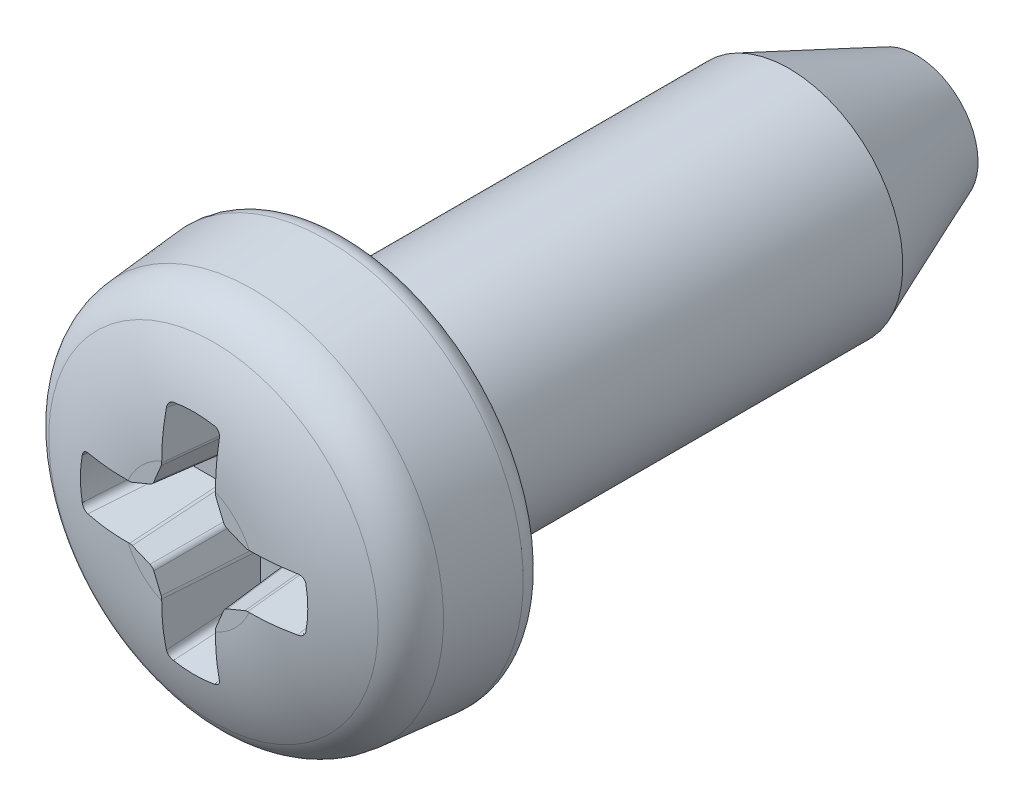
ISO-10303-21;
HEADER;
FILE_DESCRIPTION(('STEP AP214'),'2;1');
FILE_NAME('part.step','',(''),(''),'','','');
FILE_SCHEMA(('AUTOMOTIVE_DESIGN { 1 0 10303 214 1 1 1 1 }'));
ENDSEC;
DATA;
#1=APPLICATION_CONTEXT('core data for automotive mechanical design processes');
#2=APPLICATION_PROTOCOL_DEFINITION('international standard','automotive_design',2000,#1);
#3=PRODUCT_CONTEXT('',#1,'mechanical');
#4=PRODUCT('Part','Part','',(#3));
#5=PRODUCT_RELATED_PRODUCT_CATEGORY('part','',(#4));
#6=PRODUCT_DEFINITION_FORMATION('','',#4);
#7=PRODUCT_DEFINITION_CONTEXT('part definition',#1,'design');
#8=PRODUCT_DEFINITION('design','',#6,#7);
#9=PRODUCT_DEFINITION_SHAPE('','',#8);
#10=(LENGTH_UNIT() NAMED_UNIT(*) SI_UNIT(.MILLI.,.METRE.));
#11=(NAMED_UNIT(*) PLANE_ANGLE_UNIT() SI_UNIT($,.RADIAN.));
#12=(NAMED_UNIT(*) SI_UNIT($,.STERADIAN.) SOLID_ANGLE_UNIT());
#13=UNCERTAINTY_MEASURE_WITH_UNIT(LENGTH_MEASURE(1.E-05),#10,'distance_accuracy_value','');
#14=(GEOMETRIC_REPRESENTATION_CONTEXT(3) GLOBAL_UNCERTAINTY_ASSIGNED_CONTEXT((#13)) GLOBAL_UNIT_ASSIGNED_CONTEXT((#10,
#11,#12)) REPRESENTATION_CONTEXT('',''));
#15=CARTESIAN_POINT('',(0.,0.,0.));
#16=DIRECTION('',(0.,0.,1.));
#17=DIRECTION('',(1.,0.,0.));
#18=AXIS2_PLACEMENT_3D('',#15,#16,#17);
#19=CARTESIAN_POINT('',(0.,1.16666666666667,2.8));
#20=DIRECTION('',(0.,0.,-1.));
#21=DIRECTION('',(0.,1.,0.));
#22=AXIS2_PLACEMENT_3D('',#19,#20,#21);
#23=PLANE('',#22);
#24=DIRECTION('',(-1.,0.,0.));
#25=VECTOR('',#24,1.);
#26=CARTESIAN_POINT('',(1.97216727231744,-0.472481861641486,2.8));
#27=LINE('',#26,#25);
#28=CARTESIAN_POINT('',(1.0386352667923,-0.472481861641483,2.8));
#29=VERTEX_POINT('',#28);
#30=CARTESIAN_POINT('',(1.06671083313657,-0.472481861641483,2.8));
#31=VERTEX_POINT('',#30);
#32=EDGE_CURVE('E948',#29,#31,#27,.F.);
#33=ORIENTED_EDGE('',*,*,#32,.F.);
#34=CARTESIAN_POINT('',(1.03882438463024,-0.597645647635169,2.8));
#35=DIRECTION('',(0.,0.,-1.));
#36=DIRECTION('',(0.195090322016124,-0.980785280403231,0.));
#37=AXIS2_PLACEMENT_3D('',#34,#35,#36);
#38=ELLIPSE('',#37,0.125182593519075,0.1246875);
#39=CARTESIAN_POINT('',(0.991100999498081,-0.481937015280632,2.8));
#40=VERTEX_POINT('',#39);
#41=EDGE_CURVE('E1194',#29,#40,#38,.F.);
#42=ORIENTED_EDGE('',*,*,#41,.T.);
#43=DIRECTION('',(-0.923879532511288,-0.382683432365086,0.));
#44=VECTOR('',#43,1.);
#45=CARTESIAN_POINT('',(1.03965237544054,-0.461826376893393,2.8));
#46=LINE('',#45,#44);
#47=CARTESIAN_POINT('',(0.678601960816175,-0.611378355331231,2.8));
#48=VERTEX_POINT('',#47);
#49=EDGE_CURVE('E951',#48,#40,#46,.F.);
#50=ORIENTED_EDGE('',*,*,#49,.F.);
#51=CARTESIAN_POINT('',(0.726863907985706,-0.72686390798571,2.8));
#52=DIRECTION('',(0.,0.,-1.));
#53=DIRECTION('',(0.707106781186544,-0.707106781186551,0.));
#54=AXIS2_PLACEMENT_3D('',#51,#52,#53);
#55=ELLIPSE('',#54,0.125245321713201,0.1246875);
#56=CARTESIAN_POINT('',(0.611378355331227,-0.678601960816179,2.8));
#57=VERTEX_POINT('',#56);
#58=EDGE_CURVE('E1196',#48,#57,#55,.F.);
#59=ORIENTED_EDGE('',*,*,#58,.T.);
#60=DIRECTION('',(-0.382683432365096,-0.923879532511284,0.));
#61=VECTOR('',#60,1.);
#62=CARTESIAN_POINT('',(0.653256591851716,-0.577498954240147,2.8));
#63=LINE('',#62,#61);
#64=CARTESIAN_POINT('',(0.481937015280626,-0.991100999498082,2.8));
#65=VERTEX_POINT('',#64);
#66=EDGE_CURVE('E954',#65,#57,#63,.F.);
#67=ORIENTED_EDGE('',*,*,#66,.F.);
#68=CARTESIAN_POINT('',(0.597645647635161,-1.03882438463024,2.8));
#69=DIRECTION('',(0.,0.,-1.));
#70=DIRECTION('',(0.980785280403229,-0.195090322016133,0.));
#71=AXIS2_PLACEMENT_3D('',#68,#69,#70);
#72=ELLIPSE('',#71,0.125182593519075,0.1246875);
#73=CARTESIAN_POINT('',(0.472481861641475,-1.0386352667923,2.8));
#74=VERTEX_POINT('',#73);
#75=EDGE_CURVE('E1198',#65,#74,#72,.F.);
#76=ORIENTED_EDGE('',*,*,#75,.T.);
#77=DIRECTION('',(0.,-1.,0.));
#78=VECTOR('',#77,1.);
#79=CARTESIAN_POINT('',(0.472481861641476,-0.98608363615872,2.8));
#80=LINE('',#79,#78);
#81=CARTESIAN_POINT('',(0.472481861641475,-1.06671083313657,2.8));
#82=VERTEX_POINT('',#81);
#83=EDGE_CURVE('E395',#82,#74,#80,.F.);
#84=ORIENTED_EDGE('',*,*,#83,.F.);
#85=CARTESIAN_POINT('',(0.,0.,2.8));
#86=DIRECTION('',(0.,0.,1.));
#87=DIRECTION('',(0.,-1.,0.));
#88=AXIS2_PLACEMENT_3D('',#85,#86,#87);
#89=CIRCLE('',#88,1.16666666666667);
#90=EDGE_CURVE('E349',#82,#31,#89,.T.);
#91=ORIENTED_EDGE('',*,*,#90,.T.);
#92=EDGE_LOOP('',(#33,#42,#50,#59,#67,#76,#84,#91));
#93=FACE_BOUND('',#92,.T.);
#94=ADVANCED_FACE('F33',(#93),#23,.F.);
#95=DIRECTION('',(0.,1.,0.));
#96=VECTOR('',#95,1.);
#97=CARTESIAN_POINT('',(-0.472481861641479,-1.97216727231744,2.8));
#98=LINE('',#97,#96);
#99=CARTESIAN_POINT('',(-0.472481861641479,-1.0386352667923,2.8));
#100=VERTEX_POINT('',#99);
#101=CARTESIAN_POINT('',(-0.472481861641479,-1.06671083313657,2.8));
#102=VERTEX_POINT('',#101);
#103=EDGE_CURVE('E921',#100,#102,#98,.F.);
#104=ORIENTED_EDGE('',*,*,#103,.F.);
#105=CARTESIAN_POINT('',(-0.597645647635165,-1.03882438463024,2.8));
#106=DIRECTION('',(0.,0.,-1.));
#107=DIRECTION('',(-0.980785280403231,-0.195090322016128,0.));
#108=AXIS2_PLACEMENT_3D('',#105,#106,#107);
#109=ELLIPSE('',#108,0.125182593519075,0.1246875);
#110=CARTESIAN_POINT('',(-0.481937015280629,-0.991100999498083,2.8));
#111=VERTEX_POINT('',#110);
#112=EDGE_CURVE('E1002',#100,#111,#109,.F.);
#113=ORIENTED_EDGE('',*,*,#112,.T.);
#114=DIRECTION('',(-0.382683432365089,0.923879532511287,0.));
#115=VECTOR('',#114,1.);
#116=CARTESIAN_POINT('',(-0.461826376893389,-1.03965237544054,2.8));
#117=LINE('',#116,#115);
#118=CARTESIAN_POINT('',(-0.611378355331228,-0.678601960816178,2.8));
#119=VERTEX_POINT('',#118);
#120=EDGE_CURVE('E925',#119,#111,#117,.F.);
#121=ORIENTED_EDGE('',*,*,#120,.F.);
#122=CARTESIAN_POINT('',(-0.726863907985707,-0.726863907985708,2.8));
#123=DIRECTION('',(0.,0.,-1.));
#124=DIRECTION('',(-0.707106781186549,-0.707106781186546,0.));
#125=AXIS2_PLACEMENT_3D('',#122,#123,#124);
#126=ELLIPSE('',#125,0.125245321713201,0.1246875);
#127=CARTESIAN_POINT('',(-0.678601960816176,-0.61137835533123,2.8));
#128=VERTEX_POINT('',#127);
#129=EDGE_CURVE('E1000',#119,#128,#126,.F.);
#130=ORIENTED_EDGE('',*,*,#129,.T.);
#131=DIRECTION('',(-0.923879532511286,0.382683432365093,0.));
#132=VECTOR('',#131,1.);
#133=CARTESIAN_POINT('',(-0.577498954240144,-0.653256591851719,2.8));
#134=LINE('',#133,#132);
#135=CARTESIAN_POINT('',(-0.99110099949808,-0.481937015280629,2.8));
#136=VERTEX_POINT('',#135);
#137=EDGE_CURVE('E932',#136,#128,#134,.F.);
#138=ORIENTED_EDGE('',*,*,#137,.F.);
#139=CARTESIAN_POINT('',(-1.03882438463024,-0.597645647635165,2.8));
#140=DIRECTION('',(0.,0.,-1.));
#141=DIRECTION('',(-0.19509032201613,-0.98078528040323,0.));
#142=AXIS2_PLACEMENT_3D('',#139,#140,#141);
#143=ELLIPSE('',#142,0.125182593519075,0.1246875);
#144=CARTESIAN_POINT('',(-1.0386352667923,-0.472481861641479,2.8));
#145=VERTEX_POINT('',#144);
#146=EDGE_CURVE('E929',#136,#145,#143,.F.);
#147=ORIENTED_EDGE('',*,*,#146,.T.);
#148=DIRECTION('',(-1.,0.,0.));
#149=VECTOR('',#148,1.);
#150=CARTESIAN_POINT('',(-0.986083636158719,-0.472481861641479,2.8));
#151=LINE('',#150,#149);
#152=CARTESIAN_POINT('',(-1.06671083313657,-0.472481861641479,2.8));
#153=VERTEX_POINT('',#152);
#154=EDGE_CURVE('E409',#153,#145,#151,.F.);
#155=ORIENTED_EDGE('',*,*,#154,.F.);
#156=EDGE_CURVE('E353',#153,#102,#89,.T.);
#157=ORIENTED_EDGE('',*,*,#156,.T.);
#158=EDGE_LOOP('',(#104,#113,#121,#130,#138,#147,#155,#157));
#159=FACE_BOUND('',#158,.T.);
#160=ADVANCED_FACE('F871',(#159),#23,.F.);
#161=DIRECTION('',(1.,0.,0.));
#162=VECTOR('',#161,1.);
#163=CARTESIAN_POINT('',(-1.97216727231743,0.472481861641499,2.8));
#164=LINE('',#163,#162);
#165=CARTESIAN_POINT('',(-1.03863526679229,0.472481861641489,2.8));
#166=VERTEX_POINT('',#165);
#167=CARTESIAN_POINT('',(-1.06671083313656,0.47248186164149,2.8));
#168=VERTEX_POINT('',#167);
#169=EDGE_CURVE('E418',#166,#168,#164,.F.);
#170=ORIENTED_EDGE('',*,*,#169,.F.);
#171=CARTESIAN_POINT('',(-1.03882438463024,0.597645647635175,2.8));
#172=DIRECTION('',(0.,0.,-1.));
#173=DIRECTION('',(-0.195090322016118,0.980785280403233,0.));
#174=AXIS2_PLACEMENT_3D('',#171,#172,#173);
#175=ELLIPSE('',#174,0.125182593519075,0.1246875);
#176=CARTESIAN_POINT('',(-0.991100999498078,0.481937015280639,2.8));
#177=VERTEX_POINT('',#176);
#178=EDGE_CURVE('E775',#166,#177,#175,.F.);
#179=ORIENTED_EDGE('',*,*,#178,.T.);
#180=DIRECTION('',(0.923879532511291,0.38268343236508,0.));
#181=VECTOR('',#180,1.);
#182=CARTESIAN_POINT('',(-1.03965237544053,0.4618263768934,2.8));
#183=LINE('',#182,#181);
#184=CARTESIAN_POINT('',(-0.678601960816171,0.611378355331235,2.8));
#185=VERTEX_POINT('',#184);
#186=EDGE_CURVE('E423',#185,#177,#183,.F.);
#187=ORIENTED_EDGE('',*,*,#186,.F.);
#188=CARTESIAN_POINT('',(-0.7268639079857,0.726863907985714,2.8));
#189=DIRECTION('',(0.,0.,-1.));
#190=DIRECTION('',(-0.707106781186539,0.707106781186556,0.));
#191=AXIS2_PLACEMENT_3D('',#188,#189,#190);
#192=ELLIPSE('',#191,0.125245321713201,0.1246875);
#193=CARTESIAN_POINT('',(-0.611378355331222,0.678601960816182,2.8));
#194=VERTEX_POINT('',#193);
#195=EDGE_CURVE('E773',#185,#194,#192,.F.);
#196=ORIENTED_EDGE('',*,*,#195,.T.);
#197=DIRECTION('',(0.382683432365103,0.923879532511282,0.));
#198=VECTOR('',#197,1.);
#199=CARTESIAN_POINT('',(-0.653256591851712,0.577498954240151,2.8));
#200=LINE('',#199,#198);
#201=CARTESIAN_POINT('',(-0.481937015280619,0.991100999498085,2.8));
#202=VERTEX_POINT('',#201);
#203=EDGE_CURVE('E430',#202,#194,#200,.F.);
#204=ORIENTED_EDGE('',*,*,#203,.F.);
#205=CARTESIAN_POINT('',(-0.597645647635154,1.03882438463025,2.8));
#206=DIRECTION('',(0.,0.,-1.));
#207=DIRECTION('',(-0.980785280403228,0.195090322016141,0.));
#208=AXIS2_PLACEMENT_3D('',#205,#206,#207);
#209=ELLIPSE('',#208,0.125182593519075,0.1246875);
#210=CARTESIAN_POINT('',(-0.472481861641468,1.0386352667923,2.8));
#211=VERTEX_POINT('',#210);
#212=EDGE_CURVE('E770',#202,#211,#209,.F.);
#213=ORIENTED_EDGE('',*,*,#212,.T.);
#214=DIRECTION('',(0.,1.,0.));
#215=VECTOR('',#214,1.);
#216=CARTESIAN_POINT('',(-0.472481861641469,0.986083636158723,2.8));
#217=LINE('',#216,#215);
#218=CARTESIAN_POINT('',(-0.472481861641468,1.06671083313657,2.8));
#219=VERTEX_POINT('',#218);
#220=EDGE_CURVE('E444',#219,#211,#217,.F.);
#221=ORIENTED_EDGE('',*,*,#220,.F.);
#222=EDGE_CURVE('E347',#219,#168,#89,.T.);
#223=ORIENTED_EDGE('',*,*,#222,.T.);
#224=EDGE_LOOP('',(#170,#179,#187,#196,#204,#213,#221,#223));
#225=FACE_BOUND('',#224,.T.);
#226=ADVANCED_FACE('F875',(#225),#23,.F.);
#227=CARTESIAN_POINT('',(0.,0.,-10.));
#228=DIRECTION('',(0.,0.,1.));
#229=DIRECTION('',(0.,-1.,0.));
#230=AXIS2_PLACEMENT_3D('',#227,#228,#229);
#231=CONICAL_SURFACE('',#230,1.085,0.388188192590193);
#232=CARTESIAN_POINT('',(0.,0.,-7.7625));
#233=DIRECTION('',(0.,0.,1.));
#234=DIRECTION('',(0.,-1.,0.));
#235=AXIS2_PLACEMENT_3D('',#232,#233,#234);
#236=CIRCLE('',#235,2.);
#237=CARTESIAN_POINT('',(0.,-2.,-7.7625));
#238=VERTEX_POINT('',#237);
#239=EDGE_CURVE('E346',#238,#238,#236,.T.);
#240=ORIENTED_EDGE('',*,*,#239,.F.);
#241=EDGE_LOOP('',(#240));
#242=FACE_BOUND('',#241,.T.);
#243=CARTESIAN_POINT('',(0.,0.,-10.));
#244=DIRECTION('',(0.,0.,1.));
#245=DIRECTION('',(0.,-1.,0.));
#246=AXIS2_PLACEMENT_3D('',#243,#244,#245);
#247=CIRCLE('',#246,1.085);
#248=CARTESIAN_POINT('',(0.,-1.085,-10.));
#249=VERTEX_POINT('',#248);
#250=EDGE_CURVE('E328',#249,#249,#247,.T.);
#251=ORIENTED_EDGE('',*,*,#250,.T.);
#252=EDGE_LOOP('',(#251));
#253=FACE_BOUND('',#252,.T.);
#254=ADVANCED_FACE('F730',(#242,#253),#231,.T.);
#255=CARTESIAN_POINT('',(0.,0.,2.8));
#256=DIRECTION('',(0.,0.,1.));
#257=DIRECTION('',(0.,-1.,0.));
#258=AXIS2_PLACEMENT_3D('',#255,#256,#257);
#259=CYLINDRICAL_SURFACE('',#258,2.);
#260=CARTESIAN_POINT('',(0.,0.,-0.0999999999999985));
#261=DIRECTION('',(0.,0.,1.));
#262=DIRECTION('',(0.,-1.,0.));
#263=AXIS2_PLACEMENT_3D('',#260,#261,#262);
#264=CIRCLE('',#263,2.);
#265=CARTESIAN_POINT('',(0.,-2.,-0.0999999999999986));
#266=VERTEX_POINT('',#265);
#267=EDGE_CURVE('E1538',#266,#266,#264,.F.);
#268=ORIENTED_EDGE('',*,*,#267,.T.);
#269=EDGE_LOOP('',(#268));
#270=FACE_BOUND('',#269,.T.);
#271=ORIENTED_EDGE('',*,*,#239,.T.);
#272=EDGE_LOOP('',(#271));
#273=FACE_BOUND('',#272,.T.);
#274=ADVANCED_FACE('F890',(#270,#273),#259,.T.);
#275=CARTESIAN_POINT('',(0.,2.,0.));
#276=DIRECTION('',(0.,0.,1.));
#277=DIRECTION('',(0.,-1.,0.));
#278=AXIS2_PLACEMENT_3D('',#275,#276,#277);
#279=PLANE('',#278);
#280=CARTESIAN_POINT('',(0.,0.,0.));
#281=DIRECTION('',(0.,0.,1.));
#282=DIRECTION('',(0.,-1.,0.));
#283=AXIS2_PLACEMENT_3D('',#280,#281,#282);
#284=CIRCLE('',#283,3.11804202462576);
#285=CARTESIAN_POINT('',(0.,-3.11804202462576,0.));
#286=VERTEX_POINT('',#285);
#287=EDGE_CURVE('E1209',#286,#286,#284,.F.);
#288=ORIENTED_EDGE('',*,*,#287,.T.);
#289=EDGE_LOOP('',(#288));
#290=FACE_BOUND('',#289,.T.);
#291=CARTESIAN_POINT('',(0.,0.,0.));
#292=DIRECTION('',(0.,0.,1.));
#293=DIRECTION('',(0.,-1.,0.));
#294=AXIS2_PLACEMENT_3D('',#291,#292,#293);
#295=CIRCLE('',#294,2.1);
#296=CARTESIAN_POINT('',(0.,-2.1,0.));
#297=VERTEX_POINT('',#296);
#298=EDGE_CURVE('E947',#297,#297,#295,.T.);
#299=ORIENTED_EDGE('',*,*,#298,.T.);
#300=EDGE_LOOP('',(#299));
#301=FACE_BOUND('',#300,.T.);
#302=ADVANCED_FACE('F1509',(#290,#301),#279,.F.);
#303=CARTESIAN_POINT('',(0.,0.,0.));
#304=DIRECTION('',(0.,0.,-1.));
#305=DIRECTION('',(0.,1.,0.));
#306=AXIS2_PLACEMENT_3D('',#303,#304,#305);
#307=CONICAL_SURFACE('',#306,3.5,0.0872664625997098);
#308=CARTESIAN_POINT('',(0.,0.,0.380504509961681));
#309=DIRECTION('',(0.,0.,1.));
#310=DIRECTION('',(0.,-1.,0.));
#311=AXIS2_PLACEMENT_3D('',#308,#309,#310);
#312=CIRCLE('',#311,3.46671016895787);
#313=CARTESIAN_POINT('',(0.,-3.46671016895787,0.380504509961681));
#314=VERTEX_POINT('',#313);
#315=EDGE_CURVE('E1531',#314,#314,#312,.T.);
#316=ORIENTED_EDGE('',*,*,#315,.T.);
#317=EDGE_LOOP('',(#316));
#318=FACE_BOUND('',#317,.T.);
#319=CARTESIAN_POINT('',(0.,0.,1.66966935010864));
#320=DIRECTION('',(0.,0.,1.));
#321=DIRECTION('',(0.,-1.,0.));
#322=AXIS2_PLACEMENT_3D('',#319,#320,#321);
#323=CIRCLE('',#322,3.35392286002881);
#324=CARTESIAN_POINT('',(0.,-3.35392286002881,1.66966935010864));
#325=VERTEX_POINT('',#324);
#326=EDGE_CURVE('E1534',#325,#325,#323,.F.);
#327=ORIENTED_EDGE('',*,*,#326,.T.);
#328=EDGE_LOOP('',(#327));
#329=FACE_BOUND('',#328,.T.);
#330=ADVANCED_FACE('F883',(#318,#329),#307,.T.);
#331=CARTESIAN_POINT('',(0.,0.,-0.850579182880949));
#332=DIRECTION('',(0.,0.,1.));
#333=DIRECTION('',(0.,-1.,0.));
#334=AXIS2_PLACEMENT_3D('',#331,#332,#333);
#335=DEGENERATE_TOROIDAL_SURFACE('',#334,1.16666666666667,3.65057918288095,.T.);
#336=CARTESIAN_POINT('',(0.,0.,2.36387388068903));
#337=DIRECTION('',(0.,0.,-1.));
#338=DIRECTION('',(0.,1.,0.));
#339=AXIS2_PLACEMENT_3D('',#336,#337,#338);
#340=CIRCLE('',#339,2.89699029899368);
#341=CARTESIAN_POINT('',(0.,2.89699029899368,2.36387388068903));
#342=VERTEX_POINT('',#341);
#343=EDGE_CURVE('E1535',#342,#342,#340,.F.);
#344=ORIENTED_EDGE('',*,*,#343,.T.);
#345=EDGE_LOOP('',(#344));
#346=FACE_BOUND('',#345,.T.);
#347=CARTESIAN_POINT('',(1.06671083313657,0.472481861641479,2.8));
#348=CARTESIAN_POINT('',(1.11618741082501,0.472482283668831,2.80000482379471));
#349=CARTESIAN_POINT('',(1.16566177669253,0.472408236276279,2.79915845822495));
#350=CARTESIAN_POINT('',(1.26455206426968,0.472105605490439,2.79569937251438));
#351=CARTESIAN_POINT('',(1.31396798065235,0.471877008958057,2.79308650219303));
#352=CARTESIAN_POINT('',(1.46144241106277,0.470954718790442,2.78254467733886));
#353=CARTESIAN_POINT('',(1.55932246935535,0.470024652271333,2.7719139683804));
#354=CARTESIAN_POINT('',(1.75400521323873,0.467512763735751,2.74320295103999));
#355=CARTESIAN_POINT('',(1.85080753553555,0.465930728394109,2.72512020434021));
#356=CARTESIAN_POINT('',(2.0432622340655,0.462103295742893,2.68137244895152));
#357=CARTESIAN_POINT('',(2.13890461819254,0.45985408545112,2.65566385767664));
#358=CARTESIAN_POINT('',(2.23337749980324,0.457274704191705,2.62618139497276));
#359=B_SPLINE_CURVE_WITH_KNOTS('',3,(#347,#348,#349,#350,#351,#352,#353,#354,#355,#356,#357,
#358),.UNSPECIFIED.,.F.,.F.,(4,2,2,2,2,4),(0.,0.148416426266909,0.296845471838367,
0.591923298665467,0.887097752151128,1.1839927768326),.UNSPECIFIED.);
#360=CARTESIAN_POINT('',(1.06671083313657,0.472481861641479,2.8));
#361=VERTEX_POINT('',#360);
#362=CARTESIAN_POINT('',(1.8476568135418,0.465872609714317,2.72445590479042));
#363=VERTEX_POINT('',#362);
#364=EDGE_CURVE('E329',#361,#363,#359,.T.);
#365=ORIENTED_EDGE('',*,*,#364,.T.);
#366=CARTESIAN_POINT('',(2.33398069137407,0.56959052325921,4.98617788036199));
#367=CARTESIAN_POINT('',(2.31029595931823,0.663361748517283,4.98176709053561));
#368=CARTESIAN_POINT('',(2.21468843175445,0.664691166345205,4.99696240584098));
#369=CARTESIAN_POINT('',(2.25337098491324,0.524151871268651,4.4811883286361));
#370=CARTESIAN_POINT('',(2.23020335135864,0.619046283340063,4.47523900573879));
#371=CARTESIAN_POINT('',(2.13377892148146,0.620510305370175,4.49197285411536));
#372=CARTESIAN_POINT('',(2.17247456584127,0.478600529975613,3.9762469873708));
#373=CARTESIAN_POINT('',(2.14991487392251,0.574751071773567,3.96894242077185));
#374=CARTESIAN_POINT('',(2.05256134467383,0.576333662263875,3.98703151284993));
#375=CARTESIAN_POINT('',(2.00962930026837,0.387083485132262,2.96654282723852));
#376=CARTESIAN_POINT('',(1.9889556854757,0.486330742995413,2.95829343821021));
#377=CARTESIAN_POINT('',(1.88905425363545,0.487995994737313,2.97732735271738));
#378=CARTESIAN_POINT('',(1.92768046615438,0.341117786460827,2.46178000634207));
#379=CARTESIAN_POINT('',(1.90803633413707,0.442073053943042,2.45242573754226));
#380=CARTESIAN_POINT('',(1.80676475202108,0.443834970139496,2.4725645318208));
#381=CARTESIAN_POINT('',(1.76224873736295,0.248581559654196,1.45249848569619));
#382=CARTESIAN_POINT('',(1.74548901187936,0.353695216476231,1.44226243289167));
#383=CARTESIAN_POINT('',(1.64065536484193,0.355534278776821,1.46328301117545));
#384=CARTESIAN_POINT('',(1.67876582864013,0.202011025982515,0.947979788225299));
#385=CARTESIAN_POINT('',(1.66347442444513,0.309372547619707,0.935652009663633));
#386=CARTESIAN_POINT('',(1.55683546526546,0.31139461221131,0.958764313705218));
#387=CARTESIAN_POINT('',(1.55161366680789,0.131403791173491,0.191508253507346));
#388=CARTESIAN_POINT('',(1.54043177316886,0.243454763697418,0.182208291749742));
#389=CARTESIAN_POINT('',(1.42925303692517,0.245211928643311,0.202292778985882));
#390=CARTESIAN_POINT('',(1.5089080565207,0.107742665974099,-0.0605993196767));
#391=CARTESIAN_POINT('',(1.49895774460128,0.221335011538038,-0.0706216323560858));
#392=CARTESIAN_POINT('',(1.38641654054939,0.2231553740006,-0.0498147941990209));
#393=CARTESIAN_POINT('',(1.42259999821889,0.0600774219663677,-0.564672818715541));
#394=CARTESIAN_POINT('',(1.41569875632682,0.17717105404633,-0.575417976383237));
#395=CARTESIAN_POINT('',(1.29990651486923,0.1790546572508,-0.553888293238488));
#396=CARTESIAN_POINT('',(1.37899754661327,0.0360733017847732,-0.816638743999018));
#397=CARTESIAN_POINT('',(1.37378611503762,0.155062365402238,-0.82812144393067));
#398=CARTESIAN_POINT('',(1.25623298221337,0.157010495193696,-0.805854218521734));
#399=CARTESIAN_POINT('',(1.3348196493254,0.0118514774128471,-1.06851359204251));
#400=CARTESIAN_POINT('',(1.33195999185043,0.133146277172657,-1.07862347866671));
#401=CARTESIAN_POINT('',(1.21203127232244,0.134974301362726,-1.05772906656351));
#402=(BOUNDED_SURFACE() B_SPLINE_SURFACE(3,2,((#366,#367,#368),(#369,#370,#371),(#372,#373,
#374),(#375,#376,#377),(#378,#379,#380),(#381,#382,#383),(#384,#385,#386),(#387,#388,#389),
(#390,#391,#392),(#393,#394,#395),(#396,#397,#398),(#399,#400,#401)),.UNSPECIFIED.,.F.,.F.,
.F.) B_SPLINE_SURFACE_WITH_KNOTS((4,2,2,2,2,4),(3,3),(0.,1.54000576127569,3.07999341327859,
4.61999517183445,5.39000509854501,6.16001810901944),(0.,1.),
.UNSPECIFIED.) GEOMETRIC_REPRESENTATION_ITEM() RATIONAL_B_SPLINE_SURFACE(((1.,0.78985085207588,
1.),(1.,0.786662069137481,1.),(1.,0.783173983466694,1.),(1.,0.77502723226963,1.),(1.,
0.770368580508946,1.),(1.,0.759308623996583,1.),(1.,0.752907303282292,1.),(1.,0.741045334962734,
1.),(1.,0.736714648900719,1.),(1.,0.726983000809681,1.),(1.,0.721582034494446,1.),(1.,
0.715487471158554,1.))) REPRESENTATION_ITEM('') SURFACE());
#403=CARTESIAN_POINT('',(1.84765681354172,0.465872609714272,2.7244559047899));
#404=CARTESIAN_POINT('',(1.85454430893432,0.465760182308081,2.72308180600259));
#405=CARTESIAN_POINT('',(1.861420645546,0.465040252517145,2.72171997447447));
#406=CARTESIAN_POINT('',(1.87495963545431,0.462438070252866,2.71906282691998));
#407=CARTESIAN_POINT('',(1.88162239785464,0.46055642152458,2.71776747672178));
#408=CARTESIAN_POINT('',(1.89455267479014,0.455682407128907,2.71528332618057));
#409=CARTESIAN_POINT('',(1.90082005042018,0.452689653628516,2.7140945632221));
#410=CARTESIAN_POINT('',(1.91277540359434,0.445675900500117,2.71186478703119));
#411=CARTESIAN_POINT('',(1.91846360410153,0.441655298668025,2.71082371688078));
#412=CARTESIAN_POINT('',(1.92912211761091,0.432699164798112,2.70891976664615));
#413=CARTESIAN_POINT('',(1.93409095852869,0.427761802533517,2.70805725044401));
#414=CARTESIAN_POINT('',(1.94315054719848,0.417106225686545,2.70654472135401));
#415=CARTESIAN_POINT('',(1.94724084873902,0.411387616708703,2.70589481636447));
#416=CARTESIAN_POINT('',(1.9547095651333,0.398878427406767,2.70478761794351));
#417=CARTESIAN_POINT('',(1.95800975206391,0.392039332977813,2.70434882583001));
#418=CARTESIAN_POINT('',(1.96335885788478,0.377867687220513,2.70375956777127));
#419=CARTESIAN_POINT('',(1.96540622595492,0.370534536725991,2.70360945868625));
#420=CARTESIAN_POINT('',(1.96676879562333,0.363070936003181,2.70361326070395));
#421=B_SPLINE_CURVE_WITH_KNOTS('',3,(#403,#404,#405,#406,#407,#408,#409,#410,#411,#412,#413,
#414,#415,#416,#417,#418,#419,#420),.UNSPECIFIED.,.F.,.F.,(4,2,2,2,2,2,2,2,4),(0.,
0.0210419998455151,0.0420730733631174,0.063111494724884,0.0841417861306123,0.105214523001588,
0.126297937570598,0.148991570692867,0.171713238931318),.UNSPECIFIED.);
#422=CARTESIAN_POINT('',(1.96676879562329,0.363070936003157,2.70361326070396));
#423=VERTEX_POINT('',#422);
#424=EDGE_CURVE('E11',#363,#423,#421,.T.);
#425=ORIENTED_EDGE('',*,*,#424,.T.);
#426=CARTESIAN_POINT('',(0.,0.,2.70361326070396));
#427=DIRECTION('',(0.,0.,-1.));
#428=DIRECTION('',(0.,1.,0.));
#429=AXIS2_PLACEMENT_3D('',#426,#427,#428);
#430=CIRCLE('',#429,2.00000000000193);
#431=CARTESIAN_POINT('',(1.96676879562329,-0.363070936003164,2.70361326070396));
#432=VERTEX_POINT('',#431);
#433=EDGE_CURVE('E564',#423,#432,#430,.T.);
#434=ORIENTED_EDGE('',*,*,#433,.T.);
#435=CARTESIAN_POINT('',(2.21468848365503,-0.664691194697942,4.99696272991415));
#436=CARTESIAN_POINT('',(2.31029601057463,-0.663361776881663,4.98176741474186));
#437=CARTESIAN_POINT('',(2.33398074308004,-0.569590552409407,4.98617820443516));
#438=CARTESIAN_POINT('',(2.13377897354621,-0.620510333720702,4.49197317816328));
#439=CARTESIAN_POINT('',(2.23020340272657,-0.619046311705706,4.47523932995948));
#440=CARTESIAN_POINT('',(2.25337103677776,-0.524151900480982,4.48118865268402));
#441=CARTESIAN_POINT('',(2.05256139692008,-0.576333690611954,3.98703183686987));
#442=CARTESIAN_POINT('',(2.14991492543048,-0.574751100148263,3.96894274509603));
#443=CARTESIAN_POINT('',(2.17247461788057,-0.478600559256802,3.97624731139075));
#444=CARTESIAN_POINT('',(1.88905430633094,-0.487996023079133,2.97732767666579));
#445=CARTESIAN_POINT('',(1.9889557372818,-0.486330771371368,2.95829376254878));
#446=CARTESIAN_POINT('',(2.00962935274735,-0.387083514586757,2.96654315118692));
#447=CARTESIAN_POINT('',(1.80676480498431,-0.443834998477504,2.47256485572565));
#448=CARTESIAN_POINT('',(1.90803638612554,-0.442073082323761,2.45242606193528));
#449=CARTESIAN_POINT('',(1.92768051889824,-0.341117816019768,2.46178033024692));
#450=CARTESIAN_POINT('',(1.64065541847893,-0.355534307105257,1.46328333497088));
#451=CARTESIAN_POINT('',(1.74548906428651,-0.353695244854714,1.44226275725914));
#452=CARTESIAN_POINT('',(1.76224879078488,-0.24858158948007,1.45249880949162));
#453=CARTESIAN_POINT('',(1.55683551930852,-0.311394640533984,0.958764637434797));
#454=CARTESIAN_POINT('',(1.66347447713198,-0.309372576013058,0.935652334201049));
#455=CARTESIAN_POINT('',(1.67876588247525,-0.202011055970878,0.947980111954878));
#456=CARTESIAN_POINT('',(1.4292530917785,-0.245211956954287,0.202293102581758));
#457=CARTESIAN_POINT('',(1.54043182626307,-0.24345479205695,0.182208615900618));
#458=CARTESIAN_POINT('',(1.55161372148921,-0.131403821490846,0.191508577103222));
#459=CARTESIAN_POINT('',(1.38641659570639,-0.223155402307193,-0.0498144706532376));
#460=CARTESIAN_POINT('',(1.49895779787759,-0.221335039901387,-0.0706213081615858));
#461=CARTESIAN_POINT('',(1.50890811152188,-0.107742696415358,-0.0605989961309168));
#462=CARTESIAN_POINT('',(1.29990657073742,-0.179054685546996,-0.553887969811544));
#463=CARTESIAN_POINT('',(1.41569880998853,-0.177171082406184,-0.575417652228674));
#464=CARTESIAN_POINT('',(1.4226000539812,-0.0600774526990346,-0.564672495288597));
#465=CARTESIAN_POINT('',(1.25623303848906,-0.157010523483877,-0.805853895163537));
#466=CARTESIAN_POINT('',(1.37378616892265,-0.155062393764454,-0.828121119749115));
#467=CARTESIAN_POINT('',(1.37899760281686,-0.0360733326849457,-0.81663842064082));
#468=CARTESIAN_POINT('',(1.21203132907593,-0.134974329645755,-1.05772874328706));
#469=CARTESIAN_POINT('',(1.33196004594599,-0.133146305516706,-1.0786231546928));
#470=CARTESIAN_POINT('',(1.33481970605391,-0.0118515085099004,-1.06851326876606));
#471=(BOUNDED_SURFACE() B_SPLINE_SURFACE(3,2,((#435,#436,#437),(#438,#439,#440),(#441,#442,
#443),(#444,#445,#446),(#447,#448,#449),(#450,#451,#452),(#453,#454,#455),(#456,#457,#458),
(#459,#460,#461),(#462,#463,#464),(#465,#466,#467),(#468,#469,#470)),.UNSPECIFIED.,.F.,.F.,
.F.) B_SPLINE_SURFACE_WITH_KNOTS((4,2,2,2,2,4),(3,3),(0.,1.54000576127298,3.07999341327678,
4.61999517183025,5.3900050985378,6.16001810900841),(0.,1.),
.UNSPECIFIED.) GEOMETRIC_REPRESENTATION_ITEM() RATIONAL_B_SPLINE_SURFACE(((1.,0.789850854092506,
1.),(1.,0.786662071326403,1.),(1.,0.78317398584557,1.),(1.,0.775027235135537,1.),(1.,
0.770368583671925,1.),(1.,0.759308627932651,1.),(1.,0.752907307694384,1.),(1.,0.741045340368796,
1.),(1.,0.73671465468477,1.),(1.,0.726983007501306,1.),(1.,0.721582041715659,1.),(1.,
0.715487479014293,1.))) REPRESENTATION_ITEM('') SURFACE());
#472=CARTESIAN_POINT('',(1.96676879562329,-0.363070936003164,2.70361326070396));
#473=CARTESIAN_POINT('',(1.96550290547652,-0.369997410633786,2.70361009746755));
#474=CARTESIAN_POINT('',(1.9636487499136,-0.376811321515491,2.70373909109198));
#475=CARTESIAN_POINT('',(1.95885202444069,-0.39003192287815,2.70424718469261));
#476=CARTESIAN_POINT('',(1.95590994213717,-0.396438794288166,2.70462617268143));
#477=CARTESIAN_POINT('',(1.94902292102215,-0.408672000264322,2.70562025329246));
#478=CARTESIAN_POINT('',(1.94507761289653,-0.414498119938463,2.70623543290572));
#479=CARTESIAN_POINT('',(1.9362873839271,-0.425391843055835,2.7076827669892));
#480=CARTESIAN_POINT('',(1.93144282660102,-0.430459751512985,2.70851483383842));
#481=CARTESIAN_POINT('',(1.92099449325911,-0.439709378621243,2.71036560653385));
#482=CARTESIAN_POINT('',(1.9153900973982,-0.443890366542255,2.71138446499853));
#483=CARTESIAN_POINT('',(1.90357319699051,-0.451234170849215,2.71357639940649));
#484=CARTESIAN_POINT('',(1.89736040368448,-0.454396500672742,2.71474954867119));
#485=CARTESIAN_POINT('',(1.88406057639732,-0.459794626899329,2.71729514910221));
#486=CARTESIAN_POINT('',(1.87694279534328,-0.461951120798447,2.71867577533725));
#487=CARTESIAN_POINT('',(1.86244002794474,-0.46493153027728,2.72151814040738));
#488=CARTESIAN_POINT('',(1.85505471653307,-0.46575376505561,2.72297997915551));
#489=CARTESIAN_POINT('',(1.8476568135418,-0.465872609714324,2.72445590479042));
#490=B_SPLINE_CURVE_WITH_KNOTS('',3,(#472,#473,#474,#475,#476,#477,#478,#479,#480,#481,#482,
#483,#484,#485,#486,#487,#488,#489),.UNSPECIFIED.,.F.,.F.,(4,2,2,2,2,2,2,2,4),(0.,
0.0210906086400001,0.0421717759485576,0.0632607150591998,0.0843411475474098,0.105438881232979,
0.126546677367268,0.14911580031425,0.17171333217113),.UNSPECIFIED.);
#491=CARTESIAN_POINT('',(1.8476568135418,-0.465872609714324,2.72445590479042));
#492=VERTEX_POINT('',#491);
#493=EDGE_CURVE('E54',#432,#492,#490,.T.);
#494=ORIENTED_EDGE('',*,*,#493,.T.);
#495=CARTESIAN_POINT('',(1.94541985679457,-0.464049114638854,2.70361326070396));
#496=CARTESIAN_POINT('',(1.8901287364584,-0.465147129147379,2.7161636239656));
#497=CARTESIAN_POINT('',(1.83456411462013,-0.466136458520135,2.72747171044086));
#498=CARTESIAN_POINT('',(1.72298472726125,-0.467898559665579,2.74761261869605));
#499=CARTESIAN_POINT('',(1.66696996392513,-0.468671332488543,2.75644545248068));
#500=CARTESIAN_POINT('',(1.49915358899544,-0.470657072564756,2.77914256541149));
#501=CARTESIAN_POINT('',(1.38683076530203,-0.471552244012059,2.78937442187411));
#502=CARTESIAN_POINT('',(1.21812932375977,-0.472281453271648,2.79770932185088));
#503=CARTESIAN_POINT('',(1.16189083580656,-0.472422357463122,2.79931986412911));
#504=CARTESIAN_POINT('',(1.04938247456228,-0.472510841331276,2.80033123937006));
#505=CARTESIAN_POINT('',(0.993112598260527,-0.472458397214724,2.79973180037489));
#506=CARTESIAN_POINT('',(0.880266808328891,-0.472173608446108,2.79647664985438));
#507=CARTESIAN_POINT('',(0.823691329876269,-0.471940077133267,2.79380737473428));
#508=CARTESIAN_POINT('',(0.71066562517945,-0.471324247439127,2.78676840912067));
#509=CARTESIAN_POINT('',(0.65421536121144,-0.470942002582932,2.7823993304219));
#510=CARTESIAN_POINT('',(0.597836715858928,-0.470501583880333,2.77736532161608));
#511=B_SPLINE_CURVE_WITH_KNOTS('',3,(#495,#496,#497,#498,#499,#500,#501,#502,#503,#504,#505,
#506,#507,#508,#509,#510),.UNSPECIFIED.,.F.,.F.,(4,2,2,2,2,2,2,4),(0.,0.17009035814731,
0.340179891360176,0.678062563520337,0.846815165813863,1.01558853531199,1.18547731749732,
1.35530500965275),.UNSPECIFIED.);
#512=EDGE_CURVE('E911',#492,#31,#511,.T.);
#513=ORIENTED_EDGE('',*,*,#512,.T.);
#514=ORIENTED_EDGE('',*,*,#90,.F.);
#515=CARTESIAN_POINT('',(0.472481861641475,-1.06671083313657,2.8));
#516=CARTESIAN_POINT('',(0.472482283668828,-1.11618741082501,2.80000482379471));
#517=CARTESIAN_POINT('',(0.472408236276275,-1.16566177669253,2.79915845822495));
#518=CARTESIAN_POINT('',(0.472105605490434,-1.26455206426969,2.79569937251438));
#519=CARTESIAN_POINT('',(0.471877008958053,-1.31396798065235,2.79308650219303));
#520=CARTESIAN_POINT('',(0.470954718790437,-1.46144241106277,2.78254467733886));
#521=CARTESIAN_POINT('',(0.470024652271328,-1.55932246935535,2.7719139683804));
#522=CARTESIAN_POINT('',(0.467512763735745,-1.75400521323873,2.74320295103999));
#523=CARTESIAN_POINT('',(0.465930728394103,-1.85080753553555,2.72512020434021));
#524=CARTESIAN_POINT('',(0.462103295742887,-2.0432622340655,2.68137244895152));
#525=CARTESIAN_POINT('',(0.459854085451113,-2.13890461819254,2.65566385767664));
#526=CARTESIAN_POINT('',(0.457274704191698,-2.23337749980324,2.62618139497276));
#527=B_SPLINE_CURVE_WITH_KNOTS('',3,(#515,#516,#517,#518,#519,#520,#521,#522,#523,#524,#525,
#526),.UNSPECIFIED.,.F.,.F.,(4,2,2,2,2,4),(0.,0.148416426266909,0.296845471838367,
0.591923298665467,0.887097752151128,1.1839927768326),.UNSPECIFIED.);
#528=CARTESIAN_POINT('',(0.465872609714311,-1.8476568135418,2.72445590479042));
#529=VERTEX_POINT('',#528);
#530=EDGE_CURVE('E908',#82,#529,#527,.T.);
#531=ORIENTED_EDGE('',*,*,#530,.T.);
#532=CARTESIAN_POINT('',(0.569590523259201,-2.33398069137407,4.98617788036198));
#533=CARTESIAN_POINT('',(0.663361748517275,-2.31029595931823,4.9817670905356));
#534=CARTESIAN_POINT('',(0.664691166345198,-2.21468843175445,4.99696240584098));
#535=CARTESIAN_POINT('',(0.524151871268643,-2.25337098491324,4.4811883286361));
#536=CARTESIAN_POINT('',(0.619046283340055,-2.23020335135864,4.47523900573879));
#537=CARTESIAN_POINT('',(0.620510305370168,-2.13377892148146,4.49197285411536));
#538=CARTESIAN_POINT('',(0.478600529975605,-2.17247456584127,3.9762469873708));
#539=CARTESIAN_POINT('',(0.574751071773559,-2.14991487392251,3.96894242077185));
#540=CARTESIAN_POINT('',(0.576333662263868,-2.05256134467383,3.98703151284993));
#541=CARTESIAN_POINT('',(0.387083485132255,-2.00962930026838,2.96654282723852));
#542=CARTESIAN_POINT('',(0.486330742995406,-1.9889556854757,2.95829343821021));
#543=CARTESIAN_POINT('',(0.487995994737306,-1.88905425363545,2.97732735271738));
#544=CARTESIAN_POINT('',(0.34111778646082,-1.92768046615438,2.46178000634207));
#545=CARTESIAN_POINT('',(0.442073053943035,-1.90803633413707,2.45242573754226));
#546=CARTESIAN_POINT('',(0.443834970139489,-1.80676475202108,2.4725645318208));
#547=CARTESIAN_POINT('',(0.248581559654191,-1.76224873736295,1.45249848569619));
#548=CARTESIAN_POINT('',(0.353695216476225,-1.74548901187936,1.44226243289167));
#549=CARTESIAN_POINT('',(0.355534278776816,-1.64065536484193,1.46328301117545));
#550=CARTESIAN_POINT('',(0.20201102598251,-1.67876582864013,0.947979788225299));
#551=CARTESIAN_POINT('',(0.309372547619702,-1.66347442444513,0.935652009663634));
#552=CARTESIAN_POINT('',(0.311394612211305,-1.55683546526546,0.958764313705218));
#553=CARTESIAN_POINT('',(0.131403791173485,-1.55161366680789,0.191508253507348));
#554=CARTESIAN_POINT('',(0.243454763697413,-1.54043177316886,0.182208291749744));
#555=CARTESIAN_POINT('',(0.245211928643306,-1.42925303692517,0.202292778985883));
#556=CARTESIAN_POINT('',(0.107742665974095,-1.5089080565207,-0.060599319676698));
#557=CARTESIAN_POINT('',(0.221335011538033,-1.49895774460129,-0.0706216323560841));
#558=CARTESIAN_POINT('',(0.223155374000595,-1.38641654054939,-0.0498147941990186));
#559=CARTESIAN_POINT('',(0.0600774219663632,-1.42259999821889,-0.564672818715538));
#560=CARTESIAN_POINT('',(0.177171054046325,-1.41569875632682,-0.575417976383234));
#561=CARTESIAN_POINT('',(0.179054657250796,-1.29990651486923,-0.553888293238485));
#562=CARTESIAN_POINT('',(0.0360733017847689,-1.37899754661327,-0.816638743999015));
#563=CARTESIAN_POINT('',(0.155062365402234,-1.37378611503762,-0.828121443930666));
#564=CARTESIAN_POINT('',(0.157010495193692,-1.25623298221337,-0.805854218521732));
#565=CARTESIAN_POINT('',(0.011851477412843,-1.33481964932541,-1.0685135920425));
#566=CARTESIAN_POINT('',(0.133146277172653,-1.33195999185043,-1.07862347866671));
#567=CARTESIAN_POINT('',(0.134974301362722,-1.21203127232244,-1.05772906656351));
#568=(BOUNDED_SURFACE() B_SPLINE_SURFACE(3,2,((#532,#533,#534),(#535,#536,#537),(#538,#539,
#540),(#541,#542,#543),(#544,#545,#546),(#547,#548,#549),(#550,#551,#552),(#553,#554,#555),
(#556,#557,#558),(#559,#560,#561),(#562,#563,#564),(#565,#566,#567)),.UNSPECIFIED.,.F.,.F.,
.F.) B_SPLINE_SURFACE_WITH_KNOTS((4,2,2,2,2,4),(3,3),(0.,1.54000576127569,3.07999341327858,
4.61999517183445,5.390005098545,6.16001810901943),(0.,1.),
.UNSPECIFIED.) GEOMETRIC_REPRESENTATION_ITEM() RATIONAL_B_SPLINE_SURFACE(((1.,0.78985085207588,
1.),(1.,0.786662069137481,1.),(1.,0.783173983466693,1.),(1.,0.775027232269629,1.),(1.,
0.770368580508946,1.),(1.,0.759308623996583,1.),(1.,0.752907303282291,1.),(1.,0.741045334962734,
1.),(1.,0.736714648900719,1.),(1.,0.726983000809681,1.),(1.,0.721582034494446,1.),(1.,
0.715487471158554,1.))) REPRESENTATION_ITEM('') SURFACE());
#569=CARTESIAN_POINT('',(0.465872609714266,-1.84765681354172,2.7244559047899));
#570=CARTESIAN_POINT('',(0.465760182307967,-1.85454430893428,2.72308180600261));
#571=CARTESIAN_POINT('',(0.46504025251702,-1.86142064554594,2.72171997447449));
#572=CARTESIAN_POINT('',(0.462438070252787,-1.87495963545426,2.71906282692));
#573=CARTESIAN_POINT('',(0.460556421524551,-1.88162239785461,2.71776747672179));
#574=CARTESIAN_POINT('',(0.455682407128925,-1.89455267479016,2.71528332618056));
#575=CARTESIAN_POINT('',(0.452689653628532,-1.90082005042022,2.7140945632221));
#576=CARTESIAN_POINT('',(0.44567590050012,-1.91277540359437,2.71186478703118));
#577=CARTESIAN_POINT('',(0.44165529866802,-1.91846360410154,2.71082371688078));
#578=CARTESIAN_POINT('',(0.432699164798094,-1.92912211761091,2.70891976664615));
#579=CARTESIAN_POINT('',(0.427761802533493,-1.93409095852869,2.70805725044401));
#580=CARTESIAN_POINT('',(0.417106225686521,-1.94315054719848,2.70654472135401));
#581=CARTESIAN_POINT('',(0.411387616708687,-1.94724084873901,2.70589481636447));
#582=CARTESIAN_POINT('',(0.398878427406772,-1.95470956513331,2.70478761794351));
#583=CARTESIAN_POINT('',(0.392039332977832,-1.95800975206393,2.70434882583));
#584=CARTESIAN_POINT('',(0.377867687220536,-1.96335885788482,2.70375956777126));
#585=CARTESIAN_POINT('',(0.370534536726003,-1.96540622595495,2.70360945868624));
#586=CARTESIAN_POINT('',(0.363070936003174,-1.96676879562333,2.70361326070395));
#587=B_SPLINE_CURVE_WITH_KNOTS('',3,(#569,#570,#571,#572,#573,#574,#575,#576,#577,#578,#579,
#580,#581,#582,#583,#584,#585,#586),.UNSPECIFIED.,.F.,.F.,(4,2,2,2,2,2,2,2,4),(0.,
0.0210419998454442,0.0420730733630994,0.0631114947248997,0.0841417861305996,0.105214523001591,
0.126297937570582,0.14899157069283,0.171713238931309),.UNSPECIFIED.);
#588=CARTESIAN_POINT('',(0.36307093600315,-1.96676879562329,2.70361326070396));
#589=VERTEX_POINT('',#588);
#590=EDGE_CURVE('E1115',#529,#589,#587,.T.);
#591=ORIENTED_EDGE('',*,*,#590,.T.);
#592=CARTESIAN_POINT('',(0.,0.,2.70361326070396));
#593=DIRECTION('',(0.,0.,-1.));
#594=DIRECTION('',(0.,1.,0.));
#595=AXIS2_PLACEMENT_3D('',#592,#593,#594);
#596=CIRCLE('',#595,2.00000000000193);
#597=CARTESIAN_POINT('',(-0.363070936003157,-1.96676879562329,2.70361326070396));
#598=VERTEX_POINT('',#597);
#599=EDGE_CURVE('E906',#589,#598,#596,.T.);
#600=ORIENTED_EDGE('',*,*,#599,.T.);
#601=CARTESIAN_POINT('',(-0.664691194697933,-2.21468848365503,4.99696272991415));
#602=CARTESIAN_POINT('',(-0.663361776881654,-2.31029601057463,4.98176741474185));
#603=CARTESIAN_POINT('',(-0.569590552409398,-2.33398074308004,4.98617820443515));
#604=CARTESIAN_POINT('',(-0.620510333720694,-2.13377897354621,4.49197317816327));
#605=CARTESIAN_POINT('',(-0.619046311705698,-2.23020340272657,4.47523932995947));
#606=CARTESIAN_POINT('',(-0.524151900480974,-2.25337103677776,4.48118865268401));
#607=CARTESIAN_POINT('',(-0.576333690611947,-2.05256139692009,3.98703183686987));
#608=CARTESIAN_POINT('',(-0.574751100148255,-2.14991492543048,3.96894274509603));
#609=CARTESIAN_POINT('',(-0.478600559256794,-2.17247461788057,3.97624731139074));
#610=CARTESIAN_POINT('',(-0.487996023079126,-1.88905430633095,2.97732767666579));
#611=CARTESIAN_POINT('',(-0.486330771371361,-1.9889557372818,2.95829376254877));
#612=CARTESIAN_POINT('',(-0.38708351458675,-2.00962935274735,2.96654315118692));
#613=CARTESIAN_POINT('',(-0.443834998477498,-1.80676480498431,2.47256485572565));
#614=CARTESIAN_POINT('',(-0.442073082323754,-1.90803638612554,2.45242606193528));
#615=CARTESIAN_POINT('',(-0.341117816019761,-1.92768051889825,2.46178033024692));
#616=CARTESIAN_POINT('',(-0.355534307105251,-1.64065541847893,1.46328333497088));
#617=CARTESIAN_POINT('',(-0.353695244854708,-1.74548906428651,1.44226275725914));
#618=CARTESIAN_POINT('',(-0.248581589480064,-1.76224879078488,1.45249880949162));
#619=CARTESIAN_POINT('',(-0.311394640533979,-1.55683551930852,0.958764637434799));
#620=CARTESIAN_POINT('',(-0.309372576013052,-1.66347447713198,0.935652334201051));
#621=CARTESIAN_POINT('',(-0.202011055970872,-1.67876588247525,0.94798011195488));
#622=CARTESIAN_POINT('',(-0.245211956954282,-1.4292530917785,0.202293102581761));
#623=CARTESIAN_POINT('',(-0.243454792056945,-1.54043182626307,0.182208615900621));
#624=CARTESIAN_POINT('',(-0.13140382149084,-1.55161372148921,0.191508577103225));
#625=CARTESIAN_POINT('',(-0.223155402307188,-1.38641659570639,-0.0498144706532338));
#626=CARTESIAN_POINT('',(-0.221335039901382,-1.49895779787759,-0.0706213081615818));
#627=CARTESIAN_POINT('',(-0.107742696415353,-1.50890811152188,-0.0605989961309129));
#628=CARTESIAN_POINT('',(-0.179054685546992,-1.29990657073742,-0.553887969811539));
#629=CARTESIAN_POINT('',(-0.17717108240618,-1.41569880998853,-0.57541765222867));
#630=CARTESIAN_POINT('',(-0.0600774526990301,-1.4226000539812,-0.564672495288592));
#631=CARTESIAN_POINT('',(-0.157010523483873,-1.25623303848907,-0.805853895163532));
#632=CARTESIAN_POINT('',(-0.15506239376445,-1.37378616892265,-0.828121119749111));
#633=CARTESIAN_POINT('',(-0.0360733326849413,-1.37899760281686,-0.816638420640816));
#634=CARTESIAN_POINT('',(-0.134974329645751,-1.21203132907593,-1.05772874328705));
#635=CARTESIAN_POINT('',(-0.133146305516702,-1.33196004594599,-1.0786231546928));
#636=CARTESIAN_POINT('',(-0.0118515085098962,-1.33481970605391,-1.06851326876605));
#637=(BOUNDED_SURFACE() B_SPLINE_SURFACE(3,2,((#601,#602,#603),(#604,#605,#606),(#607,#608,
#609),(#610,#611,#612),(#613,#614,#615),(#616,#617,#618),(#619,#620,#621),(#622,#623,#624),
(#625,#626,#627),(#628,#629,#630),(#631,#632,#633),(#634,#635,#636)),.UNSPECIFIED.,.F.,.F.,
.F.) B_SPLINE_SURFACE_WITH_KNOTS((4,2,2,2,2,4),(3,3),(0.,1.54000576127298,3.07999341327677,
4.61999517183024,5.39000509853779,6.1600181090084),(0.,1.),
.UNSPECIFIED.) GEOMETRIC_REPRESENTATION_ITEM() RATIONAL_B_SPLINE_SURFACE(((1.,0.789850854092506,
1.),(1.,0.786662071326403,1.),(1.,0.783173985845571,1.),(1.,0.775027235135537,1.),(1.,
0.770368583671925,1.),(1.,0.759308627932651,1.),(1.,0.752907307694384,1.),(1.,0.741045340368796,
1.),(1.,0.73671465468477,1.),(1.,0.726983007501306,1.),(1.,0.721582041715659,1.),(1.,
0.715487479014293,1.))) REPRESENTATION_ITEM('') SURFACE());
#638=CARTESIAN_POINT('',(-0.363070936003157,-1.96676879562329,2.70361326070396));
#639=CARTESIAN_POINT('',(-0.369997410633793,-1.96550290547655,2.70361009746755));
#640=CARTESIAN_POINT('',(-0.376811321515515,-1.96364874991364,2.70373909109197));
#641=CARTESIAN_POINT('',(-0.39003192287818,-1.95885202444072,2.7042471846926));
#642=CARTESIAN_POINT('',(-0.396438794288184,-1.95590994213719,2.70462617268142));
#643=CARTESIAN_POINT('',(-0.408672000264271,-1.94902292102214,2.70562025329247));
#644=CARTESIAN_POINT('',(-0.414498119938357,-1.94507761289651,2.70623543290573));
#645=CARTESIAN_POINT('',(-0.42539184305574,-1.93628738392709,2.7076827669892));
#646=CARTESIAN_POINT('',(-0.430459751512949,-1.93144282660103,2.70851483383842));
#647=CARTESIAN_POINT('',(-0.439709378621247,-1.92099449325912,2.71036560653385));
#648=CARTESIAN_POINT('',(-0.443890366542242,-1.9153900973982,2.71138446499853));
#649=CARTESIAN_POINT('',(-0.451234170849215,-1.90357319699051,2.71357639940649));
#650=CARTESIAN_POINT('',(-0.454396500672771,-1.89736040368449,2.71474954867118));
#651=CARTESIAN_POINT('',(-0.459794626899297,-1.88406057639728,2.71729514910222));
#652=CARTESIAN_POINT('',(-0.461951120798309,-1.87694279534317,2.71867577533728));
#653=CARTESIAN_POINT('',(-0.46493153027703,-1.86244002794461,2.72151814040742));
#654=CARTESIAN_POINT('',(-0.465753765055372,-1.85505471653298,2.72297997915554));
#655=CARTESIAN_POINT('',(-0.465872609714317,-1.84765681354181,2.72445590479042));
#656=B_SPLINE_CURVE_WITH_KNOTS('',3,(#638,#639,#640,#641,#642,#643,#644,#645,#646,#647,#648,
#649,#650,#651,#652,#653,#654,#655),.UNSPECIFIED.,.F.,.F.,(4,2,2,2,2,2,2,2,4),(0.,
0.0210906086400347,0.0421717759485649,0.0632607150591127,0.0843411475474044,0.105438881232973,
0.126546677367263,0.149115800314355,0.171713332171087),.UNSPECIFIED.);
#657=CARTESIAN_POINT('',(-0.465872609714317,-1.84765681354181,2.72445590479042));
#658=VERTEX_POINT('',#657);
#659=EDGE_CURVE('E916',#598,#658,#656,.T.);
#660=ORIENTED_EDGE('',*,*,#659,.T.);
#661=CARTESIAN_POINT('',(-0.464049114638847,-1.94541985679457,2.70361326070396));
#662=CARTESIAN_POINT('',(-0.465147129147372,-1.8901287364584,2.7161636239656));
#663=CARTESIAN_POINT('',(-0.466136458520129,-1.83456411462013,2.72747171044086));
#664=CARTESIAN_POINT('',(-0.467898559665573,-1.72298472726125,2.74761261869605));
#665=CARTESIAN_POINT('',(-0.468671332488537,-1.66696996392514,2.75644545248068));
#666=CARTESIAN_POINT('',(-0.47065707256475,-1.49915358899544,2.77914256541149));
#667=CARTESIAN_POINT('',(-0.471552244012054,-1.38683076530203,2.78937442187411));
#668=CARTESIAN_POINT('',(-0.472281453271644,-1.21812932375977,2.79770932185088));
#669=CARTESIAN_POINT('',(-0.472422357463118,-1.16189083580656,2.79931986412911));
#670=CARTESIAN_POINT('',(-0.472510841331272,-1.04938247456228,2.80033123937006));
#671=CARTESIAN_POINT('',(-0.47245839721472,-0.993112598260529,2.79973180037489));
#672=CARTESIAN_POINT('',(-0.472173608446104,-0.880266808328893,2.79647664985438));
#673=CARTESIAN_POINT('',(-0.471940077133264,-0.823691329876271,2.79380737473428));
#674=CARTESIAN_POINT('',(-0.471324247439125,-0.710665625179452,2.78676840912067));
#675=CARTESIAN_POINT('',(-0.47094200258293,-0.654215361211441,2.7823993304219));
#676=CARTESIAN_POINT('',(-0.470501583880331,-0.597836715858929,2.77736532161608));
#677=B_SPLINE_CURVE_WITH_KNOTS('',3,(#661,#662,#663,#664,#665,#666,#667,#668,#669,#670,#671,
#672,#673,#674,#675,#676),.UNSPECIFIED.,.F.,.F.,(4,2,2,2,2,2,2,4),(0.,0.17009035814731,
0.340179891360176,0.678062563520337,0.846815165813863,1.01558853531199,1.18547731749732,
1.35530500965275),.UNSPECIFIED.);
#678=EDGE_CURVE('E456',#658,#102,#677,.T.);
#679=ORIENTED_EDGE('',*,*,#678,.T.);
#680=ORIENTED_EDGE('',*,*,#156,.F.);
#681=CARTESIAN_POINT('',(-1.06671083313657,-0.472481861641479,2.8));
#682=CARTESIAN_POINT('',(-1.11618741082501,-0.472482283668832,2.80000482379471));
#683=CARTESIAN_POINT('',(-1.16566177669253,-0.472408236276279,2.79915845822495));
#684=CARTESIAN_POINT('',(-1.26455206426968,-0.472105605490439,2.79569937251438));
#685=CARTESIAN_POINT('',(-1.31396798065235,-0.471877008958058,2.79308650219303));
#686=CARTESIAN_POINT('',(-1.46144241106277,-0.470954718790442,2.78254467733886));
#687=CARTESIAN_POINT('',(-1.55932246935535,-0.470024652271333,2.7719139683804));
#688=CARTESIAN_POINT('',(-1.75400521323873,-0.467512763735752,2.74320295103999));
#689=CARTESIAN_POINT('',(-1.85080753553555,-0.46593072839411,2.72512020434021));
#690=CARTESIAN_POINT('',(-2.0432622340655,-0.462103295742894,2.68137244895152));
#691=CARTESIAN_POINT('',(-2.13890461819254,-0.45985408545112,2.65566385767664));
#692=CARTESIAN_POINT('',(-2.23337749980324,-0.457274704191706,2.62618139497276));
#693=B_SPLINE_CURVE_WITH_KNOTS('',3,(#681,#682,#683,#684,#685,#686,#687,#688,#689,#690,#691,
#692),.UNSPECIFIED.,.F.,.F.,(4,2,2,2,2,4),(0.,0.148416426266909,0.296845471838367,
0.591923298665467,0.887097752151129,1.1839927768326),.UNSPECIFIED.);
#694=CARTESIAN_POINT('',(-1.8476568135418,-0.465872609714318,2.72445590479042));
#695=VERTEX_POINT('',#694);
#696=EDGE_CURVE('E899',#153,#695,#693,.T.);
#697=ORIENTED_EDGE('',*,*,#696,.T.);
#698=CARTESIAN_POINT('',(-2.33398069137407,-0.569590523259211,4.986177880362));
#699=CARTESIAN_POINT('',(-2.31029595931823,-0.663361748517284,4.98176709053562));
#700=CARTESIAN_POINT('',(-2.21468843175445,-0.664691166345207,4.99696240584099));
#701=CARTESIAN_POINT('',(-2.25337098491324,-0.524151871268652,4.48118832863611));
#702=CARTESIAN_POINT('',(-2.23020335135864,-0.619046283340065,4.4752390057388));
#703=CARTESIAN_POINT('',(-2.13377892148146,-0.620510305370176,4.49197285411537));
#704=CARTESIAN_POINT('',(-2.17247456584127,-0.478600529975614,3.97624698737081));
#705=CARTESIAN_POINT('',(-2.14991487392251,-0.574751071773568,3.96894242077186));
#706=CARTESIAN_POINT('',(-2.05256134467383,-0.576333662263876,3.98703151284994));
#707=CARTESIAN_POINT('',(-2.00962930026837,-0.387083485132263,2.96654282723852));
#708=CARTESIAN_POINT('',(-1.9889556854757,-0.486330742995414,2.95829343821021));
#709=CARTESIAN_POINT('',(-1.88905425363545,-0.487995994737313,2.97732735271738));
#710=CARTESIAN_POINT('',(-1.92768046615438,-0.341117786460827,2.46178000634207));
#711=CARTESIAN_POINT('',(-1.90803633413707,-0.442073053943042,2.45242573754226));
#712=CARTESIAN_POINT('',(-1.80676475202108,-0.443834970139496,2.47256453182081));
#713=CARTESIAN_POINT('',(-1.76224873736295,-0.248581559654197,1.45249848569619));
#714=CARTESIAN_POINT('',(-1.74548901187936,-0.353695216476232,1.44226243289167));
#715=CARTESIAN_POINT('',(-1.64065536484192,-0.355534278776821,1.46328301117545));
#716=CARTESIAN_POINT('',(-1.67876582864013,-0.202011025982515,0.947979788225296));
#717=CARTESIAN_POINT('',(-1.66347442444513,-0.309372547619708,0.93565200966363));
#718=CARTESIAN_POINT('',(-1.55683546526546,-0.311394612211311,0.958764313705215));
#719=CARTESIAN_POINT('',(-1.55161366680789,-0.131403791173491,0.191508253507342));
#720=CARTESIAN_POINT('',(-1.54043177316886,-0.243454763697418,0.182208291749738));
#721=CARTESIAN_POINT('',(-1.42925303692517,-0.245211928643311,0.202292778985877));
#722=CARTESIAN_POINT('',(-1.5089080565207,-0.107742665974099,-0.0605993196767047));
#723=CARTESIAN_POINT('',(-1.49895774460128,-0.221335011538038,-0.0706216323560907));
#724=CARTESIAN_POINT('',(-1.38641654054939,-0.2231553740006,-0.0498147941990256));
#725=CARTESIAN_POINT('',(-1.42259999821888,-0.0600774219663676,-0.564672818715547));
#726=CARTESIAN_POINT('',(-1.41569875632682,-0.17717105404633,-0.575417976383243));
#727=CARTESIAN_POINT('',(-1.29990651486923,-0.1790546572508,-0.553888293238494));
#728=CARTESIAN_POINT('',(-1.37899754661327,-0.0360733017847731,-0.816638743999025));
#729=CARTESIAN_POINT('',(-1.37378611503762,-0.155062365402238,-0.828121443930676));
#730=CARTESIAN_POINT('',(-1.25623298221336,-0.157010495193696,-0.805854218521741));
#731=CARTESIAN_POINT('',(-1.3348196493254,-0.0118514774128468,-1.06851359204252));
#732=CARTESIAN_POINT('',(-1.33195999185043,-0.133146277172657,-1.07862347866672));
#733=CARTESIAN_POINT('',(-1.21203127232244,-0.134974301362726,-1.05772906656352));
#734=(BOUNDED_SURFACE() B_SPLINE_SURFACE(3,2,((#698,#699,#700),(#701,#702,#703),(#704,#705,
#706),(#707,#708,#709),(#710,#711,#712),(#713,#714,#715),(#716,#717,#718),(#719,#720,#721),
(#722,#723,#724),(#725,#726,#727),(#728,#729,#730),(#731,#732,#733)),.UNSPECIFIED.,.F.,.F.,
.F.) B_SPLINE_SURFACE_WITH_KNOTS((4,2,2,2,2,4),(3,3),(0.,1.5400057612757,3.0799934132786,
4.61999517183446,5.39000509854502,6.16001810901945),(0.,1.),
.UNSPECIFIED.) GEOMETRIC_REPRESENTATION_ITEM() RATIONAL_B_SPLINE_SURFACE(((1.,0.78985085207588,
1.),(1.,0.786662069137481,1.),(1.,0.783173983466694,1.),(1.,0.775027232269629,1.),(1.,
0.770368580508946,1.),(1.,0.759308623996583,1.),(1.,0.752907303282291,1.),(1.,0.741045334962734,
1.),(1.,0.736714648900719,1.),(1.,0.726983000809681,1.),(1.,0.721582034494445,1.),(1.,
0.715487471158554,1.))) REPRESENTATION_ITEM('') SURFACE());
#735=CARTESIAN_POINT('',(-1.84765681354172,-0.465872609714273,2.7244559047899));
#736=CARTESIAN_POINT('',(-1.85454430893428,-0.465760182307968,2.72308180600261));
#737=CARTESIAN_POINT('',(-1.86142064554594,-0.465040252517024,2.72171997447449));
#738=CARTESIAN_POINT('',(-1.87495963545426,-0.462438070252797,2.71906282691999));
#739=CARTESIAN_POINT('',(-1.88162239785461,-0.460556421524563,2.71776747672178));
#740=CARTESIAN_POINT('',(-1.89455267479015,-0.45568240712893,2.71528332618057));
#741=CARTESIAN_POINT('',(-1.90082005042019,-0.452689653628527,2.7140945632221));
#742=CARTESIAN_POINT('',(-1.91277540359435,-0.44567590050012,2.71186478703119));
#743=CARTESIAN_POINT('',(-1.91846360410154,-0.441655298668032,2.71082371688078));
#744=CARTESIAN_POINT('',(-1.92912211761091,-0.432699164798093,2.70891976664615));
#745=CARTESIAN_POINT('',(-1.93409095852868,-0.427761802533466,2.70805725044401));
#746=CARTESIAN_POINT('',(-1.94315054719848,-0.417106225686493,2.70654472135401));
#747=CARTESIAN_POINT('',(-1.94724084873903,-0.411387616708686,2.70589481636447));
#748=CARTESIAN_POINT('',(-1.95470956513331,-0.398878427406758,2.70478761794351));
#749=CARTESIAN_POINT('',(-1.95800975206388,-0.39203933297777,2.70434882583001));
#750=CARTESIAN_POINT('',(-1.96335885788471,-0.377867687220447,2.70375956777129));
#751=CARTESIAN_POINT('',(-1.96540622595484,-0.370534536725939,2.70360945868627));
#752=CARTESIAN_POINT('',(-1.96676879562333,-0.363070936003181,2.70361326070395));
#753=B_SPLINE_CURVE_WITH_KNOTS('',3,(#735,#736,#737,#738,#739,#740,#741,#742,#743,#744,#745,
#746,#747,#748,#749,#750,#751,#752),.UNSPECIFIED.,.F.,.F.,(4,2,2,2,2,2,2,2,4),(0.,
0.0210419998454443,0.0420730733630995,0.0631114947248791,0.0841417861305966,0.105214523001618,
0.126297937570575,0.148991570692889,0.171713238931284),.UNSPECIFIED.);
#754=CARTESIAN_POINT('',(-1.96676879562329,-0.363070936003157,2.70361326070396));
#755=VERTEX_POINT('',#754);
#756=EDGE_CURVE('E1132',#695,#755,#753,.T.);
#757=ORIENTED_EDGE('',*,*,#756,.T.);
#758=CARTESIAN_POINT('',(0.,0.,2.70361326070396));
#759=DIRECTION('',(0.,0.,-1.));
#760=DIRECTION('',(0.,1.,0.));
#761=AXIS2_PLACEMENT_3D('',#758,#759,#760);
#762=CIRCLE('',#761,2.00000000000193);
#763=CARTESIAN_POINT('',(-1.96676879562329,0.363070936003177,2.70361326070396));
#764=VERTEX_POINT('',#763);
#765=EDGE_CURVE('E898',#755,#764,#762,.T.);
#766=ORIENTED_EDGE('',*,*,#765,.T.);
#767=CARTESIAN_POINT('',(-2.21468848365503,0.664691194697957,4.99696272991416));
#768=CARTESIAN_POINT('',(-2.31029601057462,0.663361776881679,4.98176741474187));
#769=CARTESIAN_POINT('',(-2.33398074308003,0.569590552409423,4.98617820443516));
#770=CARTESIAN_POINT('',(-2.1337789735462,0.620510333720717,4.49197317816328));
#771=CARTESIAN_POINT('',(-2.23020340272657,0.619046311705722,4.47523932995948));
#772=CARTESIAN_POINT('',(-2.25337103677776,0.524151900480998,4.48118865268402));
#773=CARTESIAN_POINT('',(-2.05256139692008,0.576333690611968,3.98703183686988));
#774=CARTESIAN_POINT('',(-2.14991492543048,0.574751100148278,3.96894274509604));
#775=CARTESIAN_POINT('',(-2.17247461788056,0.478600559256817,3.97624731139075));
#776=CARTESIAN_POINT('',(-1.88905430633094,0.487996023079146,2.97732767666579));
#777=CARTESIAN_POINT('',(-1.98895573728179,0.486330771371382,2.95829376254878));
#778=CARTESIAN_POINT('',(-2.00962935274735,0.387083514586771,2.96654315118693));
#779=CARTESIAN_POINT('',(-1.8067648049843,0.443834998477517,2.47256485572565));
#780=CARTESIAN_POINT('',(-1.90803638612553,0.442073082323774,2.45242606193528));
#781=CARTESIAN_POINT('',(-1.92768051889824,0.341117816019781,2.46178033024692));
#782=CARTESIAN_POINT('',(-1.64065541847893,0.355534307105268,1.46328333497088));
#783=CARTESIAN_POINT('',(-1.74548906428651,0.353695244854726,1.44226275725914));
#784=CARTESIAN_POINT('',(-1.76224879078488,0.248581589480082,1.45249880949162));
#785=CARTESIAN_POINT('',(-1.55683551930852,0.311394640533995,0.958764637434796));
#786=CARTESIAN_POINT('',(-1.66347447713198,0.309372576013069,0.935652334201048));
#787=CARTESIAN_POINT('',(-1.67876588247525,0.202011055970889,0.947980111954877));
#788=CARTESIAN_POINT('',(-1.42925309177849,0.245211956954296,0.202293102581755));
#789=CARTESIAN_POINT('',(-1.54043182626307,0.24345479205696,0.182208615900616));
#790=CARTESIAN_POINT('',(-1.55161372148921,0.131403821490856,0.19150857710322));
#791=CARTESIAN_POINT('',(-1.38641659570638,0.223155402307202,-0.0498144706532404));
#792=CARTESIAN_POINT('',(-1.49895779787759,0.221335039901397,-0.0706213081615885));
#793=CARTESIAN_POINT('',(-1.50890811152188,0.107742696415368,-0.0605989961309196));
#794=CARTESIAN_POINT('',(-1.29990657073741,0.179054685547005,-0.553887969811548));
#795=CARTESIAN_POINT('',(-1.41569880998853,0.177171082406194,-0.575417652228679));
#796=CARTESIAN_POINT('',(-1.4226000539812,0.060077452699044,-0.564672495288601));
#797=CARTESIAN_POINT('',(-1.25623303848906,0.157010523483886,-0.805853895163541));
#798=CARTESIAN_POINT('',(-1.37378616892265,0.155062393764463,-0.82812111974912));
#799=CARTESIAN_POINT('',(-1.37899760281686,0.0360733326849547,-0.816638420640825));
#800=CARTESIAN_POINT('',(-1.21203132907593,0.134974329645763,-1.05772874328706));
#801=CARTESIAN_POINT('',(-1.33196004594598,0.133146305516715,-1.07862315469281));
#802=CARTESIAN_POINT('',(-1.33481970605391,0.011851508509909,-1.06851326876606));
#803=(BOUNDED_SURFACE() B_SPLINE_SURFACE(3,2,((#767,#768,#769),(#770,#771,#772),(#773,#774,
#775),(#776,#777,#778),(#779,#780,#781),(#782,#783,#784),(#785,#786,#787),(#788,#789,#790),
(#791,#792,#793),(#794,#795,#796),(#797,#798,#799),(#800,#801,#802)),.UNSPECIFIED.,.F.,.F.,
.F.) B_SPLINE_SURFACE_WITH_KNOTS((4,2,2,2,2,4),(3,3),(0.,1.54000576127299,3.07999341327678,
4.61999517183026,5.39000509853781,6.16001810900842),(0.,1.),
.UNSPECIFIED.) GEOMETRIC_REPRESENTATION_ITEM() RATIONAL_B_SPLINE_SURFACE(((1.,0.789850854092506,
1.),(1.,0.786662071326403,1.),(1.,0.783173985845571,1.),(1.,0.775027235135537,1.),(1.,
0.770368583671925,1.),(1.,0.759308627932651,1.),(1.,0.752907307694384,1.),(1.,0.741045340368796,
1.),(1.,0.73671465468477,1.),(1.,0.726983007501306,1.),(1.,0.721582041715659,1.),(1.,
0.715487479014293,1.))) REPRESENTATION_ITEM('') SURFACE());
#804=CARTESIAN_POINT('',(-1.96676879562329,0.363070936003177,2.70361326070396));
#805=CARTESIAN_POINT('',(-1.9655029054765,0.369997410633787,2.70361009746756));
#806=CARTESIAN_POINT('',(-1.96364874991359,0.376811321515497,2.70373909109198));
#807=CARTESIAN_POINT('',(-1.9588520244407,0.39003192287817,2.70424718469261));
#808=CARTESIAN_POINT('',(-1.95590994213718,0.396438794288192,2.70462617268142));
#809=CARTESIAN_POINT('',(-1.94902292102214,0.408672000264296,2.70562025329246));
#810=CARTESIAN_POINT('',(-1.94507761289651,0.414498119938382,2.70623543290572));
#811=CARTESIAN_POINT('',(-1.93628738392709,0.425391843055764,2.7076827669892));
#812=CARTESIAN_POINT('',(-1.93144282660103,0.430459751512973,2.70851483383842));
#813=CARTESIAN_POINT('',(-1.92099449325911,0.439709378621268,2.71036560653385));
#814=CARTESIAN_POINT('',(-1.91539009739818,0.443890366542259,2.71138446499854));
#815=CARTESIAN_POINT('',(-1.90357319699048,0.451234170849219,2.71357639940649));
#816=CARTESIAN_POINT('',(-1.89736040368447,0.454396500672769,2.71474954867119));
#817=CARTESIAN_POINT('',(-1.8840605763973,0.459794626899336,2.71729514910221));
#818=CARTESIAN_POINT('',(-1.87694279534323,0.461951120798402,2.71867577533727));
#819=CARTESIAN_POINT('',(-1.86244002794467,0.464931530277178,2.7215181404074));
#820=CARTESIAN_POINT('',(-1.85505471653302,0.46575376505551,2.72297997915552));
#821=CARTESIAN_POINT('',(-1.8476568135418,0.465872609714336,2.72445590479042));
#822=B_SPLINE_CURVE_WITH_KNOTS('',3,(#804,#805,#806,#807,#808,#809,#810,#811,#812,#813,#814,
#815,#816,#817,#818,#819,#820,#821),.UNSPECIFIED.,.F.,.F.,(4,2,2,2,2,2,2,2,4),(0.,
0.0210906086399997,0.0421717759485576,0.0632607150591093,0.0843411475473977,0.105438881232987,
0.126546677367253,0.149115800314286,0.171713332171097),.UNSPECIFIED.);
#823=CARTESIAN_POINT('',(-1.8476568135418,0.465872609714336,2.72445590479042));
#824=VERTEX_POINT('',#823);
#825=EDGE_CURVE('E896',#764,#824,#822,.T.);
#826=ORIENTED_EDGE('',*,*,#825,.T.);
#827=CARTESIAN_POINT('',(-1.94541985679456,0.464049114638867,2.70361326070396));
#828=CARTESIAN_POINT('',(-1.89012873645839,0.465147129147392,2.7161636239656));
#829=CARTESIAN_POINT('',(-1.83456411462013,0.466136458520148,2.72747171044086));
#830=CARTESIAN_POINT('',(-1.72298472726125,0.467898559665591,2.74761261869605));
#831=CARTESIAN_POINT('',(-1.66696996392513,0.468671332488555,2.75644545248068));
#832=CARTESIAN_POINT('',(-1.49915358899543,0.470657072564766,2.77914256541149));
#833=CARTESIAN_POINT('',(-1.38683076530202,0.471552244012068,2.78937442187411));
#834=CARTESIAN_POINT('',(-1.21812932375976,0.472281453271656,2.79770932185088));
#835=CARTESIAN_POINT('',(-1.16189083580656,0.47242235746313,2.79931986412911));
#836=CARTESIAN_POINT('',(-1.04938247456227,0.472510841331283,2.80033123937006));
#837=CARTESIAN_POINT('',(-0.993112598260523,0.47245839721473,2.79973180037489));
#838=CARTESIAN_POINT('',(-0.880266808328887,0.472173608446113,2.79647664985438));
#839=CARTESIAN_POINT('',(-0.823691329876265,0.471940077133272,2.79380737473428));
#840=CARTESIAN_POINT('',(-0.710665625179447,0.471324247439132,2.78676840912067));
#841=CARTESIAN_POINT('',(-0.654215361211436,0.470942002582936,2.7823993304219));
#842=CARTESIAN_POINT('',(-0.597836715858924,0.470501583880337,2.77736532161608));
#843=B_SPLINE_CURVE_WITH_KNOTS('',3,(#827,#828,#829,#830,#831,#832,#833,#834,#835,#836,#837,
#838,#839,#840,#841,#842),.UNSPECIFIED.,.F.,.F.,(4,2,2,2,2,2,2,4),(0.,0.17009035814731,
0.340179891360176,0.678062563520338,0.846815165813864,1.01558853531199,1.18547731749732,
1.35530500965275),.UNSPECIFIED.);
#844=EDGE_CURVE('E433',#824,#168,#843,.T.);
#845=ORIENTED_EDGE('',*,*,#844,.T.);
#846=ORIENTED_EDGE('',*,*,#222,.F.);
#847=CARTESIAN_POINT('',(-0.472481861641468,1.06671083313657,2.8));
#848=CARTESIAN_POINT('',(-0.47248228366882,1.11618741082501,2.80000482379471));
#849=CARTESIAN_POINT('',(-0.472408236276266,1.16566177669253,2.79915845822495));
#850=CARTESIAN_POINT('',(-0.472105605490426,1.26455206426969,2.79569937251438));
#851=CARTESIAN_POINT('',(-0.471877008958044,1.31396798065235,2.79308650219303));
#852=CARTESIAN_POINT('',(-0.470954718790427,1.46144241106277,2.78254467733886));
#853=CARTESIAN_POINT('',(-0.470024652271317,1.55932246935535,2.7719139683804));
#854=CARTESIAN_POINT('',(-0.467512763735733,1.75400521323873,2.74320295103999));
#855=CARTESIAN_POINT('',(-0.46593072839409,1.85080753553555,2.72512020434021));
#856=CARTESIAN_POINT('',(-0.462103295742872,2.0432622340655,2.68137244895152));
#857=CARTESIAN_POINT('',(-0.459854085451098,2.13890461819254,2.65566385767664));
#858=CARTESIAN_POINT('',(-0.457274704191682,2.23337749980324,2.62618139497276));
#859=B_SPLINE_CURVE_WITH_KNOTS('',3,(#847,#848,#849,#850,#851,#852,#853,#854,#855,#856,#857,
#858),.UNSPECIFIED.,.F.,.F.,(4,2,2,2,2,4),(0.,0.148416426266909,0.296845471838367,
0.591923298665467,0.887097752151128,1.1839927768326),.UNSPECIFIED.);
#860=CARTESIAN_POINT('',(-0.465872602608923,1.8476572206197,2.72445582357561));
#861=VERTEX_POINT('',#860);
#862=EDGE_CURVE('E447',#219,#861,#859,.T.);
#863=ORIENTED_EDGE('',*,*,#862,.T.);
#864=CARTESIAN_POINT('',(-0.569590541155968,2.33398115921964,4.98617813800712));
#865=CARTESIAN_POINT('',(-0.663361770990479,2.31029642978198,4.98176734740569));
#866=CARTESIAN_POINT('',(-0.664691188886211,2.21468889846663,4.99696266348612));
#867=CARTESIAN_POINT('',(-0.524151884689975,2.25337144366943,4.48118853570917));
#868=CARTESIAN_POINT('',(-0.619046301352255,2.23020381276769,4.47523921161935));
#869=CARTESIAN_POINT('',(-0.620510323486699,2.13377937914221,4.49197306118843));
#870=CARTESIAN_POINT('',(-0.478600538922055,2.17247501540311,3.97624714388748));
#871=CARTESIAN_POINT('',(-0.57475108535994,2.14991532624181,3.96894257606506));
#872=CARTESIAN_POINT('',(-0.576333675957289,2.05256179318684,3.98703166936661));
#873=CARTESIAN_POINT('',(-0.38708348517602,2.0096297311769,2.96654288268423));
#874=CARTESIAN_POINT('',(-0.486330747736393,1.98895611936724,2.95829349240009));
#875=CARTESIAN_POINT('',(-0.487995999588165,1.88905468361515,2.9773274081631));
#876=CARTESIAN_POINT('',(-0.341117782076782,1.92768088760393,2.46178001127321));
#877=CARTESIAN_POINT('',(-0.442073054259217,1.90803675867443,2.45242574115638));
#878=CARTESIAN_POINT('',(-0.443834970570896,1.80676517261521,2.47256453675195));
#879=CARTESIAN_POINT('',(-0.248581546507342,1.76224913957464,1.45249838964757));
#880=CARTESIAN_POINT('',(-0.353695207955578,1.74548941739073,1.44226233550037));
#881=CARTESIAN_POINT('',(-0.355534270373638,1.64065576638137,1.46328291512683));
#882=CARTESIAN_POINT('',(-0.202011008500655,1.67876622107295,0.94797964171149));
#883=CARTESIAN_POINT('',(-0.309372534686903,1.66347482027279,0.935651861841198));
#884=CARTESIAN_POINT('',(-0.311394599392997,1.55683585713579,0.95876416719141));
#885=CARTESIAN_POINT('',(-0.131403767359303,1.5516140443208,0.191508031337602));
#886=CARTESIAN_POINT('',(-0.243454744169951,1.54043215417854,0.182208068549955));
#887=CARTESIAN_POINT('',(-0.245211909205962,1.42925341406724,0.202292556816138));
#888=CARTESIAN_POINT('',(-0.107742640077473,1.50890842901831,-0.0605995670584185));
#889=CARTESIAN_POINT('',(-0.221334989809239,1.4989581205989,-0.0706218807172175));
#890=CARTESIAN_POINT('',(-0.223155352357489,1.38641691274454,-0.0498150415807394));
#891=CARTESIAN_POINT('',(-0.0600773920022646,1.42260036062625,-0.564673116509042));
#892=CARTESIAN_POINT('',(-0.177171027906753,1.4156991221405,-0.575418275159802));
#893=CARTESIAN_POINT('',(-0.179054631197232,1.2999068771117,-0.553888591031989));
#894=CARTESIAN_POINT('',(-0.0360732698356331,1.37899790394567,-0.816639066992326));
#895=CARTESIAN_POINT('',(-0.155062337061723,1.37378647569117,-0.828121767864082));
#896=CARTESIAN_POINT('',(-0.157010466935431,1.25623333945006,-0.805854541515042));
#897=CARTESIAN_POINT('',(-0.0118514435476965,1.3348200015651,-1.06851394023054));
#898=CARTESIAN_POINT('',(-0.133146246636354,1.33196034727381,-1.07862382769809));
#899=CARTESIAN_POINT('',(-0.134974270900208,1.21203162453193,-1.05772941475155));
#900=(BOUNDED_SURFACE() B_SPLINE_SURFACE(3,2,((#864,#865,#866),(#867,#868,#869),(#870,#871,
#872),(#873,#874,#875),(#876,#877,#878),(#879,#880,#881),(#882,#883,#884),(#885,#886,#887),
(#888,#889,#890),(#891,#892,#893),(#894,#895,#896),(#897,#898,#899)),.UNSPECIFIED.,.F.,.F.,
.F.) B_SPLINE_SURFACE_WITH_KNOTS((4,2,2,2,2,4),(3,3),(0.,1.540005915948,3.07999372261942,
4.61999563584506,5.39000563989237,6.16001872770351),(0.,1.),
.UNSPECIFIED.) GEOMETRIC_REPRESENTATION_ITEM() RATIONAL_B_SPLINE_SURFACE(((1.,0.789850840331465,
1.),(1.,0.786662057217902,1.),(1.,0.783173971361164,1.),(1.,0.775027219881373,1.),(1.,
0.770368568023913,1.),(1.,0.759308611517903,1.),(1.,0.752907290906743,1.),(1.,0.741045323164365,
1.),(1.,0.736714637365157,1.),(1.,0.726982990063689,1.),(1.,0.72158202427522,1.),(1.,
0.715487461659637,1.))) REPRESENTATION_ITEM('') SURFACE());
#901=CARTESIAN_POINT('',(-0.465872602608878,1.84765722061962,2.7244558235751));
#902=CARTESIAN_POINT('',(-0.465760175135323,1.8545447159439,2.72308172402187));
#903=CARTESIAN_POINT('',(-0.465040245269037,1.86142105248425,2.72171989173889));
#904=CARTESIAN_POINT('',(-0.46243806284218,1.87496004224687,2.71906274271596));
#905=CARTESIAN_POINT('',(-0.460556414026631,1.88162280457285,2.71776739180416));
#906=CARTESIAN_POINT('',(-0.455682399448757,1.89455308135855,2.7152832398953));
#907=CARTESIAN_POINT('',(-0.45268964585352,1.90082045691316,2.7140944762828));
#908=CARTESIAN_POINT('',(-0.445675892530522,1.91277580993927,2.71186469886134));
#909=CARTESIAN_POINT('',(-0.441655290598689,1.91846401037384,2.71082362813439));
#910=CARTESIAN_POINT('',(-0.432699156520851,1.92912252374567,2.70891967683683));
#911=CARTESIAN_POINT('',(-0.42776179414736,1.93409136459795,2.70805716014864));
#912=CARTESIAN_POINT('',(-0.417106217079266,1.94315095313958,2.70654463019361));
#913=CARTESIAN_POINT('',(-0.411387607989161,1.94724125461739,2.70589472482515));
#914=CARTESIAN_POINT('',(-0.398878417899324,1.95470997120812,2.70478752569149));
#915=CARTESIAN_POINT('',(-0.392039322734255,1.9580101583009,2.70434873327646));
#916=CARTESIAN_POINT('',(-0.377867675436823,1.9633592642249,2.70375947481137));
#917=CARTESIAN_POINT('',(-0.370534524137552,1.965406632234,2.70360936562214));
#918=CARTESIAN_POINT('',(-0.363070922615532,1.96676920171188,2.70361316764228));
#919=B_SPLINE_CURVE_WITH_KNOTS('',3,(#901,#902,#903,#904,#905,#906,#907,#908,#909,#910,#911,
#912,#913,#914,#915,#916,#917,#918),.UNSPECIFIED.,.F.,.F.,(4,2,2,2,2,2,2,2,4),(0.,
0.0210420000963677,0.0420730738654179,0.063111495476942,0.0841417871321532,0.105214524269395,
0.1262979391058,0.148991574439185,0.171713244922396),.UNSPECIFIED.);
#920=CARTESIAN_POINT('',(-0.363070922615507,1.96676920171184,2.70361316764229));
#921=VERTEX_POINT('',#920);
#922=EDGE_CURVE('E1049',#861,#921,#919,.T.);
#923=ORIENTED_EDGE('',*,*,#922,.T.);
#924=CARTESIAN_POINT('',(0.,0.,2.70361316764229));
#925=DIRECTION('',(0.,0.,-1.));
#926=DIRECTION('',(0.,1.,0.));
#927=AXIS2_PLACEMENT_3D('',#924,#925,#926);
#928=CIRCLE('',#927,2.00000039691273);
#929=CARTESIAN_POINT('',(0.363070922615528,1.96676920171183,2.70361316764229));
#930=VERTEX_POINT('',#929);
#931=EDGE_CURVE('E455',#921,#930,#928,.T.);
#932=ORIENTED_EDGE('',*,*,#931,.T.);
#933=CARTESIAN_POINT('',(0.664691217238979,2.21468895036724,4.99696298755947));
#934=CARTESIAN_POINT('',(0.663361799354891,2.31029648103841,4.98176767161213));
#935=CARTESIAN_POINT('',(0.569590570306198,2.33398121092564,4.98617846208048));
#936=CARTESIAN_POINT('',(0.620510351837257,2.13377943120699,4.49197338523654));
#937=CARTESIAN_POINT('',(0.61904632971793,2.23020386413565,4.47523953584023));
#938=CARTESIAN_POINT('',(0.524151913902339,2.25337149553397,4.48118885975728));
#939=CARTESIAN_POINT('',(0.576333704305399,2.05256184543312,3.98703199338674));
#940=CARTESIAN_POINT('',(0.574751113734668,2.14991537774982,3.96894290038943));
#941=CARTESIAN_POINT('',(0.478600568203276,2.17247506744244,3.97624746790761));
#942=CARTESIAN_POINT('',(0.487996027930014,1.88905473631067,2.9773277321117));
#943=CARTESIAN_POINT('',(0.486330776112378,1.98895617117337,2.95829381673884));
#944=CARTESIAN_POINT('',(0.387083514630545,2.00962978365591,2.96654320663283));
#945=CARTESIAN_POINT('',(0.443834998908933,1.80676522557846,2.47256486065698));
#946=CARTESIAN_POINT('',(0.442073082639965,1.90803681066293,2.45242606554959));
#947=CARTESIAN_POINT('',(0.341117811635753,1.92768094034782,2.46178033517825));
#948=CARTESIAN_POINT('',(0.355534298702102,1.64065582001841,1.46328323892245));
#949=CARTESIAN_POINT('',(0.35369523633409,1.74548946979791,1.44226265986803));
#950=CARTESIAN_POINT('',(0.248581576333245,1.76224919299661,1.45249871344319));
#951=CARTESIAN_POINT('',(0.311394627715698,1.55683591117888,0.958764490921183));
#952=CARTESIAN_POINT('',(0.309372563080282,1.66347487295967,0.935652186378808));
#953=CARTESIAN_POINT('',(0.202011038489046,1.6787662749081,0.947979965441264));
#954=CARTESIAN_POINT('',(0.245211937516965,1.42925346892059,0.202292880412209));
#955=CARTESIAN_POINT('',(0.24345477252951,1.54043220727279,0.182208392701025));
#956=CARTESIAN_POINT('',(0.131403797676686,1.55161409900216,0.191508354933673));
#957=CARTESIAN_POINT('',(0.223155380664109,1.38641696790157,-0.0498147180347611));
#958=CARTESIAN_POINT('',(0.221335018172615,1.49895817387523,-0.0706215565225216));
#959=CARTESIAN_POINT('',(0.107742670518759,1.50890848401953,-0.06059924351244));
#960=CARTESIAN_POINT('',(0.179054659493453,1.29990693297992,-0.553888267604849));
#961=CARTESIAN_POINT('',(0.177171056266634,1.41569917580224,-0.575417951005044));
#962=CARTESIAN_POINT('',(0.0600774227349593,1.4226004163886,-0.564672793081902));
#963=CARTESIAN_POINT('',(0.157010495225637,1.25623339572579,-0.805854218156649));
#964=CARTESIAN_POINT('',(0.155062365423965,1.37378652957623,-0.828121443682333));
#965=CARTESIAN_POINT('',(0.0360733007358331,1.3789979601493,-0.816638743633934));
#966=CARTESIAN_POINT('',(0.134974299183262,1.21203168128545,-1.0577290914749));
#967=CARTESIAN_POINT('',(0.133146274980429,1.3319604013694,-1.07862350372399));
#968=CARTESIAN_POINT('',(0.0118514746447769,1.33482005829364,-1.0685136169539));
#969=(BOUNDED_SURFACE() B_SPLINE_SURFACE(3,2,((#933,#934,#935),(#936,#937,#938),(#939,#940,
#941),(#942,#943,#944),(#945,#946,#947),(#948,#949,#950),(#951,#952,#953),(#954,#955,#956),
(#957,#958,#959),(#960,#961,#962),(#963,#964,#965),(#966,#967,#968)),.UNSPECIFIED.,.F.,.F.,
.F.) B_SPLINE_SURFACE_WITH_KNOTS((4,2,2,2,2,4),(3,3),(0.,1.54000591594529,3.07999372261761,
4.61999563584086,5.39000563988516,6.16001872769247),(0.,1.),
.UNSPECIFIED.) GEOMETRIC_REPRESENTATION_ITEM() RATIONAL_B_SPLINE_SURFACE(((1.,0.789850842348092,
1.),(1.,0.786662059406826,1.),(1.,0.783173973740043,1.),(1.,0.775027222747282,1.),(1.,
0.770368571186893,1.),(1.,0.759308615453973,1.),(1.,0.752907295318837,1.),(1.,0.741045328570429,
1.),(1.,0.736714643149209,1.),(1.,0.726982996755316,1.),(1.,0.721582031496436,1.),(1.,
0.715487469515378,1.))) REPRESENTATION_ITEM('') SURFACE());
#970=CARTESIAN_POINT('',(0.363070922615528,1.96676920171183,2.70361316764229));
#971=CARTESIAN_POINT('',(0.369997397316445,1.96550331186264,2.70361000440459));
#972=CARTESIAN_POINT('',(0.376811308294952,1.96364915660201,2.7037389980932));
#973=CARTESIAN_POINT('',(0.390031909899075,1.95885243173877,2.70424709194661));
#974=CARTESIAN_POINT('',(0.396438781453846,1.95591034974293,2.70462608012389));
#975=CARTESIAN_POINT('',(0.408671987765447,1.94902332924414,2.70562016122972));
#976=CARTESIAN_POINT('',(0.414498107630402,1.94507802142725,2.7062353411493));
#977=CARTESIAN_POINT('',(0.425391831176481,1.93628779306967,2.70768267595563));
#978=CARTESIAN_POINT('',(0.430459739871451,1.93144323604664,2.70851474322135));
#979=CARTESIAN_POINT('',(0.43970936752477,1.92099490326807,2.71036551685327));
#980=CARTESIAN_POINT('',(0.443890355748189,1.91539050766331,2.71138437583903));
#981=CARTESIAN_POINT('',(0.451234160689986,1.90357360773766,2.71357631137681));
#982=CARTESIAN_POINT('',(0.454396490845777,1.8973608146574,2.71474946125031));
#983=CARTESIAN_POINT('',(0.459794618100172,1.88406098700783,2.71729506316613));
#984=CARTESIAN_POINT('',(0.461951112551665,1.87694320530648,2.71867569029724));
#985=CARTESIAN_POINT('',(0.464931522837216,1.86244043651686,2.72151805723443));
#986=CARTESIAN_POINT('',(0.465753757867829,1.85505512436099,2.72297989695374));
#987=CARTESIAN_POINT('',(0.465872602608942,1.8476572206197,2.72445582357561));
#988=B_SPLINE_CURVE_WITH_KNOTS('',3,(#970,#971,#972,#973,#974,#975,#976,#977,#978,#979,#980,
#981,#982,#983,#984,#985,#986,#987),.UNSPECIFIED.,.F.,.F.,(4,2,2,2,2,2,2,2,4),(0.,
0.0210906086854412,0.0421717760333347,0.0632607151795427,0.084341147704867,0.105438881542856,
0.126546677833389,0.149115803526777,0.171713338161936),.UNSPECIFIED.);
#989=CARTESIAN_POINT('',(0.465872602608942,1.8476572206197,2.72445582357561));
#990=VERTEX_POINT('',#989);
#991=EDGE_CURVE('E325',#930,#990,#988,.T.);
#992=ORIENTED_EDGE('',*,*,#991,.T.);
#993=CARTESIAN_POINT('',(0.464049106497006,1.9454202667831,2.70361316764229));
#994=CARTESIAN_POINT('',(0.465147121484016,1.89012915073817,2.71616353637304));
#995=CARTESIAN_POINT('',(0.466136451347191,1.83456453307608,2.72747162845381));
#996=CARTESIAN_POINT('',(0.46789855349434,1.7229851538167,2.74761254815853));
#997=CARTESIAN_POINT('',(0.468671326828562,1.66697039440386,2.75644538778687));
#998=CARTESIAN_POINT('',(0.470657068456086,1.49915403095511,2.77914251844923));
#999=CARTESIAN_POINT('',(0.471552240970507,1.3868312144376,2.78937438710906));
#1000=CARTESIAN_POINT('',(0.472281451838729,1.21812978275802,2.79770930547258));
#1001=CARTESIAN_POINT('',(0.47242235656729,1.1618912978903,2.79931985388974));
#1002=CARTESIAN_POINT('',(0.472510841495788,1.04938294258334,2.80033124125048));
#1003=CARTESIAN_POINT('',(0.472458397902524,0.99311306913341,2.79973180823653));
#1004=CARTESIAN_POINT('',(0.472173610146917,0.880267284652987,2.79647666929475));
#1005=CARTESIAN_POINT('',(0.471940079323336,0.823691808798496,2.79380739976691));
#1006=CARTESIAN_POINT('',(0.47132425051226,0.710666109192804,2.78676844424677));
#1007=CARTESIAN_POINT('',(0.470942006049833,0.654215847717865,2.78239937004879));
#1008=CARTESIAN_POINT('',(0.470501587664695,0.597837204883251,2.77736536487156));
#1009=B_SPLINE_CURVE_WITH_KNOTS('',3,(#993,#994,#995,#996,#997,#998,#999,#1000,#1001,#1002,
#1003,#1004,#1005,#1006,#1007,#1008),.UNSPECIFIED.,.F.,.F.,(4,2,2,2,2,2,2,4),(0.,
0.170090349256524,0.340179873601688,0.678062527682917,0.846815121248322,1.0155884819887,
1.1854772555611,1.35530493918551),.UNSPECIFIED.);
#1010=CARTESIAN_POINT('',(0.472481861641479,1.06671083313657,2.8));
#1011=VERTEX_POINT('',#1010);
#1012=EDGE_CURVE('E319',#990,#1011,#1009,.T.);
#1013=ORIENTED_EDGE('',*,*,#1012,.T.);
#1014=EDGE_CURVE('E323',#361,#1011,#89,.T.);
#1015=ORIENTED_EDGE('',*,*,#1014,.F.);
#1016=EDGE_LOOP('',(#365,#425,#434,#494,#513,#514,#531,#591,#600,#660,#679,#680,#697,#757,#766,
#826,#845,#846,#863,#923,#932,#992,#1013,#1015));
#1017=FACE_BOUND('',#1016,.T.);
#1018=ADVANCED_FACE('F321',(#346,#1017),#335,.T.);
#1019=DIRECTION('',(0.,-1.,0.));
#1020=VECTOR('',#1019,1.);
#1021=CARTESIAN_POINT('',(0.472481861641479,1.97216727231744,2.8));
#1022=LINE('',#1021,#1020);
#1023=CARTESIAN_POINT('',(0.472481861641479,1.0386352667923,2.8));
#1024=VERTEX_POINT('',#1023);
#1025=EDGE_CURVE('E333',#1024,#1011,#1022,.F.);
#1026=ORIENTED_EDGE('',*,*,#1025,.F.);
#1027=CARTESIAN_POINT('',(0.597645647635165,1.03882438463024,2.8));
#1028=DIRECTION('',(0.,0.,-1.));
#1029=DIRECTION('',(0.98078528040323,0.195090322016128,0.));
#1030=AXIS2_PLACEMENT_3D('',#1027,#1028,#1029);
#1031=ELLIPSE('',#1030,0.125182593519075,0.1246875);
#1032=CARTESIAN_POINT('',(0.481937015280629,0.991100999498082,2.8));
#1033=VERTEX_POINT('',#1032);
#1034=EDGE_CURVE('E1088',#1024,#1033,#1031,.F.);
#1035=ORIENTED_EDGE('',*,*,#1034,.T.);
#1036=DIRECTION('',(0.382683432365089,-0.923879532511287,0.));
#1037=VECTOR('',#1036,1.);
#1038=CARTESIAN_POINT('',(0.461826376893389,1.03965237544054,2.8));
#1039=LINE('',#1038,#1037);
#1040=CARTESIAN_POINT('',(0.611378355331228,0.678601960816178,2.8));
#1041=VERTEX_POINT('',#1040);
#1042=EDGE_CURVE('E340',#1041,#1033,#1039,.F.);
#1043=ORIENTED_EDGE('',*,*,#1042,.F.);
#1044=CARTESIAN_POINT('',(0.726863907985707,0.726863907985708,2.8));
#1045=DIRECTION('',(0.,0.,-1.));
#1046=DIRECTION('',(0.707106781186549,0.707106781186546,0.));
#1047=AXIS2_PLACEMENT_3D('',#1044,#1045,#1046);
#1048=ELLIPSE('',#1047,0.125245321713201,0.1246875);
#1049=CARTESIAN_POINT('',(0.678601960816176,0.611378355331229,2.8));
#1050=VERTEX_POINT('',#1049);
#1051=EDGE_CURVE('E1087',#1041,#1050,#1048,.F.);
#1052=ORIENTED_EDGE('',*,*,#1051,.T.);
#1053=DIRECTION('',(0.923879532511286,-0.382683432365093,0.));
#1054=VECTOR('',#1053,1.);
#1055=CARTESIAN_POINT('',(0.577498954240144,0.653256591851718,2.8));
#1056=LINE('',#1055,#1054);
#1057=CARTESIAN_POINT('',(0.99110099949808,0.481937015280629,2.8));
#1058=VERTEX_POINT('',#1057);
#1059=EDGE_CURVE('E381',#1058,#1050,#1056,.F.);
#1060=ORIENTED_EDGE('',*,*,#1059,.F.);
#1061=CARTESIAN_POINT('',(1.03882438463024,0.597645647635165,2.8));
#1062=DIRECTION('',(0.,0.,-1.));
#1063=DIRECTION('',(0.19509032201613,0.98078528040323,0.));
#1064=AXIS2_PLACEMENT_3D('',#1061,#1062,#1063);
#1065=ELLIPSE('',#1064,0.125182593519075,0.1246875);
#1066=CARTESIAN_POINT('',(1.0386352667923,0.472481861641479,2.8));
#1067=VERTEX_POINT('',#1066);
#1068=EDGE_CURVE('E1092',#1058,#1067,#1065,.F.);
#1069=ORIENTED_EDGE('',*,*,#1068,.T.);
#1070=DIRECTION('',(-1.,0.,0.));
#1071=VECTOR('',#1070,1.);
#1072=CARTESIAN_POINT('',(0.,0.472481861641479,2.8));
#1073=LINE('',#1072,#1071);
#1074=EDGE_CURVE('E344',#1067,#361,#1073,.F.);
#1075=ORIENTED_EDGE('',*,*,#1074,.T.);
#1076=ORIENTED_EDGE('',*,*,#1014,.T.);
#1077=EDGE_LOOP('',(#1026,#1035,#1043,#1052,#1060,#1069,#1075,#1076));
#1078=FACE_BOUND('',#1077,.T.);
#1079=ADVANCED_FACE('F342',(#1078),#23,.F.);
#1080=CARTESIAN_POINT('',(0.,0.,-10.));
#1081=DIRECTION('',(0.,0.,1.));
#1082=DIRECTION('',(0.,-1.,0.));
#1083=AXIS2_PLACEMENT_3D('',#1080,#1081,#1082);
#1084=PLANE('',#1083);
#1085=ORIENTED_EDGE('',*,*,#250,.F.);
#1086=EDGE_LOOP('',(#1085));
#1087=FACE_BOUND('',#1086,.T.);
#1088=ADVANCED_FACE('F622',(#1087),#1084,.F.);
#1089=CARTESIAN_POINT('',(0.,0.,2.70361316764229));
#1090=DIRECTION('',(0.,0.,1.));
#1091=DIRECTION('',(0.,1.,0.));
#1092=AXIS2_PLACEMENT_3D('',#1089,#1090,#1091);
#1093=CONICAL_SURFACE('',#1092,2.00000039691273,0.174532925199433);
#1094=ORIENTED_EDGE('',*,*,#931,.F.);
#1095=CARTESIAN_POINT('',(-0.569590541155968,2.33398115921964,4.98617813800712));
#1096=CARTESIAN_POINT('',(-0.524151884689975,2.25337144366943,4.48118853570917));
#1097=CARTESIAN_POINT('',(-0.478600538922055,2.17247501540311,3.97624714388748));
#1098=CARTESIAN_POINT('',(-0.38708348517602,2.0096297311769,2.96654288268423));
#1099=CARTESIAN_POINT('',(-0.341117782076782,1.92768088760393,2.46178001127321));
#1100=CARTESIAN_POINT('',(-0.248581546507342,1.76224913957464,1.45249838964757));
#1101=CARTESIAN_POINT('',(-0.202011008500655,1.67876622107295,0.947979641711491));
#1102=CARTESIAN_POINT('',(-0.131403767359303,1.5516140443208,0.191508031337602));
#1103=CARTESIAN_POINT('',(-0.107742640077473,1.50890842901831,-0.0605995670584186));
#1104=CARTESIAN_POINT('',(-0.0600773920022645,1.42260036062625,-0.564673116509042));
#1105=CARTESIAN_POINT('',(-0.036073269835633,1.37899790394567,-0.816639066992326));
#1106=CARTESIAN_POINT('',(-0.0118514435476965,1.3348200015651,-1.06851394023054));
#1107=B_SPLINE_CURVE_WITH_KNOTS('',3,(#1095,#1096,#1097,#1098,#1099,#1100,#1101,#1102,#1103,
#1104,#1105,#1106),.UNSPECIFIED.,.F.,.F.,(4,2,2,2,2,4),(0.,1.540005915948,3.07999372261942,
4.61999563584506,5.39000563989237,6.16001872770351),.UNSPECIFIED.);
#1108=CARTESIAN_POINT('',(-0.225167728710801,1.72019859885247,1.2));
#1109=VERTEX_POINT('',#1108);
#1110=EDGE_CURVE('E802',#921,#1109,#1107,.T.);
#1111=ORIENTED_EDGE('',*,*,#1110,.T.);
#1112=CARTESIAN_POINT('',(0.,0.,1.2));
#1113=DIRECTION('',(0.,0.,-1.));
#1114=DIRECTION('',(-1.,0.,0.));
#1115=AXIS2_PLACEMENT_3D('',#1112,#1113,#1114);
#1116=CIRCLE('',#1115,1.73487282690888);
#1117=CARTESIAN_POINT('',(0.225167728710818,1.72019859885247,1.2));
#1118=VERTEX_POINT('',#1117);
#1119=EDGE_CURVE('E368',#1118,#1109,#1116,.F.);
#1120=ORIENTED_EDGE('',*,*,#1119,.F.);
#1121=CARTESIAN_POINT('',(0.0118514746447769,1.33482005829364,-1.0685136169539));
#1122=CARTESIAN_POINT('',(0.0360733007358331,1.3789979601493,-0.816638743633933));
#1123=CARTESIAN_POINT('',(0.0600774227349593,1.4226004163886,-0.564672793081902));
#1124=CARTESIAN_POINT('',(0.107742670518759,1.50890848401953,-0.0605992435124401));
#1125=CARTESIAN_POINT('',(0.131403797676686,1.55161409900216,0.191508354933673));
#1126=CARTESIAN_POINT('',(0.202011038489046,1.6787662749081,0.947979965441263));
#1127=CARTESIAN_POINT('',(0.248581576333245,1.76224919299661,1.45249871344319));
#1128=CARTESIAN_POINT('',(0.341117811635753,1.92768094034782,2.46178033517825));
#1129=CARTESIAN_POINT('',(0.387083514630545,2.00962978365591,2.96654320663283));
#1130=CARTESIAN_POINT('',(0.478600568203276,2.17247506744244,3.97624746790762));
#1131=CARTESIAN_POINT('',(0.524151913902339,2.25337149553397,4.48118885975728));
#1132=CARTESIAN_POINT('',(0.569590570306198,2.33398121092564,4.98617846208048));
#1133=B_SPLINE_CURVE_WITH_KNOTS('',3,(#1121,#1122,#1123,#1124,#1125,#1126,#1127,#1128,#1129,
#1130,#1131,#1132),.UNSPECIFIED.,.F.,.F.,(4,2,2,2,2,4),(0.,0.770013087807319,1.54002309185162,
3.08002500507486,4.62001281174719,6.16001872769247),.UNSPECIFIED.);
#1134=EDGE_CURVE('E795',#1118,#930,#1133,.T.);
#1135=ORIENTED_EDGE('',*,*,#1134,.T.);
#1136=EDGE_LOOP('',(#1094,#1111,#1120,#1135));
#1137=FACE_BOUND('',#1136,.T.);
#1138=ADVANCED_FACE('F497',(#1137),#1093,.F.);
#1139=CARTESIAN_POINT('',(0.,0.,2.70361326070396));
#1140=DIRECTION('',(0.,0.,1.));
#1141=DIRECTION('',(0.,1.,0.));
#1142=AXIS2_PLACEMENT_3D('',#1139,#1140,#1141);
#1143=CONICAL_SURFACE('',#1142,2.00000000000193,0.174532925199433);
#1144=CARTESIAN_POINT('',(0.,0.,1.2));
#1145=DIRECTION('',(0.,0.,-1.));
#1146=DIRECTION('',(-1.,0.,0.));
#1147=AXIS2_PLACEMENT_3D('',#1144,#1145,#1146);
#1148=CIRCLE('',#1147,1.73487241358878);
#1149=CARTESIAN_POINT('',(1.72019818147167,-0.225167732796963,1.2));
#1150=VERTEX_POINT('',#1149);
#1151=CARTESIAN_POINT('',(1.72019818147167,0.225167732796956,1.2));
#1152=VERTEX_POINT('',#1151);
#1153=EDGE_CURVE('E339',#1150,#1152,#1148,.F.);
#1154=ORIENTED_EDGE('',*,*,#1153,.F.);
#1155=CARTESIAN_POINT('',(1.33481970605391,-0.0118515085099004,-1.06851326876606));
#1156=CARTESIAN_POINT('',(1.37899760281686,-0.0360733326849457,-0.81663842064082));
#1157=CARTESIAN_POINT('',(1.4226000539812,-0.0600774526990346,-0.564672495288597));
#1158=CARTESIAN_POINT('',(1.50890811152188,-0.107742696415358,-0.0605989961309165));
#1159=CARTESIAN_POINT('',(1.55161372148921,-0.131403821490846,0.191508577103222));
#1160=CARTESIAN_POINT('',(1.67876588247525,-0.202011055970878,0.947980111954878));
#1161=CARTESIAN_POINT('',(1.76224879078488,-0.24858158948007,1.45249880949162));
#1162=CARTESIAN_POINT('',(1.92768051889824,-0.341117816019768,2.46178033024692));
#1163=CARTESIAN_POINT('',(2.00962935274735,-0.387083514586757,2.96654315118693));
#1164=CARTESIAN_POINT('',(2.17247461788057,-0.478600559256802,3.97624731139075));
#1165=CARTESIAN_POINT('',(2.25337103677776,-0.524151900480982,4.48118865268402));
#1166=CARTESIAN_POINT('',(2.33398074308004,-0.569590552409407,4.98617820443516));
#1167=B_SPLINE_CURVE_WITH_KNOTS('',3,(#1155,#1156,#1157,#1158,#1159,#1160,#1161,#1162,#1163,
#1164,#1165,#1166),.UNSPECIFIED.,.F.,.F.,(4,2,2,2,2,4),(0.,0.770013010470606,1.54002293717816,
3.08002469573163,4.62001234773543,6.16001810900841),.UNSPECIFIED.);
#1168=EDGE_CURVE('E832',#1150,#432,#1167,.T.);
#1169=ORIENTED_EDGE('',*,*,#1168,.T.);
#1170=ORIENTED_EDGE('',*,*,#433,.F.);
#1171=CARTESIAN_POINT('',(2.33398069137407,0.56959052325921,4.98617788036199));
#1172=CARTESIAN_POINT('',(2.25337098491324,0.524151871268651,4.4811883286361));
#1173=CARTESIAN_POINT('',(2.17247456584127,0.478600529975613,3.9762469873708));
#1174=CARTESIAN_POINT('',(2.00962930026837,0.387083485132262,2.96654282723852));
#1175=CARTESIAN_POINT('',(1.92768046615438,0.341117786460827,2.46178000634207));
#1176=CARTESIAN_POINT('',(1.76224873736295,0.248581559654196,1.45249848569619));
#1177=CARTESIAN_POINT('',(1.67876582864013,0.202011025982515,0.947979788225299));
#1178=CARTESIAN_POINT('',(1.55161366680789,0.131403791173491,0.191508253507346));
#1179=CARTESIAN_POINT('',(1.5089080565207,0.107742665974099,-0.0605993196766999));
#1180=CARTESIAN_POINT('',(1.42259999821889,0.0600774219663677,-0.564672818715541));
#1181=CARTESIAN_POINT('',(1.37899754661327,0.0360733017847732,-0.816638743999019));
#1182=CARTESIAN_POINT('',(1.3348196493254,0.0118514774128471,-1.06851359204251));
#1183=B_SPLINE_CURVE_WITH_KNOTS('',3,(#1171,#1172,#1173,#1174,#1175,#1176,#1177,#1178,#1179,
#1180,#1181,#1182),.UNSPECIFIED.,.F.,.F.,(4,2,2,2,2,4),(0.,1.54000576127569,3.07999341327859,
4.61999517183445,5.39000509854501,6.16001810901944),.UNSPECIFIED.);
#1184=EDGE_CURVE('E589',#423,#1152,#1183,.T.);
#1185=ORIENTED_EDGE('',*,*,#1184,.T.);
#1186=EDGE_LOOP('',(#1154,#1169,#1170,#1185));
#1187=FACE_BOUND('',#1186,.T.);
#1188=ADVANCED_FACE('F538',(#1187),#1143,.F.);
#1189=CARTESIAN_POINT('',(0.3325,1.97216727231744,1.2));
#1190=DIRECTION('',(-0.996194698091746,0.,0.0871557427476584));
#1191=DIRECTION('',(0.0871557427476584,0.,0.996194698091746));
#1192=AXIS2_PLACEMENT_3D('',#1189,#1190,#1191);
#1193=PLANE('',#1192);
#1194=ORIENTED_EDGE('',*,*,#1012,.F.);
#1195=CARTESIAN_POINT('',(0.664691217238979,2.21468895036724,4.99696298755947));
#1196=CARTESIAN_POINT('',(0.620510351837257,2.13377943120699,4.49197338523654));
#1197=CARTESIAN_POINT('',(0.576333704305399,2.05256184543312,3.98703199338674));
#1198=CARTESIAN_POINT('',(0.487996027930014,1.88905473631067,2.9773277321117));
#1199=CARTESIAN_POINT('',(0.443834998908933,1.80676522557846,2.47256486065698));
#1200=CARTESIAN_POINT('',(0.355534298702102,1.64065582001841,1.46328323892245));
#1201=CARTESIAN_POINT('',(0.311394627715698,1.55683591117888,0.958764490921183));
#1202=CARTESIAN_POINT('',(0.245211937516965,1.42925346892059,0.202292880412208));
#1203=CARTESIAN_POINT('',(0.223155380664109,1.38641696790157,-0.0498147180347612));
#1204=CARTESIAN_POINT('',(0.179054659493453,1.29990693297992,-0.553888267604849));
#1205=CARTESIAN_POINT('',(0.157010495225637,1.25623339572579,-0.805854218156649));
#1206=CARTESIAN_POINT('',(0.134974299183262,1.21203168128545,-1.0577290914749));
#1207=B_SPLINE_CURVE_WITH_KNOTS('',3,(#1195,#1196,#1197,#1198,#1199,#1200,#1201,#1202,#1203,
#1204,#1205,#1206),.UNSPECIFIED.,.F.,.F.,(4,2,2,2,2,4),(0.,1.54000591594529,3.07999372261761,
4.61999563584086,5.39000563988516,6.16001872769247),.UNSPECIFIED.);
#1208=CARTESIAN_POINT('',(0.3325,1.59664953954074,1.2));
#1209=VERTEX_POINT('',#1208);
#1210=EDGE_CURVE('E545',#990,#1209,#1207,.T.);
#1211=ORIENTED_EDGE('',*,*,#1210,.T.);
#1212=DIRECTION('',(0.,1.,0.));
#1213=VECTOR('',#1212,1.);
#1214=CARTESIAN_POINT('',(0.3325,1.97216727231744,1.2));
#1215=LINE('',#1214,#1213);
#1216=CARTESIAN_POINT('',(0.3325,1.01079114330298,1.2));
#1217=VERTEX_POINT('',#1216);
#1218=EDGE_CURVE('E365',#1217,#1209,#1215,.T.);
#1219=ORIENTED_EDGE('',*,*,#1218,.F.);
#1220=DIRECTION('',(-0.0871426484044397,-0.0173337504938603,-0.996045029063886));
#1221=VECTOR('',#1220,1.);
#1222=CARTESIAN_POINT('',(0.333952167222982,1.01107999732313,1.21659834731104));
#1223=LINE('',#1222,#1221);
#1224=EDGE_CURVE('E337',#1217,#1024,#1223,.F.);
#1225=ORIENTED_EDGE('',*,*,#1224,.T.);
#1226=ORIENTED_EDGE('',*,*,#1025,.T.);
#1227=EDGE_LOOP('',(#1194,#1211,#1219,#1225,#1226));
#1228=FACE_BOUND('',#1227,.T.);
#1229=ADVANCED_FACE('F334',(#1228),#1193,.T.);
#1230=CARTESIAN_POINT('',(0.986083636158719,0.3325,1.2));
#1231=DIRECTION('',(0.,-0.996194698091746,0.0871557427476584));
#1232=DIRECTION('',(0.,-0.0871557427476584,-0.996194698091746));
#1233=AXIS2_PLACEMENT_3D('',#1230,#1231,#1232);
#1234=PLANE('',#1233);
#1235=ORIENTED_EDGE('',*,*,#1074,.F.);
#1236=DIRECTION('',(-0.0173337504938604,-0.0871426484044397,-0.996045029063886));
#1237=VECTOR('',#1236,1.);
#1238=CARTESIAN_POINT('',(1.01078371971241,0.332462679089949,1.19957342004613));
#1239=LINE('',#1238,#1237);
#1240=CARTESIAN_POINT('',(1.01079114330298,0.3325,1.2));
#1241=VERTEX_POINT('',#1240);
#1242=EDGE_CURVE('E823',#1067,#1241,#1239,.T.);
#1243=ORIENTED_EDGE('',*,*,#1242,.T.);
#1244=DIRECTION('',(-1.,0.,0.));
#1245=VECTOR('',#1244,1.);
#1246=CARTESIAN_POINT('',(0.986083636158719,0.3325,1.2));
#1247=LINE('',#1246,#1245);
#1248=CARTESIAN_POINT('',(1.59664912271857,0.3325,1.2));
#1249=VERTEX_POINT('',#1248);
#1250=EDGE_CURVE('E375',#1249,#1241,#1247,.T.);
#1251=ORIENTED_EDGE('',*,*,#1250,.F.);
#1252=CARTESIAN_POINT('',(1.21203127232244,0.134974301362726,-1.05772906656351));
#1253=CARTESIAN_POINT('',(1.25623298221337,0.157010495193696,-0.805854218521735));
#1254=CARTESIAN_POINT('',(1.29990651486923,0.1790546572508,-0.553888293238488));
#1255=CARTESIAN_POINT('',(1.38641654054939,0.2231553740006,-0.0498147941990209));
#1256=CARTESIAN_POINT('',(1.42925303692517,0.245211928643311,0.202292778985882));
#1257=CARTESIAN_POINT('',(1.55683546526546,0.31139461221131,0.958764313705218));
#1258=CARTESIAN_POINT('',(1.64065536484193,0.355534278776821,1.46328301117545));
#1259=CARTESIAN_POINT('',(1.80676475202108,0.443834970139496,2.4725645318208));
#1260=CARTESIAN_POINT('',(1.88905425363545,0.487995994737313,2.97732735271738));
#1261=CARTESIAN_POINT('',(2.05256134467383,0.576333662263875,3.98703151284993));
#1262=CARTESIAN_POINT('',(2.13377892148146,0.620510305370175,4.49197285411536));
#1263=CARTESIAN_POINT('',(2.21468843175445,0.664691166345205,4.99696240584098));
#1264=B_SPLINE_CURVE_WITH_KNOTS('',3,(#1252,#1253,#1254,#1255,#1256,#1257,#1258,#1259,#1260,
#1261,#1262,#1263),.UNSPECIFIED.,.F.,.F.,(4,2,2,2,2,4),(0.,0.770013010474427,1.54002293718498,
3.08002469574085,4.62001234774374,6.16001810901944),.UNSPECIFIED.);
#1265=EDGE_CURVE('E591',#1249,#363,#1264,.T.);
#1266=ORIENTED_EDGE('',*,*,#1265,.T.);
#1267=ORIENTED_EDGE('',*,*,#364,.F.);
#1268=EDGE_LOOP('',(#1235,#1243,#1251,#1266,#1267));
#1269=FACE_BOUND('',#1268,.T.);
#1270=ADVANCED_FACE('F537',(#1269),#1234,.T.);
#1271=CARTESIAN_POINT('',(0.3325,0.986083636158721,1.2));
#1272=DIRECTION('',(-0.920363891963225,-0.381227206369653,0.0871557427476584));
#1273=DIRECTION('',(0.382683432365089,-0.923879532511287,0.));
#1274=AXIS2_PLACEMENT_3D('',#1271,#1272,#1273);
#1275=PLANE('',#1274);
#1276=ORIENTED_EDGE('',*,*,#1042,.T.);
#1277=DIRECTION('',(-0.0871426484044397,-0.0173337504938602,-0.996045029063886));
#1278=VECTOR('',#1277,1.);
#1279=CARTESIAN_POINT('',(0.341917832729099,0.963249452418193,1.19957342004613));
#1280=LINE('',#1279,#1278);
#1281=CARTESIAN_POINT('',(0.34195515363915,0.963256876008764,1.2));
#1282=VERTEX_POINT('',#1281);
#1283=EDGE_CURVE('E1086',#1033,#1282,#1280,.T.);
#1284=ORIENTED_EDGE('',*,*,#1283,.T.);
#1285=DIRECTION('',(-0.382683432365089,0.923879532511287,0.));
#1286=VECTOR('',#1285,1.);
#1287=CARTESIAN_POINT('',(0.3325,0.986083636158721,1.2));
#1288=LINE('',#1287,#1286);
#1289=CARTESIAN_POINT('',(0.504240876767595,0.571464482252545,1.2));
#1290=VERTEX_POINT('',#1289);
#1291=EDGE_CURVE('E369',#1290,#1282,#1288,.T.);
#1292=ORIENTED_EDGE('',*,*,#1291,.F.);
#1293=DIRECTION('',(-0.0666626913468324,-0.0666626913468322,-0.995546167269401));
#1294=VECTOR('',#1293,1.);
#1295=CARTESIAN_POINT('',(0.505320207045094,0.572543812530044,1.21611880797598));
#1296=LINE('',#1295,#1294);
#1297=EDGE_CURVE('E1083',#1290,#1041,#1296,.F.);
#1298=ORIENTED_EDGE('',*,*,#1297,.T.);
#1299=EDGE_LOOP('',(#1276,#1284,#1292,#1298));
#1300=FACE_BOUND('',#1299,.T.);
#1301=ADVANCED_FACE('F969',(#1300),#1275,.T.);
#1302=CARTESIAN_POINT('',(0.523930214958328,0.523930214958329,1.2));
#1303=DIRECTION('',(-0.381227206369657,-0.920363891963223,0.0871557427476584));
#1304=DIRECTION('',(0.923879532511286,-0.382683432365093,0.));
#1305=AXIS2_PLACEMENT_3D('',#1302,#1303,#1304);
#1306=PLANE('',#1305);
#1307=DIRECTION('',(-0.923879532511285,0.382683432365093,0.));
#1308=VECTOR('',#1307,1.);
#1309=CARTESIAN_POINT('',(0.523930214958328,0.523930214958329,1.2));
#1310=LINE('',#1309,#1308);
#1311=CARTESIAN_POINT('',(0.963256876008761,0.34195515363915,1.2));
#1312=VERTEX_POINT('',#1311);
#1313=CARTESIAN_POINT('',(0.571464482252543,0.504240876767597,1.2));
#1314=VERTEX_POINT('',#1313);
#1315=EDGE_CURVE('E372',#1312,#1314,#1310,.T.);
#1316=ORIENTED_EDGE('',*,*,#1315,.F.);
#1317=DIRECTION('',(-0.0173337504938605,-0.0871426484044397,-0.996045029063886));
#1318=VECTOR('',#1317,1.);
#1319=CARTESIAN_POINT('',(0.963399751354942,0.342673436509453,1.20821001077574));
#1320=LINE('',#1319,#1318);
#1321=EDGE_CURVE('E824',#1312,#1058,#1320,.F.);
#1322=ORIENTED_EDGE('',*,*,#1321,.T.);
#1323=ORIENTED_EDGE('',*,*,#1059,.T.);
#1324=DIRECTION('',(-0.0666626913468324,-0.0666626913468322,-0.995546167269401));
#1325=VECTOR('',#1324,1.);
#1326=CARTESIAN_POINT('',(0.571340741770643,0.504117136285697,1.1981520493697));
#1327=LINE('',#1326,#1325);
#1328=EDGE_CURVE('E1090',#1050,#1314,#1327,.T.);
#1329=ORIENTED_EDGE('',*,*,#1328,.T.);
#1330=EDGE_LOOP('',(#1316,#1322,#1323,#1329));
#1331=FACE_BOUND('',#1330,.T.);
#1332=ADVANCED_FACE('F621',(#1331),#1306,.T.);
#1333=CARTESIAN_POINT('',(-1.92510937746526E-12,-1.60177318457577E-13,1.2));
#1334=DIRECTION('',(0.,0.,-1.));
#1335=DIRECTION('',(-1.,0.,0.));
#1336=AXIS2_PLACEMENT_3D('',#1333,#1334,#1335);
#1337=PLANE('',#1336);
#1338=CARTESIAN_POINT('',(0.,0.,1.2));
#1339=DIRECTION('',(0.,0.,-1.));
#1340=DIRECTION('',(-1.,0.,0.));
#1341=AXIS2_PLACEMENT_3D('',#1338,#1339,#1340);
#1342=CIRCLE('',#1341,1.73487241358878);
#1343=CARTESIAN_POINT('',(-0.225167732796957,-1.72019818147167,1.2));
#1344=VERTEX_POINT('',#1343);
#1345=CARTESIAN_POINT('',(0.225167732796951,-1.72019818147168,1.2));
#1346=VERTEX_POINT('',#1345);
#1347=EDGE_CURVE('E391',#1344,#1346,#1342,.F.);
#1348=ORIENTED_EDGE('',*,*,#1347,.T.);
#1349=CARTESIAN_POINT('',(0.225167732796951,-1.72019818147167,1.2));
#1350=CARTESIAN_POINT('',(0.232017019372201,-1.71931483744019,1.2));
#1351=CARTESIAN_POINT('',(0.238785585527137,-1.71783776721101,1.2));
#1352=CARTESIAN_POINT('',(0.251974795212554,-1.71377168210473,1.2));
#1353=CARTESIAN_POINT('',(0.258395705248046,-1.71118353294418,1.2));
#1354=CARTESIAN_POINT('',(0.270718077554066,-1.70496730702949,1.2));
#1355=CARTESIAN_POINT('',(0.276619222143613,-1.70133859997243,1.2));
#1356=CARTESIAN_POINT('',(0.287721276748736,-1.69313714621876,1.2));
#1357=CARTESIAN_POINT('',(0.292922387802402,-1.68856467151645,1.2));
#1358=CARTESIAN_POINT('',(0.302489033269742,-1.67862077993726,1.2));
#1359=CARTESIAN_POINT('',(0.306854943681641,-1.67324972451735,1.2));
#1360=CARTESIAN_POINT('',(0.314630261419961,-1.66185111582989,1.2));
#1361=CARTESIAN_POINT('',(0.31803916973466,-1.6558232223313,1.2));
#1362=CARTESIAN_POINT('',(0.323849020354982,-1.64322610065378,1.2));
#1363=CARTESIAN_POINT('',(0.326239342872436,-1.63665198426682,1.2));
#1364=CARTESIAN_POINT('',(0.329894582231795,-1.62320709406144,1.2));
#1365=CARTESIAN_POINT('',(0.331161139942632,-1.61633676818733,1.2));
#1366=CARTESIAN_POINT('',(0.332286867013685,-1.6051707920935,1.2));
#1367=CARTESIAN_POINT('',(0.332501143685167,-1.60090859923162,1.2));
#1368=CARTESIAN_POINT('',(0.332499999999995,-1.59664912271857,1.2));
#1369=B_SPLINE_CURVE_WITH_KNOTS('',3,(#1349,#1350,#1351,#1352,#1353,#1354,#1355,#1356,#1357,
#1358,#1359,#1360,#1361,#1362,#1363,#1364,#1365,#1366,#1367,#1368),.UNSPECIFIED.,.F.,.F.,(4,2,2,
2,2,2,2,2,2,4),(0.,0.0206871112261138,0.0413581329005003,0.0620417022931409,0.0827193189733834,
0.103387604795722,0.124066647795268,0.144956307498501,0.165815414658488,0.178595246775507),.UNSPECIFIED.);
#1370=CARTESIAN_POINT('',(0.332499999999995,-1.59664912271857,1.2));
#1371=VERTEX_POINT('',#1370);
#1372=EDGE_CURVE('E661',#1346,#1371,#1369,.T.);
#1373=ORIENTED_EDGE('',*,*,#1372,.T.);
#1374=DIRECTION('',(0.,1.,0.));
#1375=VECTOR('',#1374,1.);
#1376=CARTESIAN_POINT('',(0.332499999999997,-0.98608363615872,1.2));
#1377=LINE('',#1376,#1375);
#1378=CARTESIAN_POINT('',(0.332499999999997,-1.01079114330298,1.2));
#1379=VERTEX_POINT('',#1378);
#1380=EDGE_CURVE('E388',#1371,#1379,#1377,.T.);
#1381=ORIENTED_EDGE('',*,*,#1380,.T.);
#1382=CARTESIAN_POINT('',(0.457663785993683,-1.01098026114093,1.2));
#1383=DIRECTION('',(0.,0.,-1.));
#1384=DIRECTION('',(0.980785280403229,-0.195090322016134,0.));
#1385=AXIS2_PLACEMENT_3D('',#1382,#1383,#1384);
#1386=ELLIPSE('',#1385,0.125182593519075,0.1246875);
#1387=CARTESIAN_POINT('',(0.341955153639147,-0.963256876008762,1.2));
#1388=VERTEX_POINT('',#1387);
#1389=EDGE_CURVE('E1112',#1379,#1388,#1386,.T.);
#1390=ORIENTED_EDGE('',*,*,#1389,.T.);
#1391=DIRECTION('',(0.382683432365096,0.923879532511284,0.));
#1392=VECTOR('',#1391,1.);
#1393=CARTESIAN_POINT('',(0.523930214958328,-0.52393021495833,1.2));
#1394=LINE('',#1393,#1392);
#1395=CARTESIAN_POINT('',(0.504240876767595,-0.571464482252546,1.2));
#1396=VERTEX_POINT('',#1395);
#1397=EDGE_CURVE('E385',#1388,#1396,#1394,.T.);
#1398=ORIENTED_EDGE('',*,*,#1397,.T.);
#1399=CARTESIAN_POINT('',(0.619726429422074,-0.619726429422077,1.2));
#1400=DIRECTION('',(0.,0.,-1.));
#1401=DIRECTION('',(0.707106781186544,-0.707106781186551,0.));
#1402=AXIS2_PLACEMENT_3D('',#1399,#1400,#1401);
#1403=ELLIPSE('',#1402,0.125245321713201,0.1246875);
#1404=CARTESIAN_POINT('',(0.571464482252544,-0.504240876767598,1.2));
#1405=VERTEX_POINT('',#1404);
#1406=EDGE_CURVE('E1109',#1396,#1405,#1403,.T.);
#1407=ORIENTED_EDGE('',*,*,#1406,.T.);
#1408=DIRECTION('',(0.923879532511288,0.382683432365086,0.));
#1409=VECTOR('',#1408,1.);
#1410=CARTESIAN_POINT('',(0.98608363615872,-0.332500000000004,1.2));
#1411=LINE('',#1410,#1409);
#1412=CARTESIAN_POINT('',(0.963256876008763,-0.341955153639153,1.2));
#1413=VERTEX_POINT('',#1412);
#1414=EDGE_CURVE('E382',#1405,#1413,#1411,.T.);
#1415=ORIENTED_EDGE('',*,*,#1414,.T.);
#1416=CARTESIAN_POINT('',(1.01098026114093,-0.45766378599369,1.2));
#1417=DIRECTION('',(0.,0.,-1.));
#1418=DIRECTION('',(0.195090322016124,-0.980785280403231,0.));
#1419=AXIS2_PLACEMENT_3D('',#1416,#1417,#1418);
#1420=ELLIPSE('',#1419,0.125182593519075,0.1246875);
#1421=CARTESIAN_POINT('',(1.01079114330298,-0.332500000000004,1.2));
#1422=VERTEX_POINT('',#1421);
#1423=EDGE_CURVE('E1108',#1413,#1422,#1420,.T.);
#1424=ORIENTED_EDGE('',*,*,#1423,.T.);
#1425=DIRECTION('',(1.,0.,0.));
#1426=VECTOR('',#1425,1.);
#1427=CARTESIAN_POINT('',(1.97216727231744,-0.332500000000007,1.2));
#1428=LINE('',#1427,#1426);
#1429=CARTESIAN_POINT('',(1.59664912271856,-0.332500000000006,1.2));
#1430=VERTEX_POINT('',#1429);
#1431=EDGE_CURVE('E378',#1422,#1430,#1428,.T.);
#1432=ORIENTED_EDGE('',*,*,#1431,.T.);
#1433=CARTESIAN_POINT('',(1.59664912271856,-0.332500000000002,1.19999999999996));
#1434=CARTESIAN_POINT('',(1.60373580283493,-0.332507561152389,1.19999999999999));
#1435=CARTESIAN_POINT('',(1.61082186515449,-0.331911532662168,1.2));
#1436=CARTESIAN_POINT('',(1.6247960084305,-0.329548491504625,1.2));
#1437=CARTESIAN_POINT('',(1.63168409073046,-0.327781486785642,1.2));
#1438=CARTESIAN_POINT('',(1.64507173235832,-0.323110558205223,1.2));
#1439=CARTESIAN_POINT('',(1.65157093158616,-0.320205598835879,1.2));
#1440=CARTESIAN_POINT('',(1.66397465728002,-0.313330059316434,1.2));
#1441=CARTESIAN_POINT('',(1.66987949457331,-0.30936004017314,1.2));
#1442=CARTESIAN_POINT('',(1.68085770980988,-0.300526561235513,1.2));
#1443=CARTESIAN_POINT('',(1.68594049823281,-0.295674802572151,1.2));
#1444=CARTESIAN_POINT('',(1.69520314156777,-0.285169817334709,1.2));
#1445=CARTESIAN_POINT('',(1.69938254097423,-0.279516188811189,1.2));
#1446=CARTESIAN_POINT('',(1.70667860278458,-0.267654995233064,1.2));
#1447=CARTESIAN_POINT('',(1.70980741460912,-0.261454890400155,1.2));
#1448=CARTESIAN_POINT('',(1.71496253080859,-0.248622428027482,1.2));
#1449=CARTESIAN_POINT('',(1.71699084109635,-0.24199088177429,1.2));
#1450=CARTESIAN_POINT('',(1.71917308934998,-0.231908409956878,1.2));
#1451=CARTESIAN_POINT('',(1.71975613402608,-0.228546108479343,1.2));
#1452=CARTESIAN_POINT('',(1.72019818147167,-0.225167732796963,1.2));
#1453=B_SPLINE_CURVE_WITH_KNOTS('',3,(#1433,#1434,#1435,#1436,#1437,#1438,#1439,#1440,#1441,
#1442,#1443,#1444,#1445,#1446,#1447,#1448,#1449,#1450,#1451,#1452),.UNSPECIFIED.,.F.,.F.,(4,2,2,
2,2,2,2,2,2,4),(0.,0.0212337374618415,0.0424673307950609,0.0637202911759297,0.0849620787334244,
0.105940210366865,0.126928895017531,0.147665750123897,0.168364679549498,0.178589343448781),.UNSPECIFIED.);
#1454=EDGE_CURVE('E583',#1430,#1150,#1453,.T.);
#1455=ORIENTED_EDGE('',*,*,#1454,.T.);
#1456=ORIENTED_EDGE('',*,*,#1153,.T.);
#1457=CARTESIAN_POINT('',(1.72019818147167,0.225167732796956,1.2));
#1458=CARTESIAN_POINT('',(1.71931483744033,0.232017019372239,1.2));
#1459=CARTESIAN_POINT('',(1.71783776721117,0.238785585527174,1.2));
#1460=CARTESIAN_POINT('',(1.71377168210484,0.251974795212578,1.2));
#1461=CARTESIAN_POINT('',(1.71118353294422,0.258395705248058,1.2));
#1462=CARTESIAN_POINT('',(1.70496730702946,0.270718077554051,1.2));
#1463=CARTESIAN_POINT('',(1.70133859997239,0.276619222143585,1.2));
#1464=CARTESIAN_POINT('',(1.69313714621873,0.287721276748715,1.2));
#1465=CARTESIAN_POINT('',(1.68856467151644,0.2929223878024,1.2));
#1466=CARTESIAN_POINT('',(1.67862077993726,0.302489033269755,1.2));
#1467=CARTESIAN_POINT('',(1.67324972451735,0.306854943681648,1.2));
#1468=CARTESIAN_POINT('',(1.66185111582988,0.314630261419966,1.2));
#1469=CARTESIAN_POINT('',(1.6558232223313,0.318039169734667,1.2));
#1470=CARTESIAN_POINT('',(1.64322610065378,0.323849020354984,1.2));
#1471=CARTESIAN_POINT('',(1.63665198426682,0.32623934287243,1.2));
#1472=CARTESIAN_POINT('',(1.62320709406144,0.329894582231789,1.2));
#1473=CARTESIAN_POINT('',(1.61633676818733,0.331161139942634,1.2));
#1474=CARTESIAN_POINT('',(1.6051707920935,0.332286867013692,1.2));
#1475=CARTESIAN_POINT('',(1.60090859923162,0.332501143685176,1.2));
#1476=CARTESIAN_POINT('',(1.59664912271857,0.3325,1.2));
#1477=B_SPLINE_CURVE_WITH_KNOTS('',3,(#1457,#1458,#1459,#1460,#1461,#1462,#1463,#1464,#1465,
#1466,#1467,#1468,#1469,#1470,#1471,#1472,#1473,#1474,#1475,#1476),.UNSPECIFIED.,.F.,.F.,(4,2,2,
2,2,2,2,2,2,4),(0.,0.0206871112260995,0.0413581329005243,0.0620417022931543,0.0827193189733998,
0.103387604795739,0.124066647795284,0.144956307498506,0.165815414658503,0.178595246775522),.UNSPECIFIED.);
#1478=EDGE_CURVE('E580',#1152,#1249,#1477,.T.);
#1479=ORIENTED_EDGE('',*,*,#1478,.T.);
#1480=ORIENTED_EDGE('',*,*,#1250,.T.);
#1481=CARTESIAN_POINT('',(1.01098026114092,0.457663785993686,1.2));
#1482=DIRECTION('',(0.,0.,-1.));
#1483=DIRECTION('',(0.19509032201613,0.98078528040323,0.));
#1484=AXIS2_PLACEMENT_3D('',#1481,#1482,#1483);
#1485=ELLIPSE('',#1484,0.125182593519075,0.1246875);
#1486=EDGE_CURVE('E1065',#1241,#1312,#1485,.T.);
#1487=ORIENTED_EDGE('',*,*,#1486,.T.);
#1488=ORIENTED_EDGE('',*,*,#1315,.T.);
#1489=CARTESIAN_POINT('',(0.619726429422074,0.619726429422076,1.2));
#1490=DIRECTION('',(0.,0.,-1.));
#1491=DIRECTION('',(0.707106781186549,0.707106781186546,0.));
#1492=AXIS2_PLACEMENT_3D('',#1489,#1490,#1491);
#1493=ELLIPSE('',#1492,0.125245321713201,0.1246875);
#1494=EDGE_CURVE('E46',#1314,#1290,#1493,.T.);
#1495=ORIENTED_EDGE('',*,*,#1494,.T.);
#1496=ORIENTED_EDGE('',*,*,#1291,.T.);
#1497=CARTESIAN_POINT('',(0.457663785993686,1.01098026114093,1.2));
#1498=DIRECTION('',(0.,0.,-1.));
#1499=DIRECTION('',(0.980785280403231,0.195090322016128,0.));
#1500=AXIS2_PLACEMENT_3D('',#1497,#1498,#1499);
#1501=ELLIPSE('',#1500,0.125182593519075,0.1246875);
#1502=EDGE_CURVE('E1063',#1282,#1217,#1501,.T.);
#1503=ORIENTED_EDGE('',*,*,#1502,.T.);
#1504=ORIENTED_EDGE('',*,*,#1218,.T.);
#1505=CARTESIAN_POINT('',(0.3325,1.59664953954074,1.2));
#1506=CARTESIAN_POINT('',(0.332507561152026,1.60373621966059,1.2));
#1507=CARTESIAN_POINT('',(0.331911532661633,1.61082228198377,1.2));
#1508=CARTESIAN_POINT('',(0.329548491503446,1.62479642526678,1.2));
#1509=CARTESIAN_POINT('',(0.327781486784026,1.63168450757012,1.2));
#1510=CARTESIAN_POINT('',(0.32311055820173,1.64507214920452,1.2));
#1511=CARTESIAN_POINT('',(0.320205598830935,1.65157134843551,1.2));
#1512=CARTESIAN_POINT('',(0.313330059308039,1.66397507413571,1.2));
#1513=CARTESIAN_POINT('',(0.309360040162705,1.66987991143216,1.2));
#1514=CARTESIAN_POINT('',(0.300526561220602,1.68085812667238,1.2));
#1515=CARTESIAN_POINT('',(0.295674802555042,1.685940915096,1.2));
#1516=CARTESIAN_POINT('',(0.285169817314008,1.69520355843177,1.2));
#1517=CARTESIAN_POINT('',(0.279516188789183,1.69938295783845,1.2));
#1518=CARTESIAN_POINT('',(0.267654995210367,1.70667901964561,1.2));
#1519=CARTESIAN_POINT('',(0.261454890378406,1.70980783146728,1.2));
#1520=CARTESIAN_POINT('',(0.248622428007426,1.71496294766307,1.2));
#1521=CARTESIAN_POINT('',(0.241990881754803,1.7169912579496,1.2));
#1522=CARTESIAN_POINT('',(0.231908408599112,1.71917350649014,1.2));
#1523=CARTESIAN_POINT('',(0.228546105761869,1.71975655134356,1.2));
#1524=CARTESIAN_POINT('',(0.225167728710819,1.72019859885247,1.2));
#1525=B_SPLINE_CURVE_WITH_KNOTS('',3,(#1505,#1506,#1507,#1508,#1509,#1510,#1511,#1512,#1513,
#1514,#1515,#1516,#1517,#1518,#1519,#1520,#1521,#1522,#1523,#1524),.UNSPECIFIED.,.F.,.F.,(4,2,2,
2,2,2,2,2,2,4),(0.,0.0212337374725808,0.0424673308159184,0.0637202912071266,0.0849620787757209,
0.105940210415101,0.126928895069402,0.147665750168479,0.168364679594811,0.178589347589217),.UNSPECIFIED.);
#1526=EDGE_CURVE('E594',#1209,#1118,#1525,.T.);
#1527=ORIENTED_EDGE('',*,*,#1526,.T.);
#1528=ORIENTED_EDGE('',*,*,#1119,.T.);
#1529=CARTESIAN_POINT('',(-0.225167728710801,1.72019859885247,1.2));
#1530=CARTESIAN_POINT('',(-0.232017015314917,1.71931525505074,1.2));
#1531=CARTESIAN_POINT('',(-0.238785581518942,1.71783818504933,1.2));
#1532=CARTESIAN_POINT('',(-0.251974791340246,1.71377210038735,1.2));
#1533=CARTESIAN_POINT('',(-0.2583957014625,1.71118395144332,1.2));
#1534=CARTESIAN_POINT('',(-0.270718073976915,1.70496772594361,1.2));
#1535=CARTESIAN_POINT('',(-0.276619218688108,1.70133901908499,1.2));
#1536=CARTESIAN_POINT('',(-0.287721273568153,1.69313756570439,1.2));
#1537=CARTESIAN_POINT('',(-0.292922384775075,1.6885650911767,1.2));
#1538=CARTESIAN_POINT('',(-0.302489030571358,1.67862119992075,1.2));
#1539=CARTESIAN_POINT('',(-0.30685494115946,1.67325014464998,1.2));
#1540=CARTESIAN_POINT('',(-0.314630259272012,1.66185153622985,1.2));
#1541=CARTESIAN_POINT('',(-0.318039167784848,1.6558236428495,1.2));
#1542=CARTESIAN_POINT('',(-0.323849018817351,1.64322652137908,1.2));
#1543=CARTESIAN_POINT('',(-0.326239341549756,1.63665240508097,1.2));
#1544=CARTESIAN_POINT('',(-0.329894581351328,1.62320751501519,1.2));
#1545=CARTESIAN_POINT('',(-0.331161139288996,1.61633718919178,1.2));
#1546=CARTESIAN_POINT('',(-0.332286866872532,1.60517121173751,1.2));
#1547=CARTESIAN_POINT('',(-0.332501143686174,1.60090901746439,1.2));
#1548=CARTESIAN_POINT('',(-0.332499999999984,1.59664953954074,1.2));
#1549=B_SPLINE_CURVE_WITH_KNOTS('',3,(#1529,#1530,#1531,#1532,#1533,#1534,#1535,#1536,#1537,
#1538,#1539,#1540,#1541,#1542,#1543,#1544,#1545,#1546,#1547,#1548),.UNSPECIFIED.,.F.,.F.,(4,2,2,
2,2,2,2,2,2,4),(0.,0.0206871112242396,0.0413581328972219,0.0620417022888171,0.0827193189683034,
0.103387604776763,0.124066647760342,0.144956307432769,0.165815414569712,0.178595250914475),.UNSPECIFIED.);
#1550=CARTESIAN_POINT('',(-0.332499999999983,1.59664953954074,1.2));
#1551=VERTEX_POINT('',#1550);
#1552=EDGE_CURVE('E634',#1109,#1551,#1549,.T.);
#1553=ORIENTED_EDGE('',*,*,#1552,.T.);
#1554=DIRECTION('',(0.,-1.,0.));
#1555=VECTOR('',#1554,1.);
#1556=CARTESIAN_POINT('',(-0.33249999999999,0.986083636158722,1.2));
#1557=LINE('',#1556,#1555);
#1558=CARTESIAN_POINT('',(-0.33249999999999,1.01079114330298,1.2));
#1559=VERTEX_POINT('',#1558);
#1560=EDGE_CURVE('E416',#1551,#1559,#1557,.T.);
#1561=ORIENTED_EDGE('',*,*,#1560,.T.);
#1562=CARTESIAN_POINT('',(-0.457663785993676,1.01098026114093,1.2));
#1563=DIRECTION('',(0.,0.,-1.));
#1564=DIRECTION('',(-0.980785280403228,0.19509032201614,0.));
#1565=AXIS2_PLACEMENT_3D('',#1562,#1563,#1564);
#1566=ELLIPSE('',#1565,0.125182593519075,0.1246875);
#1567=CARTESIAN_POINT('',(-0.34195515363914,0.963256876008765,1.2));
#1568=VERTEX_POINT('',#1567);
#1569=EDGE_CURVE('E1047',#1559,#1568,#1566,.T.);
#1570=ORIENTED_EDGE('',*,*,#1569,.T.);
#1571=DIRECTION('',(-0.382683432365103,-0.923879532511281,0.));
#1572=VECTOR('',#1571,1.);
#1573=CARTESIAN_POINT('',(-0.523930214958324,0.523930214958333,1.2));
#1574=LINE('',#1573,#1572);
#1575=CARTESIAN_POINT('',(-0.504240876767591,0.571464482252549,1.2));
#1576=VERTEX_POINT('',#1575);
#1577=EDGE_CURVE('E413',#1568,#1576,#1574,.T.);
#1578=ORIENTED_EDGE('',*,*,#1577,.T.);
#1579=CARTESIAN_POINT('',(-0.619726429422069,0.619726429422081,1.2));
#1580=DIRECTION('',(0.,0.,-1.));
#1581=DIRECTION('',(-0.707106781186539,0.707106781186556,0.));
#1582=AXIS2_PLACEMENT_3D('',#1579,#1580,#1581);
#1583=ELLIPSE('',#1582,0.125245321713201,0.1246875);
#1584=CARTESIAN_POINT('',(-0.57146448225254,0.504240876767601,1.2));
#1585=VERTEX_POINT('',#1584);
#1586=EDGE_CURVE('E1043',#1576,#1585,#1583,.T.);
#1587=ORIENTED_EDGE('',*,*,#1586,.T.);
#1588=DIRECTION('',(-0.923879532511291,-0.38268343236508,0.));
#1589=VECTOR('',#1588,1.);
#1590=CARTESIAN_POINT('',(-0.986083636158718,0.33250000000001,1.2));
#1591=LINE('',#1590,#1589);
#1592=CARTESIAN_POINT('',(-0.963256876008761,0.34195515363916,1.2));
#1593=VERTEX_POINT('',#1592);
#1594=EDGE_CURVE('E410',#1585,#1593,#1591,.T.);
#1595=ORIENTED_EDGE('',*,*,#1594,.T.);
#1596=CARTESIAN_POINT('',(-1.01098026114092,0.457663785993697,1.2));
#1597=DIRECTION('',(0.,0.,-1.));
#1598=DIRECTION('',(-0.195090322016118,0.980785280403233,0.));
#1599=AXIS2_PLACEMENT_3D('',#1596,#1597,#1598);
#1600=ELLIPSE('',#1599,0.125182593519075,0.1246875);
#1601=CARTESIAN_POINT('',(-1.01079114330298,0.33250000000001,1.2));
#1602=VERTEX_POINT('',#1601);
#1603=EDGE_CURVE('E1037',#1593,#1602,#1600,.T.);
#1604=ORIENTED_EDGE('',*,*,#1603,.T.);
#1605=DIRECTION('',(-1.,0.,0.));
#1606=VECTOR('',#1605,1.);
#1607=CARTESIAN_POINT('',(-1.97216727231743,0.33250000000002,1.2));
#1608=LINE('',#1607,#1606);
#1609=CARTESIAN_POINT('',(-1.59664912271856,0.332500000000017,1.2));
#1610=VERTEX_POINT('',#1609);
#1611=EDGE_CURVE('E406',#1602,#1610,#1608,.T.);
#1612=ORIENTED_EDGE('',*,*,#1611,.T.);
#1613=CARTESIAN_POINT('',(-1.59664912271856,0.332500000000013,1.19999999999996));
#1614=CARTESIAN_POINT('',(-1.60373580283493,0.332507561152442,1.19999999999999));
#1615=CARTESIAN_POINT('',(-1.61082186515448,0.33191153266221,1.2));
#1616=CARTESIAN_POINT('',(-1.62479600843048,0.329548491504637,1.2));
#1617=CARTESIAN_POINT('',(-1.63168409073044,0.327781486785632,1.2));
#1618=CARTESIAN_POINT('',(-1.64507173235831,0.323110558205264,1.2));
#1619=CARTESIAN_POINT('',(-1.65157093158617,0.320205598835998,1.2));
#1620=CARTESIAN_POINT('',(-1.66397465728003,0.313330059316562,1.2));
#1621=CARTESIAN_POINT('',(-1.66987949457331,0.30936004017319,1.2));
#1622=CARTESIAN_POINT('',(-1.68085770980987,0.300526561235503,1.2));
#1623=CARTESIAN_POINT('',(-1.68594049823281,0.295674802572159,1.2));
#1624=CARTESIAN_POINT('',(-1.69520314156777,0.285169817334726,1.2));
#1625=CARTESIAN_POINT('',(-1.69938254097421,0.279516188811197,1.2));
#1626=CARTESIAN_POINT('',(-1.70667860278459,0.267654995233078,1.2));
#1627=CARTESIAN_POINT('',(-1.70980741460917,0.261454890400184,1.2));
#1628=CARTESIAN_POINT('',(-1.71496253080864,0.248622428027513,1.2));
#1629=CARTESIAN_POINT('',(-1.71699084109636,0.241990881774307,1.2));
#1630=CARTESIAN_POINT('',(-1.71917308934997,0.231908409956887,1.2));
#1631=CARTESIAN_POINT('',(-1.71975613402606,0.228546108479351,1.2));
#1632=CARTESIAN_POINT('',(-1.72019818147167,0.225167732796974,1.2));
#1633=B_SPLINE_CURVE_WITH_KNOTS('',3,(#1613,#1614,#1615,#1616,#1617,#1618,#1619,#1620,#1621,
#1622,#1623,#1624,#1625,#1626,#1627,#1628,#1629,#1630,#1631,#1632),.UNSPECIFIED.,.F.,.F.,(4,2,2,
2,2,2,2,2,2,4),(0.,0.0212337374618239,0.0424673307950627,0.0637202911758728,0.0849620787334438,
0.105940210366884,0.12692889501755,0.147665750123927,0.168364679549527,0.178589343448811),.UNSPECIFIED.);
#1634=CARTESIAN_POINT('',(-1.72019818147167,0.225167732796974,1.2));
#1635=VERTEX_POINT('',#1634);
#1636=EDGE_CURVE('E641',#1610,#1635,#1633,.T.);
#1637=ORIENTED_EDGE('',*,*,#1636,.T.);
#1638=CARTESIAN_POINT('',(0.,0.,1.2));
#1639=DIRECTION('',(0.,0.,-1.));
#1640=DIRECTION('',(-1.,0.,0.));
#1641=AXIS2_PLACEMENT_3D('',#1638,#1639,#1640);
#1642=CIRCLE('',#1641,1.73487241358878);
#1643=CARTESIAN_POINT('',(-1.72019818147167,-0.225167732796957,1.2));
#1644=VERTEX_POINT('',#1643);
#1645=EDGE_CURVE('E405',#1635,#1644,#1642,.F.);
#1646=ORIENTED_EDGE('',*,*,#1645,.T.);
#1647=CARTESIAN_POINT('',(-1.72019818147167,-0.225167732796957,1.2));
#1648=CARTESIAN_POINT('',(-1.71931483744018,-0.232017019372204,1.2));
#1649=CARTESIAN_POINT('',(-1.717837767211,-0.238785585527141,1.2));
#1650=CARTESIAN_POINT('',(-1.71377168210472,-0.251974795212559,1.2));
#1651=CARTESIAN_POINT('',(-1.71118353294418,-0.258395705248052,1.2));
#1652=CARTESIAN_POINT('',(-1.70496730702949,-0.270718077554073,1.2));
#1653=CARTESIAN_POINT('',(-1.70133859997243,-0.27661922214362,1.2));
#1654=CARTESIAN_POINT('',(-1.69313714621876,-0.287721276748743,1.2));
#1655=CARTESIAN_POINT('',(-1.68856467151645,-0.292922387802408,1.2));
#1656=CARTESIAN_POINT('',(-1.67862077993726,-0.302489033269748,1.2));
#1657=CARTESIAN_POINT('',(-1.67324972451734,-0.306854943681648,1.2));
#1658=CARTESIAN_POINT('',(-1.66185111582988,-0.314630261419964,1.2));
#1659=CARTESIAN_POINT('',(-1.65582322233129,-0.318039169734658,1.2));
#1660=CARTESIAN_POINT('',(-1.64322610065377,-0.323849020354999,1.2));
#1661=CARTESIAN_POINT('',(-1.63665198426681,-0.326239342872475,1.2));
#1662=CARTESIAN_POINT('',(-1.62320709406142,-0.329894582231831,1.2));
#1663=CARTESIAN_POINT('',(-1.61633676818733,-0.331161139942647,1.2));
#1664=CARTESIAN_POINT('',(-1.6051707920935,-0.332286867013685,1.2));
#1665=CARTESIAN_POINT('',(-1.60090859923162,-0.332501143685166,1.2));
#1666=CARTESIAN_POINT('',(-1.59664912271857,-0.3325,1.2));
#1667=B_SPLINE_CURVE_WITH_KNOTS('',3,(#1647,#1648,#1649,#1650,#1651,#1652,#1653,#1654,#1655,
#1656,#1657,#1658,#1659,#1660,#1661,#1662,#1663,#1664,#1665,#1666),.UNSPECIFIED.,.F.,.F.,(4,2,2,
2,2,2,2,2,2,4),(0.,0.0206871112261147,0.0413581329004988,0.0620417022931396,0.082719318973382,
0.10338760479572,0.124066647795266,0.144956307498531,0.165815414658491,0.17859524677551),.UNSPECIFIED.);
#1668=CARTESIAN_POINT('',(-1.59664912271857,-0.3325,1.2));
#1669=VERTEX_POINT('',#1668);
#1670=EDGE_CURVE('E648',#1644,#1669,#1667,.T.);
#1671=ORIENTED_EDGE('',*,*,#1670,.T.);
#1672=DIRECTION('',(1.,0.,0.));
#1673=VECTOR('',#1672,1.);
#1674=CARTESIAN_POINT('',(-0.986083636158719,-0.3325,1.2));
#1675=LINE('',#1674,#1673);
#1676=CARTESIAN_POINT('',(-1.01079114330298,-0.3325,1.2));
#1677=VERTEX_POINT('',#1676);
#1678=EDGE_CURVE('E402',#1669,#1677,#1675,.T.);
#1679=ORIENTED_EDGE('',*,*,#1678,.T.);
#1680=CARTESIAN_POINT('',(-1.01098026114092,-0.457663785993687,1.2));
#1681=DIRECTION('',(0.,0.,-1.));
#1682=DIRECTION('',(-0.19509032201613,-0.98078528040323,0.));
#1683=AXIS2_PLACEMENT_3D('',#1680,#1681,#1682);
#1684=ELLIPSE('',#1683,0.125182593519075,0.1246875);
#1685=CARTESIAN_POINT('',(-0.963256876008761,-0.341955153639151,1.2));
#1686=VERTEX_POINT('',#1685);
#1687=EDGE_CURVE('E1130',#1677,#1686,#1684,.T.);
#1688=ORIENTED_EDGE('',*,*,#1687,.T.);
#1689=DIRECTION('',(0.923879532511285,-0.382683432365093,0.));
#1690=VECTOR('',#1689,1.);
#1691=CARTESIAN_POINT('',(-0.523930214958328,-0.52393021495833,1.2));
#1692=LINE('',#1691,#1690);
#1693=CARTESIAN_POINT('',(-0.571464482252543,-0.504240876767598,1.2));
#1694=VERTEX_POINT('',#1693);
#1695=EDGE_CURVE('E399',#1686,#1694,#1692,.T.);
#1696=ORIENTED_EDGE('',*,*,#1695,.T.);
#1697=CARTESIAN_POINT('',(-0.619726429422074,-0.619726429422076,1.2));
#1698=DIRECTION('',(0.,0.,-1.));
#1699=DIRECTION('',(-0.707106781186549,-0.707106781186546,0.));
#1700=AXIS2_PLACEMENT_3D('',#1697,#1698,#1699);
#1701=ELLIPSE('',#1700,0.125245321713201,0.1246875);
#1702=CARTESIAN_POINT('',(-0.504240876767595,-0.571464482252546,1.2));
#1703=VERTEX_POINT('',#1702);
#1704=EDGE_CURVE('E1128',#1694,#1703,#1701,.T.);
#1705=ORIENTED_EDGE('',*,*,#1704,.T.);
#1706=DIRECTION('',(0.382683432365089,-0.923879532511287,0.));
#1707=VECTOR('',#1706,1.);
#1708=CARTESIAN_POINT('',(-0.3325,-0.986083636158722,1.2));
#1709=LINE('',#1708,#1707);
#1710=CARTESIAN_POINT('',(-0.34195515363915,-0.963256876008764,1.2));
#1711=VERTEX_POINT('',#1710);
#1712=EDGE_CURVE('E396',#1703,#1711,#1709,.T.);
#1713=ORIENTED_EDGE('',*,*,#1712,.T.);
#1714=CARTESIAN_POINT('',(-0.457663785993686,-1.01098026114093,1.2));
#1715=DIRECTION('',(0.,0.,-1.));
#1716=DIRECTION('',(-0.980785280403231,-0.195090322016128,0.));
#1717=AXIS2_PLACEMENT_3D('',#1714,#1715,#1716);
#1718=ELLIPSE('',#1717,0.125182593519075,0.1246875);
#1719=CARTESIAN_POINT('',(-0.3325,-1.01079114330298,1.2));
#1720=VERTEX_POINT('',#1719);
#1721=EDGE_CURVE('E1126',#1711,#1720,#1718,.T.);
#1722=ORIENTED_EDGE('',*,*,#1721,.T.);
#1723=DIRECTION('',(0.,-1.,0.));
#1724=VECTOR('',#1723,1.);
#1725=CARTESIAN_POINT('',(-0.3325,-1.97216727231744,1.2));
#1726=LINE('',#1725,#1724);
#1727=CARTESIAN_POINT('',(-0.3325,-1.59664912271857,1.2));
#1728=VERTEX_POINT('',#1727);
#1729=EDGE_CURVE('E392',#1720,#1728,#1726,.T.);
#1730=ORIENTED_EDGE('',*,*,#1729,.T.);
#1731=CARTESIAN_POINT('',(-0.332499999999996,-1.59664912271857,1.19999999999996));
#1732=CARTESIAN_POINT('',(-0.332507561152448,-1.60373580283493,1.19999999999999));
#1733=CARTESIAN_POINT('',(-0.331911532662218,-1.61082186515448,1.2));
#1734=CARTESIAN_POINT('',(-0.329548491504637,-1.62479600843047,1.2));
#1735=CARTESIAN_POINT('',(-0.327781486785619,-1.63168409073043,1.2));
#1736=CARTESIAN_POINT('',(-0.323110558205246,-1.64507173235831,1.2));
#1737=CARTESIAN_POINT('',(-0.32020559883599,-1.65157093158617,1.2));
#1738=CARTESIAN_POINT('',(-0.313330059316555,-1.66397465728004,1.2));
#1739=CARTESIAN_POINT('',(-0.309360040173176,-1.66987949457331,1.2));
#1740=CARTESIAN_POINT('',(-0.300526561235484,-1.68085770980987,1.2));
#1741=CARTESIAN_POINT('',(-0.295674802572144,-1.68594049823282,1.2));
#1742=CARTESIAN_POINT('',(-0.285169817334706,-1.69520314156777,1.2));
#1743=CARTESIAN_POINT('',(-0.279516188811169,-1.69938254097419,1.2));
#1744=CARTESIAN_POINT('',(-0.267654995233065,-1.70667860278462,1.2));
#1745=CARTESIAN_POINT('',(-0.261454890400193,-1.70980741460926,1.2));
#1746=CARTESIAN_POINT('',(-0.248622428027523,-1.71496253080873,1.2));
#1747=CARTESIAN_POINT('',(-0.241990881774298,-1.71699084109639,1.2));
#1748=CARTESIAN_POINT('',(-0.231908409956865,-1.71917308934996,1.2));
#1749=CARTESIAN_POINT('',(-0.228546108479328,-1.71975613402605,1.2));
#1750=CARTESIAN_POINT('',(-0.225167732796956,-1.72019818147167,1.2));
#1751=B_SPLINE_CURVE_WITH_KNOTS('',3,(#1731,#1732,#1733,#1734,#1735,#1736,#1737,#1738,#1739,
#1740,#1741,#1742,#1743,#1744,#1745,#1746,#1747,#1748,#1749,#1750),.UNSPECIFIED.,.F.,.F.,(4,2,2,
2,2,2,2,2,2,4),(0.,0.021233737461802,0.0424673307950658,0.0637202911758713,0.0849620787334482,
0.105940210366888,0.126928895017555,0.147665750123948,0.168364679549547,0.178589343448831),.UNSPECIFIED.);
#1752=EDGE_CURVE('E655',#1728,#1344,#1751,.T.);
#1753=ORIENTED_EDGE('',*,*,#1752,.T.);
#1754=EDGE_LOOP('',(#1348,#1373,#1381,#1390,#1398,#1407,#1415,#1424,#1432,#1455,#1456,#1479,
#1480,#1487,#1488,#1495,#1496,#1503,#1504,#1527,#1528,#1553,#1561,#1570,#1578,#1587,#1595,#1604,
#1612,#1637,#1646,#1671,#1679,#1688,#1696,#1705,#1713,#1722,#1730,#1753));
#1755=FACE_BOUND('',#1754,.T.);
#1756=ADVANCED_FACE('F579',(#1755),#1337,.F.);
#1757=CARTESIAN_POINT('',(1.97216727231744,-0.332500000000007,1.2));
#1758=DIRECTION('',(0.,0.996194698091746,0.0871557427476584));
#1759=DIRECTION('',(0.,-0.0871557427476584,0.996194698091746));
#1760=AXIS2_PLACEMENT_3D('',#1757,#1758,#1759);
#1761=PLANE('',#1760);
#1762=ORIENTED_EDGE('',*,*,#1431,.F.);
#1763=DIRECTION('',(-0.0173337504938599,0.0871426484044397,-0.996045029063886));
#1764=VECTOR('',#1763,1.);
#1765=CARTESIAN_POINT('',(1.01107999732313,-0.333952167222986,1.21659834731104));
#1766=LINE('',#1765,#1764);
#1767=EDGE_CURVE('E1200',#1422,#29,#1766,.F.);
#1768=ORIENTED_EDGE('',*,*,#1767,.T.);
#1769=ORIENTED_EDGE('',*,*,#32,.T.);
#1770=ORIENTED_EDGE('',*,*,#512,.F.);
#1771=CARTESIAN_POINT('',(2.21468848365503,-0.664691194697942,4.99696272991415));
#1772=CARTESIAN_POINT('',(2.13377897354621,-0.620510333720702,4.49197317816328));
#1773=CARTESIAN_POINT('',(2.05256139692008,-0.576333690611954,3.98703183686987));
#1774=CARTESIAN_POINT('',(1.88905430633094,-0.487996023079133,2.97732767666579));
#1775=CARTESIAN_POINT('',(1.80676480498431,-0.443834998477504,2.47256485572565));
#1776=CARTESIAN_POINT('',(1.64065541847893,-0.355534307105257,1.46328333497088));
#1777=CARTESIAN_POINT('',(1.55683551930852,-0.311394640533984,0.958764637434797));
#1778=CARTESIAN_POINT('',(1.4292530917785,-0.245211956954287,0.202293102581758));
#1779=CARTESIAN_POINT('',(1.38641659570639,-0.223155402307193,-0.0498144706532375));
#1780=CARTESIAN_POINT('',(1.29990657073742,-0.179054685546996,-0.553887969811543));
#1781=CARTESIAN_POINT('',(1.25623303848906,-0.157010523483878,-0.805853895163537));
#1782=CARTESIAN_POINT('',(1.21203132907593,-0.134974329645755,-1.05772874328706));
#1783=B_SPLINE_CURVE_WITH_KNOTS('',3,(#1771,#1772,#1773,#1774,#1775,#1776,#1777,#1778,#1779,
#1780,#1781,#1782),.UNSPECIFIED.,.F.,.F.,(4,2,2,2,2,4),(0.,1.54000576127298,3.07999341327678,
4.61999517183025,5.3900050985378,6.16001810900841),.UNSPECIFIED.);
#1784=EDGE_CURVE('E1203',#492,#1430,#1783,.T.);
#1785=ORIENTED_EDGE('',*,*,#1784,.T.);
#1786=EDGE_LOOP('',(#1762,#1768,#1769,#1770,#1785));
#1787=FACE_BOUND('',#1786,.T.);
#1788=ADVANCED_FACE('F620',(#1787),#1761,.T.);
#1789=CARTESIAN_POINT('',(0.332499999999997,-0.98608363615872,1.2));
#1790=DIRECTION('',(-0.996194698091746,0.,0.0871557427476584));
#1791=DIRECTION('',(0.0871557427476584,0.,0.996194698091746));
#1792=AXIS2_PLACEMENT_3D('',#1789,#1790,#1791);
#1793=PLANE('',#1792);
#1794=ORIENTED_EDGE('',*,*,#83,.T.);
#1795=DIRECTION('',(-0.0871426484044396,0.0173337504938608,-0.996045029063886));
#1796=VECTOR('',#1795,1.);
#1797=CARTESIAN_POINT('',(0.332462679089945,-1.01078371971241,1.19957342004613));
#1798=LINE('',#1797,#1796);
#1799=EDGE_CURVE('E1172',#74,#1379,#1798,.T.);
#1800=ORIENTED_EDGE('',*,*,#1799,.T.);
#1801=ORIENTED_EDGE('',*,*,#1380,.F.);
#1802=CARTESIAN_POINT('',(0.134974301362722,-1.21203127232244,-1.05772906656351));
#1803=CARTESIAN_POINT('',(0.157010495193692,-1.25623298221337,-0.805854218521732));
#1804=CARTESIAN_POINT('',(0.179054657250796,-1.29990651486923,-0.553888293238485));
#1805=CARTESIAN_POINT('',(0.223155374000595,-1.38641654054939,-0.0498147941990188));
#1806=CARTESIAN_POINT('',(0.245211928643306,-1.42925303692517,0.202292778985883));
#1807=CARTESIAN_POINT('',(0.311394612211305,-1.55683546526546,0.958764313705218));
#1808=CARTESIAN_POINT('',(0.355534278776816,-1.64065536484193,1.46328301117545));
#1809=CARTESIAN_POINT('',(0.443834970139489,-1.80676475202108,2.4725645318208));
#1810=CARTESIAN_POINT('',(0.487995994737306,-1.88905425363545,2.97732735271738));
#1811=CARTESIAN_POINT('',(0.576333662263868,-2.05256134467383,3.98703151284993));
#1812=CARTESIAN_POINT('',(0.620510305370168,-2.13377892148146,4.49197285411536));
#1813=CARTESIAN_POINT('',(0.664691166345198,-2.21468843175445,4.99696240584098));
#1814=B_SPLINE_CURVE_WITH_KNOTS('',3,(#1802,#1803,#1804,#1805,#1806,#1807,#1808,#1809,#1810,
#1811,#1812,#1813),.UNSPECIFIED.,.F.,.F.,(4,2,2,2,2,4),(0.,0.770013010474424,1.54002293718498,
3.08002469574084,4.62001234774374,6.16001810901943),.UNSPECIFIED.);
#1815=EDGE_CURVE('E1168',#1371,#529,#1814,.T.);
#1816=ORIENTED_EDGE('',*,*,#1815,.T.);
#1817=ORIENTED_EDGE('',*,*,#530,.F.);
#1818=EDGE_LOOP('',(#1794,#1800,#1801,#1816,#1817));
#1819=FACE_BOUND('',#1818,.T.);
#1820=ADVANCED_FACE('F964',(#1819),#1793,.T.);
#1821=CARTESIAN_POINT('',(0.,0.,2.70361326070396));
#1822=DIRECTION('',(0.,0.,1.));
#1823=DIRECTION('',(0.,1.,0.));
#1824=AXIS2_PLACEMENT_3D('',#1821,#1822,#1823);
#1825=CONICAL_SURFACE('',#1824,2.00000000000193,0.174532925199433);
#1826=ORIENTED_EDGE('',*,*,#599,.F.);
#1827=CARTESIAN_POINT('',(0.569590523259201,-2.33398069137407,4.98617788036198));
#1828=CARTESIAN_POINT('',(0.524151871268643,-2.25337098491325,4.4811883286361));
#1829=CARTESIAN_POINT('',(0.478600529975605,-2.17247456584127,3.9762469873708));
#1830=CARTESIAN_POINT('',(0.387083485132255,-2.00962930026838,2.96654282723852));
#1831=CARTESIAN_POINT('',(0.34111778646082,-1.92768046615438,2.46178000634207));
#1832=CARTESIAN_POINT('',(0.248581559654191,-1.76224873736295,1.45249848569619));
#1833=CARTESIAN_POINT('',(0.20201102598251,-1.67876582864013,0.9479797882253));
#1834=CARTESIAN_POINT('',(0.131403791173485,-1.55161366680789,0.191508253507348));
#1835=CARTESIAN_POINT('',(0.107742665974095,-1.5089080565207,-0.0605993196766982));
#1836=CARTESIAN_POINT('',(0.0600774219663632,-1.42259999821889,-0.564672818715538));
#1837=CARTESIAN_POINT('',(0.0360733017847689,-1.37899754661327,-0.816638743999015));
#1838=CARTESIAN_POINT('',(0.011851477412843,-1.33481964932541,-1.0685135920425));
#1839=B_SPLINE_CURVE_WITH_KNOTS('',3,(#1827,#1828,#1829,#1830,#1831,#1832,#1833,#1834,#1835,
#1836,#1837,#1838),.UNSPECIFIED.,.F.,.F.,(4,2,2,2,2,4),(0.,1.54000576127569,3.07999341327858,
4.61999517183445,5.390005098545,6.16001810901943),.UNSPECIFIED.);
#1840=EDGE_CURVE('E592',#589,#1346,#1839,.T.);
#1841=ORIENTED_EDGE('',*,*,#1840,.T.);
#1842=ORIENTED_EDGE('',*,*,#1347,.F.);
#1843=CARTESIAN_POINT('',(-0.0118515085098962,-1.33481970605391,-1.06851326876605));
#1844=CARTESIAN_POINT('',(-0.0360733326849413,-1.37899760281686,-0.816638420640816));
#1845=CARTESIAN_POINT('',(-0.0600774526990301,-1.4226000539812,-0.564672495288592));
#1846=CARTESIAN_POINT('',(-0.107742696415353,-1.50890811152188,-0.0605989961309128));
#1847=CARTESIAN_POINT('',(-0.13140382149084,-1.55161372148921,0.191508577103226));
#1848=CARTESIAN_POINT('',(-0.202011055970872,-1.67876588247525,0.94798011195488));
#1849=CARTESIAN_POINT('',(-0.248581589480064,-1.76224879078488,1.45249880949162));
#1850=CARTESIAN_POINT('',(-0.341117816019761,-1.92768051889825,2.46178033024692));
#1851=CARTESIAN_POINT('',(-0.38708351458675,-2.00962935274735,2.96654315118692));
#1852=CARTESIAN_POINT('',(-0.478600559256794,-2.17247461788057,3.97624731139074));
#1853=CARTESIAN_POINT('',(-0.524151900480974,-2.25337103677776,4.48118865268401));
#1854=CARTESIAN_POINT('',(-0.569590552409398,-2.33398074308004,4.98617820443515));
#1855=B_SPLINE_CURVE_WITH_KNOTS('',3,(#1843,#1844,#1845,#1846,#1847,#1848,#1849,#1850,#1851,
#1852,#1853,#1854),.UNSPECIFIED.,.F.,.F.,(4,2,2,2,2,4),(0.,0.770013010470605,1.54002293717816,
3.08002469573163,4.62001234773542,6.1600181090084),.UNSPECIFIED.);
#1856=EDGE_CURVE('E596',#1344,#598,#1855,.T.);
#1857=ORIENTED_EDGE('',*,*,#1856,.T.);
#1858=EDGE_LOOP('',(#1826,#1841,#1842,#1857));
#1859=FACE_BOUND('',#1858,.T.);
#1860=ADVANCED_FACE('F539',(#1859),#1825,.F.);
#1861=CARTESIAN_POINT('',(-0.3325,-1.97216727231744,1.2));
#1862=DIRECTION('',(0.996194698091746,0.,0.0871557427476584));
#1863=DIRECTION('',(0.0871557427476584,0.,-0.996194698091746));
#1864=AXIS2_PLACEMENT_3D('',#1861,#1862,#1863);
#1865=PLANE('',#1864);
#1866=ORIENTED_EDGE('',*,*,#678,.F.);
#1867=CARTESIAN_POINT('',(-0.664691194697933,-2.21468848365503,4.99696272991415));
#1868=CARTESIAN_POINT('',(-0.620510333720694,-2.13377897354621,4.49197317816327));
#1869=CARTESIAN_POINT('',(-0.576333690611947,-2.05256139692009,3.98703183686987));
#1870=CARTESIAN_POINT('',(-0.487996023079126,-1.88905430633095,2.97732767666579));
#1871=CARTESIAN_POINT('',(-0.443834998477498,-1.80676480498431,2.47256485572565));
#1872=CARTESIAN_POINT('',(-0.355534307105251,-1.64065541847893,1.46328333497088));
#1873=CARTESIAN_POINT('',(-0.311394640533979,-1.55683551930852,0.958764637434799));
#1874=CARTESIAN_POINT('',(-0.245211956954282,-1.4292530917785,0.202293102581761));
#1875=CARTESIAN_POINT('',(-0.223155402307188,-1.38641659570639,-0.0498144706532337));
#1876=CARTESIAN_POINT('',(-0.179054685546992,-1.29990657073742,-0.553887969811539));
#1877=CARTESIAN_POINT('',(-0.157010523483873,-1.25623303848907,-0.805853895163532));
#1878=CARTESIAN_POINT('',(-0.134974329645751,-1.21203132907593,-1.05772874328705));
#1879=B_SPLINE_CURVE_WITH_KNOTS('',3,(#1867,#1868,#1869,#1870,#1871,#1872,#1873,#1874,#1875,
#1876,#1877,#1878),.UNSPECIFIED.,.F.,.F.,(4,2,2,2,2,4),(0.,1.54000576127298,3.07999341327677,
4.61999517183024,5.39000509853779,6.1600181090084),.UNSPECIFIED.);
#1880=EDGE_CURVE('E993',#658,#1728,#1879,.T.);
#1881=ORIENTED_EDGE('',*,*,#1880,.T.);
#1882=ORIENTED_EDGE('',*,*,#1729,.F.);
#1883=DIRECTION('',(0.0871426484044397,0.0173337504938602,-0.996045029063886));
#1884=VECTOR('',#1883,1.);
#1885=CARTESIAN_POINT('',(-0.333952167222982,-1.01107999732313,1.21659834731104));
#1886=LINE('',#1885,#1884);
#1887=EDGE_CURVE('E924',#1720,#100,#1886,.F.);
#1888=ORIENTED_EDGE('',*,*,#1887,.T.);
#1889=ORIENTED_EDGE('',*,*,#103,.T.);
#1890=EDGE_LOOP('',(#1866,#1881,#1882,#1888,#1889));
#1891=FACE_BOUND('',#1890,.T.);
#1892=ADVANCED_FACE('F474',(#1891),#1865,.T.);
#1893=CARTESIAN_POINT('',(-0.986083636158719,-0.3325,1.2));
#1894=DIRECTION('',(0.,0.996194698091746,0.0871557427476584));
#1895=DIRECTION('',(0.,-0.0871557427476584,0.996194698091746));
#1896=AXIS2_PLACEMENT_3D('',#1893,#1894,#1895);
#1897=PLANE('',#1896);
#1898=ORIENTED_EDGE('',*,*,#154,.T.);
#1899=DIRECTION('',(0.0173337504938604,0.0871426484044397,-0.996045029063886));
#1900=VECTOR('',#1899,1.);
#1901=CARTESIAN_POINT('',(-1.01078371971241,-0.332462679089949,1.19957342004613));
#1902=LINE('',#1901,#1900);
#1903=EDGE_CURVE('E1021',#145,#1677,#1902,.T.);
#1904=ORIENTED_EDGE('',*,*,#1903,.T.);
#1905=ORIENTED_EDGE('',*,*,#1678,.F.);
#1906=CARTESIAN_POINT('',(-1.21203127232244,-0.134974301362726,-1.05772906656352));
#1907=CARTESIAN_POINT('',(-1.25623298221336,-0.157010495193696,-0.805854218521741));
#1908=CARTESIAN_POINT('',(-1.29990651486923,-0.1790546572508,-0.553888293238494));
#1909=CARTESIAN_POINT('',(-1.38641654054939,-0.2231553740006,-0.0498147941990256));
#1910=CARTESIAN_POINT('',(-1.42925303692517,-0.245211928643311,0.202292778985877));
#1911=CARTESIAN_POINT('',(-1.55683546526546,-0.311394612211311,0.958764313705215));
#1912=CARTESIAN_POINT('',(-1.64065536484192,-0.355534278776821,1.46328301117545));
#1913=CARTESIAN_POINT('',(-1.80676475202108,-0.443834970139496,2.47256453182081));
#1914=CARTESIAN_POINT('',(-1.88905425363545,-0.487995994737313,2.97732735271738));
#1915=CARTESIAN_POINT('',(-2.05256134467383,-0.576333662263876,3.98703151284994));
#1916=CARTESIAN_POINT('',(-2.13377892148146,-0.620510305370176,4.49197285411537));
#1917=CARTESIAN_POINT('',(-2.21468843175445,-0.664691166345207,4.99696240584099));
#1918=B_SPLINE_CURVE_WITH_KNOTS('',3,(#1906,#1907,#1908,#1909,#1910,#1911,#1912,#1913,#1914,
#1915,#1916,#1917),.UNSPECIFIED.,.F.,.F.,(4,2,2,2,2,4),(0.,0.770013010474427,1.54002293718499,
3.08002469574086,4.62001234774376,6.16001810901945),.UNSPECIFIED.);
#1919=EDGE_CURVE('E1014',#1669,#695,#1918,.T.);
#1920=ORIENTED_EDGE('',*,*,#1919,.T.);
#1921=ORIENTED_EDGE('',*,*,#696,.F.);
#1922=EDGE_LOOP('',(#1898,#1904,#1905,#1920,#1921));
#1923=FACE_BOUND('',#1922,.T.);
#1924=ADVANCED_FACE('F722',(#1923),#1897,.T.);
#1925=CARTESIAN_POINT('',(0.,0.,2.70361326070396));
#1926=DIRECTION('',(0.,0.,1.));
#1927=DIRECTION('',(0.,1.,0.));
#1928=AXIS2_PLACEMENT_3D('',#1925,#1926,#1927);
#1929=CONICAL_SURFACE('',#1928,2.00000000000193,0.174532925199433);
#1930=ORIENTED_EDGE('',*,*,#765,.F.);
#1931=CARTESIAN_POINT('',(-2.33398069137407,-0.569590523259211,4.986177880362));
#1932=CARTESIAN_POINT('',(-2.25337098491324,-0.524151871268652,4.48118832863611));
#1933=CARTESIAN_POINT('',(-2.17247456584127,-0.478600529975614,3.97624698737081));
#1934=CARTESIAN_POINT('',(-2.00962930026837,-0.387083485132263,2.96654282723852));
#1935=CARTESIAN_POINT('',(-1.92768046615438,-0.341117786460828,2.46178000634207));
#1936=CARTESIAN_POINT('',(-1.76224873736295,-0.248581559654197,1.45249848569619));
#1937=CARTESIAN_POINT('',(-1.67876582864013,-0.202011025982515,0.947979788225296));
#1938=CARTESIAN_POINT('',(-1.55161366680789,-0.131403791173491,0.191508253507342));
#1939=CARTESIAN_POINT('',(-1.50890805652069,-0.107742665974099,-0.0605993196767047));
#1940=CARTESIAN_POINT('',(-1.42259999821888,-0.0600774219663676,-0.564672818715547));
#1941=CARTESIAN_POINT('',(-1.37899754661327,-0.0360733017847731,-0.816638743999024));
#1942=CARTESIAN_POINT('',(-1.3348196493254,-0.0118514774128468,-1.06851359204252));
#1943=B_SPLINE_CURVE_WITH_KNOTS('',3,(#1931,#1932,#1933,#1934,#1935,#1936,#1937,#1938,#1939,
#1940,#1941,#1942),.UNSPECIFIED.,.F.,.F.,(4,2,2,2,2,4),(0.,1.5400057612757,3.0799934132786,
4.61999517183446,5.39000509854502,6.16001810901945),.UNSPECIFIED.);
#1944=EDGE_CURVE('E735',#755,#1644,#1943,.T.);
#1945=ORIENTED_EDGE('',*,*,#1944,.T.);
#1946=ORIENTED_EDGE('',*,*,#1645,.F.);
#1947=CARTESIAN_POINT('',(-1.33481970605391,0.011851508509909,-1.06851326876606));
#1948=CARTESIAN_POINT('',(-1.37899760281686,0.0360733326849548,-0.816638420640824));
#1949=CARTESIAN_POINT('',(-1.4226000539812,0.060077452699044,-0.5646724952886));
#1950=CARTESIAN_POINT('',(-1.50890811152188,0.107742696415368,-0.0605989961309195));
#1951=CARTESIAN_POINT('',(-1.55161372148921,0.131403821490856,0.19150857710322));
#1952=CARTESIAN_POINT('',(-1.67876588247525,0.202011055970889,0.947980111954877));
#1953=CARTESIAN_POINT('',(-1.76224879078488,0.248581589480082,1.45249880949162));
#1954=CARTESIAN_POINT('',(-1.92768051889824,0.341117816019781,2.46178033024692));
#1955=CARTESIAN_POINT('',(-2.00962935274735,0.387083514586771,2.96654315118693));
#1956=CARTESIAN_POINT('',(-2.17247461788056,0.478600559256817,3.97624731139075));
#1957=CARTESIAN_POINT('',(-2.25337103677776,0.524151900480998,4.48118865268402));
#1958=CARTESIAN_POINT('',(-2.33398074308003,0.569590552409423,4.98617820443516));
#1959=B_SPLINE_CURVE_WITH_KNOTS('',3,(#1947,#1948,#1949,#1950,#1951,#1952,#1953,#1954,#1955,
#1956,#1957,#1958),.UNSPECIFIED.,.F.,.F.,(4,2,2,2,2,4),(0.,0.770013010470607,1.54002293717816,
3.08002469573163,4.62001234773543,6.16001810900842),.UNSPECIFIED.);
#1960=EDGE_CURVE('E1022',#1635,#764,#1959,.T.);
#1961=ORIENTED_EDGE('',*,*,#1960,.T.);
#1962=EDGE_LOOP('',(#1930,#1945,#1946,#1961));
#1963=FACE_BOUND('',#1962,.T.);
#1964=ADVANCED_FACE('F725',(#1963),#1929,.F.);
#1965=CARTESIAN_POINT('',(-1.97216727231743,0.33250000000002,1.2));
#1966=DIRECTION('',(0.,-0.996194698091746,0.0871557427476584));
#1967=DIRECTION('',(0.,-0.0871557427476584,-0.996194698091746));
#1968=AXIS2_PLACEMENT_3D('',#1965,#1966,#1967);
#1969=PLANE('',#1968);
#1970=ORIENTED_EDGE('',*,*,#844,.F.);
#1971=CARTESIAN_POINT('',(-2.21468848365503,0.664691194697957,4.99696272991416));
#1972=CARTESIAN_POINT('',(-2.1337789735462,0.620510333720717,4.49197317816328));
#1973=CARTESIAN_POINT('',(-2.05256139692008,0.576333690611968,3.98703183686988));
#1974=CARTESIAN_POINT('',(-1.88905430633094,0.487996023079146,2.97732767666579));
#1975=CARTESIAN_POINT('',(-1.8067648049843,0.443834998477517,2.47256485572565));
#1976=CARTESIAN_POINT('',(-1.64065541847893,0.355534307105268,1.46328333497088));
#1977=CARTESIAN_POINT('',(-1.55683551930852,0.311394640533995,0.958764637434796));
#1978=CARTESIAN_POINT('',(-1.42925309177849,0.245211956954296,0.202293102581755));
#1979=CARTESIAN_POINT('',(-1.38641659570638,0.223155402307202,-0.0498144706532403));
#1980=CARTESIAN_POINT('',(-1.29990657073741,0.179054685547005,-0.553887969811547));
#1981=CARTESIAN_POINT('',(-1.25623303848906,0.157010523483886,-0.805853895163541));
#1982=CARTESIAN_POINT('',(-1.21203132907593,0.134974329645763,-1.05772874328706));
#1983=B_SPLINE_CURVE_WITH_KNOTS('',3,(#1971,#1972,#1973,#1974,#1975,#1976,#1977,#1978,#1979,
#1980,#1981,#1982),.UNSPECIFIED.,.F.,.F.,(4,2,2,2,2,4),(0.,1.54000576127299,3.07999341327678,
4.61999517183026,5.39000509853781,6.16001810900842),.UNSPECIFIED.);
#1984=EDGE_CURVE('E764',#824,#1610,#1983,.T.);
#1985=ORIENTED_EDGE('',*,*,#1984,.T.);
#1986=ORIENTED_EDGE('',*,*,#1611,.F.);
#1987=DIRECTION('',(0.0173337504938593,-0.0871426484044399,-0.996045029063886));
#1988=VECTOR('',#1987,1.);
#1989=CARTESIAN_POINT('',(-1.01107999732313,0.333952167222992,1.21659834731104));
#1990=LINE('',#1989,#1988);
#1991=EDGE_CURVE('E771',#1602,#166,#1990,.F.);
#1992=ORIENTED_EDGE('',*,*,#1991,.T.);
#1993=ORIENTED_EDGE('',*,*,#169,.T.);
#1994=EDGE_LOOP('',(#1970,#1985,#1986,#1992,#1993));
#1995=FACE_BOUND('',#1994,.T.);
#1996=ADVANCED_FACE('F470',(#1995),#1969,.T.);
#1997=CARTESIAN_POINT('',(-0.33249999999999,0.986083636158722,1.2));
#1998=DIRECTION('',(0.996194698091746,0.,0.0871557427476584));
#1999=DIRECTION('',(0.0871557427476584,0.,-0.996194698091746));
#2000=AXIS2_PLACEMENT_3D('',#1997,#1998,#1999);
#2001=PLANE('',#2000);
#2002=ORIENTED_EDGE('',*,*,#220,.T.);
#2003=DIRECTION('',(0.0871426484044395,-0.0173337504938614,-0.996045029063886));
#2004=VECTOR('',#2003,1.);
#2005=CARTESIAN_POINT('',(-0.332462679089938,1.01078371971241,1.19957342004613));
#2006=LINE('',#2005,#2004);
#2007=EDGE_CURVE('E793',#211,#1559,#2006,.T.);
#2008=ORIENTED_EDGE('',*,*,#2007,.T.);
#2009=ORIENTED_EDGE('',*,*,#1560,.F.);
#2010=CARTESIAN_POINT('',(-0.134974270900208,1.21203162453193,-1.05772941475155));
#2011=CARTESIAN_POINT('',(-0.157010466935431,1.25623333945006,-0.805854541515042));
#2012=CARTESIAN_POINT('',(-0.179054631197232,1.2999068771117,-0.553888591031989));
#2013=CARTESIAN_POINT('',(-0.223155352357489,1.38641691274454,-0.0498150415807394));
#2014=CARTESIAN_POINT('',(-0.245211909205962,1.42925341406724,0.202292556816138));
#2015=CARTESIAN_POINT('',(-0.311394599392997,1.55683585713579,0.95876416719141));
#2016=CARTESIAN_POINT('',(-0.355534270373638,1.64065576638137,1.46328291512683));
#2017=CARTESIAN_POINT('',(-0.443834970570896,1.80676517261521,2.47256453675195));
#2018=CARTESIAN_POINT('',(-0.487995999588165,1.88905468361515,2.9773274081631));
#2019=CARTESIAN_POINT('',(-0.576333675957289,2.05256179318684,3.98703166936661));
#2020=CARTESIAN_POINT('',(-0.620510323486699,2.13377937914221,4.49197306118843));
#2021=CARTESIAN_POINT('',(-0.664691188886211,2.21468889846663,4.99696266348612));
#2022=B_SPLINE_CURVE_WITH_KNOTS('',3,(#2010,#2011,#2012,#2013,#2014,#2015,#2016,#2017,#2018,
#2019,#2020,#2021),.UNSPECIFIED.,.F.,.F.,(4,2,2,2,2,4),(0.,0.770013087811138,1.54002309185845,
3.08002500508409,4.62001281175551,6.16001872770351),.UNSPECIFIED.);
#2023=EDGE_CURVE('E786',#1551,#861,#2022,.T.);
#2024=ORIENTED_EDGE('',*,*,#2023,.T.);
#2025=ORIENTED_EDGE('',*,*,#862,.F.);
#2026=EDGE_LOOP('',(#2002,#2008,#2009,#2024,#2025));
#2027=FACE_BOUND('',#2026,.T.);
#2028=ADVANCED_FACE('F466',(#2027),#2001,.T.);
#2029=CARTESIAN_POINT('',(0.98608363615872,-0.332500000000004,1.2));
#2030=DIRECTION('',(-0.38122720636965,0.920363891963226,0.0871557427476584));
#2031=DIRECTION('',(-0.923879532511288,-0.382683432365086,0.));
#2032=AXIS2_PLACEMENT_3D('',#2029,#2030,#2031);
#2033=PLANE('',#2032);
#2034=ORIENTED_EDGE('',*,*,#49,.T.);
#2035=DIRECTION('',(-0.0173337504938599,0.0871426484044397,-0.996045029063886));
#2036=VECTOR('',#2035,1.);
#2037=CARTESIAN_POINT('',(0.963249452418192,-0.341917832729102,1.19957342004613));
#2038=LINE('',#2037,#2036);
#2039=EDGE_CURVE('E1189',#40,#1413,#2038,.T.);
#2040=ORIENTED_EDGE('',*,*,#2039,.T.);
#2041=ORIENTED_EDGE('',*,*,#1414,.F.);
#2042=DIRECTION('',(-0.066662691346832,0.0666626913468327,-0.995546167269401));
#2043=VECTOR('',#2042,1.);
#2044=CARTESIAN_POINT('',(0.572543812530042,-0.505320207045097,1.21611880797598));
#2045=LINE('',#2044,#2043);
#2046=EDGE_CURVE('E1191',#1405,#48,#2045,.F.);
#2047=ORIENTED_EDGE('',*,*,#2046,.T.);
#2048=EDGE_LOOP('',(#2034,#2040,#2041,#2047));
#2049=FACE_BOUND('',#2048,.T.);
#2050=ADVANCED_FACE('F469',(#2049),#2033,.T.);
#2051=CARTESIAN_POINT('',(0.523930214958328,-0.52393021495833,1.2));
#2052=DIRECTION('',(-0.920363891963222,0.38122720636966,0.0871557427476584));
#2053=DIRECTION('',(-0.382683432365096,-0.923879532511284,0.));
#2054=AXIS2_PLACEMENT_3D('',#2051,#2052,#2053);
#2055=PLANE('',#2054);
#2056=ORIENTED_EDGE('',*,*,#66,.T.);
#2057=DIRECTION('',(-0.066662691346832,0.0666626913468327,-0.995546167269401));
#2058=VECTOR('',#2057,1.);
#2059=CARTESIAN_POINT('',(0.504117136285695,-0.571340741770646,1.1981520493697));
#2060=LINE('',#2059,#2058);
#2061=EDGE_CURVE('E1175',#57,#1396,#2060,.T.);
#2062=ORIENTED_EDGE('',*,*,#2061,.T.);
#2063=ORIENTED_EDGE('',*,*,#1397,.F.);
#2064=DIRECTION('',(-0.0871426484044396,0.0173337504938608,-0.996045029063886));
#2065=VECTOR('',#2064,1.);
#2066=CARTESIAN_POINT('',(0.34267343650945,-0.963399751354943,1.20821001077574));
#2067=LINE('',#2066,#2065);
#2068=EDGE_CURVE('E1186',#1388,#65,#2067,.F.);
#2069=ORIENTED_EDGE('',*,*,#2068,.T.);
#2070=EDGE_LOOP('',(#2056,#2062,#2063,#2069));
#2071=FACE_BOUND('',#2070,.T.);
#2072=ADVANCED_FACE('F1236',(#2071),#2055,.T.);
#2073=CARTESIAN_POINT('',(-0.3325,-0.986083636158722,1.2));
#2074=DIRECTION('',(0.920363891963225,0.381227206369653,0.0871557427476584));
#2075=DIRECTION('',(-0.382683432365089,0.923879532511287,0.));
#2076=AXIS2_PLACEMENT_3D('',#2073,#2074,#2075);
#2077=PLANE('',#2076);
#2078=ORIENTED_EDGE('',*,*,#120,.T.);
#2079=DIRECTION('',(0.0871426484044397,0.0173337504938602,-0.996045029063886));
#2080=VECTOR('',#2079,1.);
#2081=CARTESIAN_POINT('',(-0.341917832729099,-0.963249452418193,1.19957342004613));
#2082=LINE('',#2081,#2080);
#2083=EDGE_CURVE('E1007',#111,#1711,#2082,.T.);
#2084=ORIENTED_EDGE('',*,*,#2083,.T.);
#2085=ORIENTED_EDGE('',*,*,#1712,.F.);
#2086=DIRECTION('',(0.0666626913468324,0.0666626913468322,-0.995546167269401));
#2087=VECTOR('',#2086,1.);
#2088=CARTESIAN_POINT('',(-0.505320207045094,-0.572543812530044,1.21611880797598));
#2089=LINE('',#2088,#2087);
#2090=EDGE_CURVE('E1004',#1703,#119,#2089,.F.);
#2091=ORIENTED_EDGE('',*,*,#2090,.T.);
#2092=EDGE_LOOP('',(#2078,#2084,#2085,#2091));
#2093=FACE_BOUND('',#2092,.T.);
#2094=ADVANCED_FACE('F1156',(#2093),#2077,.T.);
#2095=CARTESIAN_POINT('',(-0.523930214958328,-0.52393021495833,1.2));
#2096=DIRECTION('',(0.381227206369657,0.920363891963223,0.0871557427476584));
#2097=DIRECTION('',(-0.923879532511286,0.382683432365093,0.));
#2098=AXIS2_PLACEMENT_3D('',#2095,#2096,#2097);
#2099=PLANE('',#2098);
#2100=ORIENTED_EDGE('',*,*,#137,.T.);
#2101=DIRECTION('',(0.0666626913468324,0.0666626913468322,-0.995546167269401));
#2102=VECTOR('',#2101,1.);
#2103=CARTESIAN_POINT('',(-0.571340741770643,-0.504117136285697,1.1981520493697));
#2104=LINE('',#2103,#2102);
#2105=EDGE_CURVE('E1012',#128,#1694,#2104,.T.);
#2106=ORIENTED_EDGE('',*,*,#2105,.T.);
#2107=ORIENTED_EDGE('',*,*,#1695,.F.);
#2108=DIRECTION('',(0.0173337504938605,0.0871426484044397,-0.996045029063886));
#2109=VECTOR('',#2108,1.);
#2110=CARTESIAN_POINT('',(-0.963399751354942,-0.342673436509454,1.20821001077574));
#2111=LINE('',#2110,#2109);
#2112=EDGE_CURVE('E1009',#1686,#136,#2111,.F.);
#2113=ORIENTED_EDGE('',*,*,#2112,.T.);
#2114=EDGE_LOOP('',(#2100,#2106,#2107,#2113));
#2115=FACE_BOUND('',#2114,.T.);
#2116=ADVANCED_FACE('F1149',(#2115),#2099,.T.);
#2117=CARTESIAN_POINT('',(-0.986083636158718,0.33250000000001,1.2));
#2118=DIRECTION('',(0.381227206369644,-0.920363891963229,0.0871557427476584));
#2119=DIRECTION('',(0.923879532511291,0.38268343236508,0.));
#2120=AXIS2_PLACEMENT_3D('',#2117,#2118,#2119);
#2121=PLANE('',#2120);
#2122=ORIENTED_EDGE('',*,*,#186,.T.);
#2123=DIRECTION('',(0.0173337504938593,-0.0871426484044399,-0.996045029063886));
#2124=VECTOR('',#2123,1.);
#2125=CARTESIAN_POINT('',(-0.96324945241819,0.341917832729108,1.19957342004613));
#2126=LINE('',#2125,#2124);
#2127=EDGE_CURVE('E780',#177,#1593,#2126,.T.);
#2128=ORIENTED_EDGE('',*,*,#2127,.T.);
#2129=ORIENTED_EDGE('',*,*,#1594,.F.);
#2130=DIRECTION('',(0.0666626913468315,-0.0666626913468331,-0.995546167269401));
#2131=VECTOR('',#2130,1.);
#2132=CARTESIAN_POINT('',(-0.572543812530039,0.5053202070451,1.21611880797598));
#2133=LINE('',#2132,#2131);
#2134=EDGE_CURVE('E777',#1585,#185,#2133,.F.);
#2135=ORIENTED_EDGE('',*,*,#2134,.T.);
#2136=EDGE_LOOP('',(#2122,#2128,#2129,#2135));
#2137=FACE_BOUND('',#2136,.T.);
#2138=ADVANCED_FACE('F1040',(#2137),#2121,.T.);
#2139=CARTESIAN_POINT('',(-0.523930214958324,0.523930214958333,1.2));
#2140=DIRECTION('',(0.920363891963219,-0.381227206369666,0.0871557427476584));
#2141=DIRECTION('',(0.382683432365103,0.923879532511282,0.));
#2142=AXIS2_PLACEMENT_3D('',#2139,#2140,#2141);
#2143=PLANE('',#2142);
#2144=ORIENTED_EDGE('',*,*,#203,.T.);
#2145=DIRECTION('',(0.0666626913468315,-0.0666626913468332,-0.995546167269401));
#2146=VECTOR('',#2145,1.);
#2147=CARTESIAN_POINT('',(-0.504117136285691,0.571340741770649,1.1981520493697));
#2148=LINE('',#2147,#2146);
#2149=EDGE_CURVE('E785',#194,#1576,#2148,.T.);
#2150=ORIENTED_EDGE('',*,*,#2149,.T.);
#2151=ORIENTED_EDGE('',*,*,#1577,.F.);
#2152=DIRECTION('',(0.0871426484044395,-0.0173337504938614,-0.996045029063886));
#2153=VECTOR('',#2152,1.);
#2154=CARTESIAN_POINT('',(-0.342673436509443,0.963399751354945,1.20821001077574));
#2155=LINE('',#2154,#2153);
#2156=EDGE_CURVE('E782',#1568,#202,#2155,.F.);
#2157=ORIENTED_EDGE('',*,*,#2156,.T.);
#2158=EDGE_LOOP('',(#2144,#2150,#2151,#2157));
#2159=FACE_BOUND('',#2158,.T.);
#2160=ADVANCED_FACE('F1225',(#2159),#2143,.T.);
#2161=CARTESIAN_POINT('',(0.,0.,-0.0999999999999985));
#2162=DIRECTION('',(0.,0.,1.));
#2163=DIRECTION('',(0.,-1.,0.));
#2164=AXIS2_PLACEMENT_3D('',#2161,#2162,#2163);
#2165=TOROIDAL_SURFACE('',#2164,2.1,0.1);
#2166=ORIENTED_EDGE('',*,*,#267,.F.);
#2167=EDGE_LOOP('',(#2166));
#2168=FACE_BOUND('',#2167,.T.);
#2169=ORIENTED_EDGE('',*,*,#298,.F.);
#2170=EDGE_LOOP('',(#2169));
#2171=FACE_BOUND('',#2170,.T.);
#2172=ADVANCED_FACE('F1221',(#2168,#2171),#2165,.F.);
#2173=CARTESIAN_POINT('',(0.,0.,1.59340807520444));
#2174=DIRECTION('',(0.,0.,-1.));
#2175=DIRECTION('',(0.,1.,0.));
#2176=AXIS2_PLACEMENT_3D('',#2173,#2174,#2175);
#2177=TOROIDAL_SURFACE('',#2176,2.48225249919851,0.875);
#2178=ORIENTED_EDGE('',*,*,#326,.F.);
#2179=EDGE_LOOP('',(#2178));
#2180=FACE_BOUND('',#2179,.T.);
#2181=ORIENTED_EDGE('',*,*,#343,.F.);
#2182=EDGE_LOOP('',(#2181));
#2183=FACE_BOUND('',#2182,.T.);
#2184=ADVANCED_FACE('F1217',(#2180,#2183),#2177,.T.);
#2185=CARTESIAN_POINT('',(0.,0.,0.350000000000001));
#2186=DIRECTION('',(0.,0.,1.));
#2187=DIRECTION('',(0.,-1.,0.));
#2188=AXIS2_PLACEMENT_3D('',#2185,#2186,#2187);
#2189=TOROIDAL_SURFACE('',#2188,3.11804202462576,0.35);
#2190=ORIENTED_EDGE('',*,*,#287,.F.);
#2191=EDGE_LOOP('',(#2190));
#2192=FACE_BOUND('',#2191,.T.);
#2193=ORIENTED_EDGE('',*,*,#315,.F.);
#2194=EDGE_LOOP('',(#2193));
#2195=FACE_BOUND('',#2194,.T.);
#2196=ADVANCED_FACE('F1213',(#2192,#2195),#2189,.T.);
#2197=CARTESIAN_POINT('',(1.01107999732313,-0.4581651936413,1.20573111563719));
#2198=DIRECTION('',(0.0173337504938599,-0.0871426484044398,0.996045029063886));
#2199=DIRECTION('',(0.,-0.996194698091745,-0.0871557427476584));
#2200=AXIS2_PLACEMENT_3D('',#2197,#2198,#2199);
#2201=CYLINDRICAL_SURFACE('',#2200,0.1246875);
#2202=ORIENTED_EDGE('',*,*,#1423,.F.);
#2203=ORIENTED_EDGE('',*,*,#2039,.F.);
#2204=ORIENTED_EDGE('',*,*,#41,.F.);
#2205=ORIENTED_EDGE('',*,*,#1767,.F.);
#2206=EDGE_LOOP('',(#2202,#2203,#2204,#2205));
#2207=FACE_BOUND('',#2206,.T.);
#2208=ADVANCED_FACE('F1216',(#2207),#2201,.T.);
#2209=CARTESIAN_POINT('',(0.620078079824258,-0.620078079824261,1.20525157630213));
#2210=DIRECTION('',(0.066662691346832,-0.0666626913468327,0.995546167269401));
#2211=DIRECTION('',(0.,-0.997765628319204,-0.0668113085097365));
#2212=AXIS2_PLACEMENT_3D('',#2209,#2210,#2211);
#2213=CYLINDRICAL_SURFACE('',#2212,0.1246875);
#2214=ORIENTED_EDGE('',*,*,#1406,.F.);
#2215=ORIENTED_EDGE('',*,*,#2061,.F.);
#2216=ORIENTED_EDGE('',*,*,#58,.F.);
#2217=ORIENTED_EDGE('',*,*,#2046,.F.);
#2218=EDGE_LOOP('',(#2214,#2215,#2216,#2217));
#2219=FACE_BOUND('',#2218,.T.);
#2220=ADVANCED_FACE('F1321',(#2219),#2213,.T.);
#2221=CARTESIAN_POINT('',(0.457431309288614,-1.01093401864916,1.1973427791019));
#2222=DIRECTION('',(0.0871426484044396,-0.0173337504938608,0.996045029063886));
#2223=DIRECTION('',(0.996194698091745,0.,-0.0871557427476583));
#2224=AXIS2_PLACEMENT_3D('',#2221,#2222,#2223);
#2225=CYLINDRICAL_SURFACE('',#2224,0.1246875);
#2226=ORIENTED_EDGE('',*,*,#1389,.F.);
#2227=ORIENTED_EDGE('',*,*,#1799,.F.);
#2228=ORIENTED_EDGE('',*,*,#75,.F.);
#2229=ORIENTED_EDGE('',*,*,#2068,.F.);
#2230=EDGE_LOOP('',(#2226,#2227,#2228,#2229));
#2231=FACE_BOUND('',#2230,.T.);
#2232=ADVANCED_FACE('F977',(#2231),#2225,.T.);
#2233=ORIENTED_EDGE('',*,*,#1372,.F.);
#2234=ORIENTED_EDGE('',*,*,#1840,.F.);
#2235=ORIENTED_EDGE('',*,*,#590,.F.);
#2236=ORIENTED_EDGE('',*,*,#1815,.F.);
#2237=EDGE_LOOP('',(#2233,#2234,#2235,#2236));
#2238=FACE_BOUND('',#2237,.T.);
#2239=ADVANCED_FACE('F675',(#2238),#568,.F.);
#2240=ORIENTED_EDGE('',*,*,#1752,.F.);
#2241=ORIENTED_EDGE('',*,*,#1880,.F.);
#2242=ORIENTED_EDGE('',*,*,#659,.F.);
#2243=ORIENTED_EDGE('',*,*,#1856,.F.);
#2244=EDGE_LOOP('',(#2240,#2241,#2242,#2243));
#2245=FACE_BOUND('',#2244,.T.);
#2246=ADVANCED_FACE('F668',(#2245),#637,.F.);
#2247=CARTESIAN_POINT('',(-0.458165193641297,-1.01107999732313,1.20573111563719));
#2248=DIRECTION('',(-0.0871426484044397,-0.0173337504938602,0.996045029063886));
#2249=DIRECTION('',(0.996194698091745,0.,0.0871557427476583));
#2250=AXIS2_PLACEMENT_3D('',#2247,#2248,#2249);
#2251=CYLINDRICAL_SURFACE('',#2250,0.1246875);
#2252=ORIENTED_EDGE('',*,*,#1721,.F.);
#2253=ORIENTED_EDGE('',*,*,#2083,.F.);
#2254=ORIENTED_EDGE('',*,*,#112,.F.);
#2255=ORIENTED_EDGE('',*,*,#1887,.F.);
#2256=EDGE_LOOP('',(#2252,#2253,#2254,#2255));
#2257=FACE_BOUND('',#2256,.T.);
#2258=ADVANCED_FACE('F674',(#2257),#2251,.T.);
#2259=CARTESIAN_POINT('',(-0.620078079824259,-0.620078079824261,1.20525157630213));
#2260=DIRECTION('',(-0.0666626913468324,-0.0666626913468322,0.995546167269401));
#2261=DIRECTION('',(0.997765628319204,0.,0.0668113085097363));
#2262=AXIS2_PLACEMENT_3D('',#2259,#2260,#2261);
#2263=CYLINDRICAL_SURFACE('',#2262,0.1246875);
#2264=ORIENTED_EDGE('',*,*,#1704,.F.);
#2265=ORIENTED_EDGE('',*,*,#2105,.F.);
#2266=ORIENTED_EDGE('',*,*,#129,.F.);
#2267=ORIENTED_EDGE('',*,*,#2090,.F.);
#2268=EDGE_LOOP('',(#2264,#2265,#2266,#2267));
#2269=FACE_BOUND('',#2268,.T.);
#2270=ADVANCED_FACE('F706',(#2269),#2263,.T.);
#2271=CARTESIAN_POINT('',(-1.01093401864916,-0.457431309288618,1.1973427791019));
#2272=DIRECTION('',(-0.0173337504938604,-0.0871426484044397,0.996045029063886));
#2273=DIRECTION('',(0.,-0.996194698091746,-0.0871557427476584));
#2274=AXIS2_PLACEMENT_3D('',#2271,#2272,#2273);
#2275=CYLINDRICAL_SURFACE('',#2274,0.1246875);
#2276=ORIENTED_EDGE('',*,*,#1687,.F.);
#2277=ORIENTED_EDGE('',*,*,#1903,.F.);
#2278=ORIENTED_EDGE('',*,*,#146,.F.);
#2279=ORIENTED_EDGE('',*,*,#2112,.F.);
#2280=EDGE_LOOP('',(#2276,#2277,#2278,#2279));
#2281=FACE_BOUND('',#2280,.T.);
#2282=ADVANCED_FACE('F710',(#2281),#2275,.T.);
#2283=ORIENTED_EDGE('',*,*,#1670,.F.);
#2284=ORIENTED_EDGE('',*,*,#1944,.F.);
#2285=ORIENTED_EDGE('',*,*,#756,.F.);
#2286=ORIENTED_EDGE('',*,*,#1919,.F.);
#2287=EDGE_LOOP('',(#2283,#2284,#2285,#2286));
#2288=FACE_BOUND('',#2287,.T.);
#2289=ADVANCED_FACE('F713',(#2288),#734,.F.);
#2290=ORIENTED_EDGE('',*,*,#1636,.F.);
#2291=ORIENTED_EDGE('',*,*,#1984,.F.);
#2292=ORIENTED_EDGE('',*,*,#825,.F.);
#2293=ORIENTED_EDGE('',*,*,#1960,.F.);
#2294=EDGE_LOOP('',(#2290,#2291,#2292,#2293));
#2295=FACE_BOUND('',#2294,.T.);
#2296=ADVANCED_FACE('F717',(#2295),#803,.F.);
#2297=CARTESIAN_POINT('',(-1.01107999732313,0.458165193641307,1.20573111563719));
#2298=DIRECTION('',(-0.0173337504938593,0.0871426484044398,0.996045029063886));
#2299=DIRECTION('',(0.,-0.996194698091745,0.0871557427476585));
#2300=AXIS2_PLACEMENT_3D('',#2297,#2298,#2299);
#2301=CYLINDRICAL_SURFACE('',#2300,0.1246875);
#2302=ORIENTED_EDGE('',*,*,#1603,.F.);
#2303=ORIENTED_EDGE('',*,*,#2127,.F.);
#2304=ORIENTED_EDGE('',*,*,#178,.F.);
#2305=ORIENTED_EDGE('',*,*,#1991,.F.);
#2306=EDGE_LOOP('',(#2302,#2303,#2304,#2305));
#2307=FACE_BOUND('',#2306,.T.);
#2308=ADVANCED_FACE('F746',(#2307),#2301,.T.);
#2309=CARTESIAN_POINT('',(-0.620078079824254,0.620078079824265,1.20525157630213));
#2310=DIRECTION('',(-0.0666626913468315,0.0666626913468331,0.995546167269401));
#2311=DIRECTION('',(0.,-0.997765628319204,0.066811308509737));
#2312=AXIS2_PLACEMENT_3D('',#2309,#2310,#2311);
#2313=CYLINDRICAL_SURFACE('',#2312,0.1246875);
#2314=ORIENTED_EDGE('',*,*,#1586,.F.);
#2315=ORIENTED_EDGE('',*,*,#2149,.F.);
#2316=ORIENTED_EDGE('',*,*,#195,.F.);
#2317=ORIENTED_EDGE('',*,*,#2134,.F.);
#2318=EDGE_LOOP('',(#2314,#2315,#2316,#2317));
#2319=FACE_BOUND('',#2318,.T.);
#2320=ADVANCED_FACE('F1275',(#2319),#2313,.T.);
#2321=CARTESIAN_POINT('',(-0.457431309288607,1.01093401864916,1.1973427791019));
#2322=DIRECTION('',(-0.0871426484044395,0.0173337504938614,0.996045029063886));
#2323=DIRECTION('',(0.996194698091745,0.,0.0871557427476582));
#2324=AXIS2_PLACEMENT_3D('',#2321,#2322,#2323);
#2325=CYLINDRICAL_SURFACE('',#2324,0.1246875);
#2326=ORIENTED_EDGE('',*,*,#1569,.F.);
#2327=ORIENTED_EDGE('',*,*,#2007,.F.);
#2328=ORIENTED_EDGE('',*,*,#212,.F.);
#2329=ORIENTED_EDGE('',*,*,#2156,.F.);
#2330=EDGE_LOOP('',(#2326,#2327,#2328,#2329));
#2331=FACE_BOUND('',#2330,.T.);
#2332=ADVANCED_FACE('F489',(#2331),#2325,.T.);
#2333=ORIENTED_EDGE('',*,*,#1552,.F.);
#2334=ORIENTED_EDGE('',*,*,#1110,.F.);
#2335=ORIENTED_EDGE('',*,*,#922,.F.);
#2336=ORIENTED_EDGE('',*,*,#2023,.F.);
#2337=EDGE_LOOP('',(#2333,#2334,#2335,#2336));
#2338=FACE_BOUND('',#2337,.T.);
#2339=ADVANCED_FACE('F481',(#2338),#900,.F.);
#2340=ORIENTED_EDGE('',*,*,#1526,.F.);
#2341=ORIENTED_EDGE('',*,*,#1210,.F.);
#2342=ORIENTED_EDGE('',*,*,#991,.F.);
#2343=ORIENTED_EDGE('',*,*,#1134,.F.);
#2344=EDGE_LOOP('',(#2340,#2341,#2342,#2343));
#2345=FACE_BOUND('',#2344,.T.);
#2346=ADVANCED_FACE('F488',(#2345),#969,.F.);
#2347=CARTESIAN_POINT('',(0.458165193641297,1.01107999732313,1.20573111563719));
#2348=DIRECTION('',(0.0871426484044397,0.0173337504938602,0.996045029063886));
#2349=DIRECTION('',(0.996194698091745,0.,-0.0871557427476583));
#2350=AXIS2_PLACEMENT_3D('',#2347,#2348,#2349);
#2351=CYLINDRICAL_SURFACE('',#2350,0.1246875);
#2352=ORIENTED_EDGE('',*,*,#1502,.F.);
#2353=ORIENTED_EDGE('',*,*,#1283,.F.);
#2354=ORIENTED_EDGE('',*,*,#1034,.F.);
#2355=ORIENTED_EDGE('',*,*,#1224,.F.);
#2356=EDGE_LOOP('',(#2352,#2353,#2354,#2355));
#2357=FACE_BOUND('',#2356,.T.);
#2358=ADVANCED_FACE('F528',(#2357),#2351,.T.);
#2359=CARTESIAN_POINT('',(1.01093401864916,0.457431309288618,1.1973427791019));
#2360=DIRECTION('',(0.0173337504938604,0.0871426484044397,0.996045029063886));
#2361=DIRECTION('',(0.,-0.996194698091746,0.0871557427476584));
#2362=AXIS2_PLACEMENT_3D('',#2359,#2360,#2361);
#2363=CYLINDRICAL_SURFACE('',#2362,0.1246875);
#2364=ORIENTED_EDGE('',*,*,#1486,.F.);
#2365=ORIENTED_EDGE('',*,*,#1242,.F.);
#2366=ORIENTED_EDGE('',*,*,#1068,.F.);
#2367=ORIENTED_EDGE('',*,*,#1321,.F.);
#2368=EDGE_LOOP('',(#2364,#2365,#2366,#2367));
#2369=FACE_BOUND('',#2368,.T.);
#2370=ADVANCED_FACE('F849',(#2369),#2363,.T.);
#2371=ORIENTED_EDGE('',*,*,#1454,.F.);
#2372=ORIENTED_EDGE('',*,*,#1784,.F.);
#2373=ORIENTED_EDGE('',*,*,#493,.F.);
#2374=ORIENTED_EDGE('',*,*,#1168,.F.);
#2375=EDGE_LOOP('',(#2371,#2372,#2373,#2374));
#2376=FACE_BOUND('',#2375,.T.);
#2377=ADVANCED_FACE('F843',(#2376),#471,.F.);
#2378=CARTESIAN_POINT('',(0.620078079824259,0.62007807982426,1.20525157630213));
#2379=DIRECTION('',(0.0666626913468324,0.0666626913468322,0.995546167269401));
#2380=DIRECTION('',(0.997765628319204,0.,-0.0668113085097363));
#2381=AXIS2_PLACEMENT_3D('',#2378,#2379,#2380);
#2382=CYLINDRICAL_SURFACE('',#2381,0.1246875);
#2383=ORIENTED_EDGE('',*,*,#1494,.F.);
#2384=ORIENTED_EDGE('',*,*,#1328,.F.);
#2385=ORIENTED_EDGE('',*,*,#1051,.F.);
#2386=ORIENTED_EDGE('',*,*,#1297,.F.);
#2387=EDGE_LOOP('',(#2383,#2384,#2385,#2386));
#2388=FACE_BOUND('',#2387,.T.);
#2389=ADVANCED_FACE('F848',(#2388),#2382,.T.);
#2390=ORIENTED_EDGE('',*,*,#1478,.F.);
#2391=ORIENTED_EDGE('',*,*,#1184,.F.);
#2392=ORIENTED_EDGE('',*,*,#424,.F.);
#2393=ORIENTED_EDGE('',*,*,#1265,.F.);
#2394=EDGE_LOOP('',(#2390,#2391,#2392,#2393));
#2395=FACE_BOUND('',#2394,.T.);
#2396=ADVANCED_FACE('F588',(#2395),#402,.F.);
#2397=CLOSED_SHELL('',(#94,#160,#226,#254,#274,#302,#330,#1018,#1079,#1088,#1138,#1188,#1229,
#1270,#1301,#1332,#1756,#1788,#1820,#1860,#1892,#1924,#1964,#1996,#2028,#2050,#2072,#2094,#2116,
#2138,#2160,#2172,#2184,#2196,#2208,#2220,#2232,#2239,#2246,#2258,#2270,#2282,#2289,#2296,#2308,
#2320,#2332,#2339,#2346,#2358,#2370,#2377,#2389,#2396));
#2398=MANIFOLD_SOLID_BREP('B2',#2397);
#2399=ADVANCED_BREP_SHAPE_REPRESENTATION('',(#18,#2398),#14);
#2400=SHAPE_DEFINITION_REPRESENTATION(#9,#2399);
ENDSEC;
END-ISO-10303-21;
